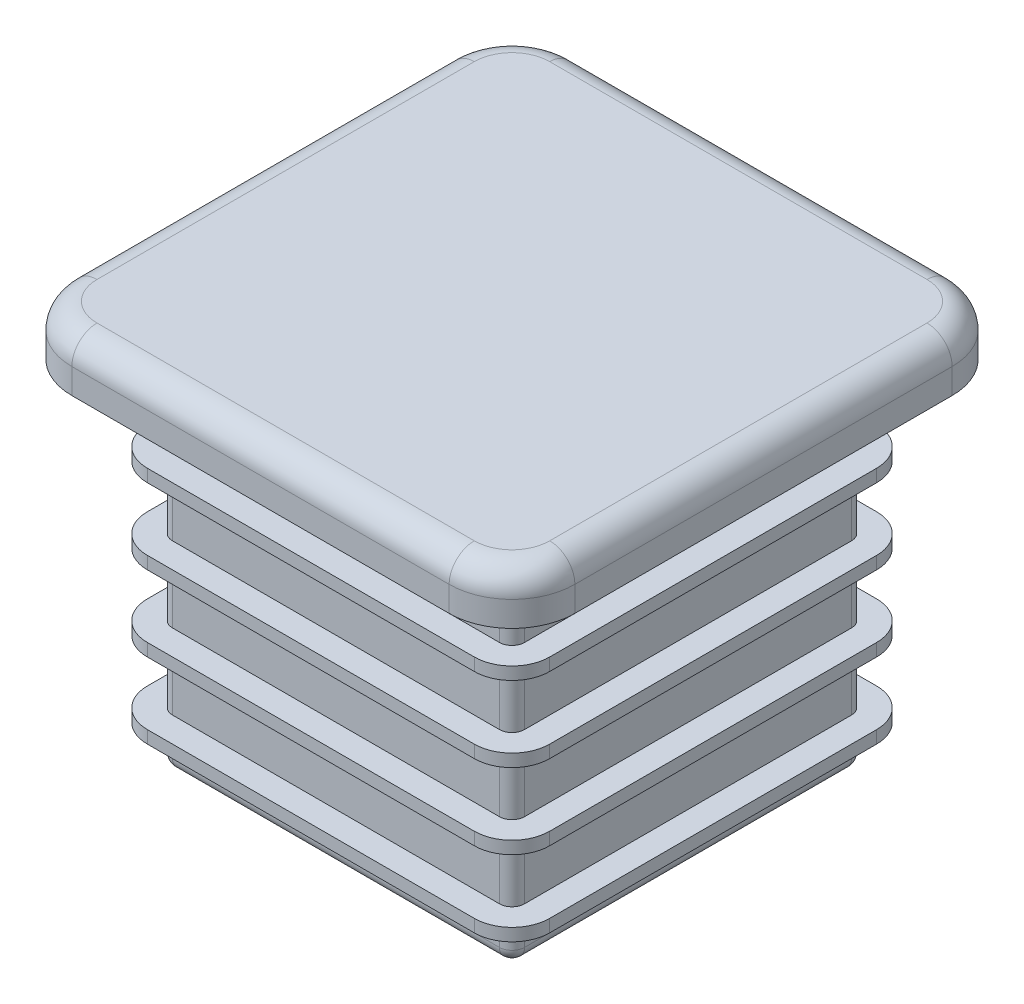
ISO-10303-21;
HEADER;
FILE_DESCRIPTION(('STEP AP214'),'2;1');
FILE_NAME('part.step','',(''),(''),'','','');
FILE_SCHEMA(('AUTOMOTIVE_DESIGN { 1 0 10303 214 1 1 1 1 }'));
ENDSEC;
DATA;
#1=APPLICATION_CONTEXT('core data for automotive mechanical design processes');
#2=APPLICATION_PROTOCOL_DEFINITION('international standard','automotive_design',2000,#1);
#3=PRODUCT_CONTEXT('',#1,'mechanical');
#4=PRODUCT('Part','Part','',(#3));
#5=PRODUCT_RELATED_PRODUCT_CATEGORY('part','',(#4));
#6=PRODUCT_DEFINITION_FORMATION('','',#4);
#7=PRODUCT_DEFINITION_CONTEXT('part definition',#1,'design');
#8=PRODUCT_DEFINITION('design','',#6,#7);
#9=PRODUCT_DEFINITION_SHAPE('','',#8);
#10=(LENGTH_UNIT() NAMED_UNIT(*) SI_UNIT(.MILLI.,.METRE.));
#11=(NAMED_UNIT(*) PLANE_ANGLE_UNIT() SI_UNIT($,.RADIAN.));
#12=(NAMED_UNIT(*) SI_UNIT($,.STERADIAN.) SOLID_ANGLE_UNIT());
#13=UNCERTAINTY_MEASURE_WITH_UNIT(LENGTH_MEASURE(1.E-05),#10,'distance_accuracy_value','');
#14=(GEOMETRIC_REPRESENTATION_CONTEXT(3) GLOBAL_UNCERTAINTY_ASSIGNED_CONTEXT((#13)) GLOBAL_UNIT_ASSIGNED_CONTEXT((#10,
#11,#12)) REPRESENTATION_CONTEXT('',''));
#15=CARTESIAN_POINT('',(0.,0.,0.));
#16=DIRECTION('',(0.,0.,1.));
#17=DIRECTION('',(1.,0.,0.));
#18=AXIS2_PLACEMENT_3D('',#15,#16,#17);
#19=CARTESIAN_POINT('',(7.,-14.,7.));
#20=DIRECTION('',(-1.,0.,0.));
#21=DIRECTION('',(0.,0.,1.));
#22=AXIS2_PLACEMENT_3D('',#19,#20,#21);
#23=PLANE('',#22);
#24=DIRECTION('',(0.,0.,1.));
#25=VECTOR('',#24,1.);
#26=CARTESIAN_POINT('',(7.,-12.,-6.5));
#27=LINE('',#26,#25);
#28=CARTESIAN_POINT('',(7.,-12.,-6.5));
#29=VERTEX_POINT('',#28);
#30=CARTESIAN_POINT('',(7.,-12.,6.5));
#31=VERTEX_POINT('',#30);
#32=EDGE_CURVE('E661',#29,#31,#27,.T.);
#33=ORIENTED_EDGE('',*,*,#32,.F.);
#34=DIRECTION('',(0.,1.,0.));
#35=VECTOR('',#34,1.);
#36=CARTESIAN_POINT('',(7.,-14.,-6.5));
#37=LINE('',#36,#35);
#38=CARTESIAN_POINT('',(7.,-9.5,-6.5));
#39=VERTEX_POINT('',#38);
#40=EDGE_CURVE('E1187',#29,#39,#37,.T.);
#41=ORIENTED_EDGE('',*,*,#40,.T.);
#42=DIRECTION('',(0.,0.,1.));
#43=VECTOR('',#42,1.);
#44=CARTESIAN_POINT('',(7.,-9.5,-6.5));
#45=LINE('',#44,#43);
#46=CARTESIAN_POINT('',(7.,-9.5,6.5));
#47=VERTEX_POINT('',#46);
#48=EDGE_CURVE('E742',#39,#47,#45,.T.);
#49=ORIENTED_EDGE('',*,*,#48,.T.);
#50=DIRECTION('',(0.,1.,0.));
#51=VECTOR('',#50,1.);
#52=CARTESIAN_POINT('',(7.,-14.,6.5));
#53=LINE('',#52,#51);
#54=EDGE_CURVE('E1453',#47,#31,#53,.F.);
#55=ORIENTED_EDGE('',*,*,#54,.T.);
#56=EDGE_LOOP('',(#33,#41,#49,#55));
#57=FACE_BOUND('',#56,.T.);
#58=ADVANCED_FACE('F58',(#57),#23,.F.);
#59=CARTESIAN_POINT('',(-7.,-14.,7.));
#60=DIRECTION('',(0.,0.,-1.));
#61=DIRECTION('',(-1.,0.,0.));
#62=AXIS2_PLACEMENT_3D('',#59,#60,#61);
#63=PLANE('',#62);
#64=DIRECTION('',(-1.,0.,0.));
#65=VECTOR('',#64,1.);
#66=CARTESIAN_POINT('',(6.5,-12.,7.));
#67=LINE('',#66,#65);
#68=CARTESIAN_POINT('',(6.5,-12.,7.));
#69=VERTEX_POINT('',#68);
#70=CARTESIAN_POINT('',(-6.5,-12.,7.));
#71=VERTEX_POINT('',#70);
#72=EDGE_CURVE('E665',#69,#71,#67,.T.);
#73=ORIENTED_EDGE('',*,*,#72,.F.);
#74=DIRECTION('',(0.,1.,0.));
#75=VECTOR('',#74,1.);
#76=CARTESIAN_POINT('',(6.5,-14.,7.));
#77=LINE('',#76,#75);
#78=CARTESIAN_POINT('',(6.5,-9.5,7.));
#79=VERTEX_POINT('',#78);
#80=EDGE_CURVE('E1174',#69,#79,#77,.T.);
#81=ORIENTED_EDGE('',*,*,#80,.T.);
#82=DIRECTION('',(-1.,0.,0.));
#83=VECTOR('',#82,1.);
#84=CARTESIAN_POINT('',(6.5,-9.5,7.));
#85=LINE('',#84,#83);
#86=CARTESIAN_POINT('',(-6.5,-9.5,7.));
#87=VERTEX_POINT('',#86);
#88=EDGE_CURVE('E748',#79,#87,#85,.T.);
#89=ORIENTED_EDGE('',*,*,#88,.T.);
#90=DIRECTION('',(0.,1.,0.));
#91=VECTOR('',#90,1.);
#92=CARTESIAN_POINT('',(-6.5,-14.,7.));
#93=LINE('',#92,#91);
#94=EDGE_CURVE('E1482',#87,#71,#93,.F.);
#95=ORIENTED_EDGE('',*,*,#94,.T.);
#96=EDGE_LOOP('',(#73,#81,#89,#95));
#97=FACE_BOUND('',#96,.T.);
#98=ADVANCED_FACE('F1301',(#97),#63,.F.);
#99=CARTESIAN_POINT('',(6.5,-14.,6.5));
#100=DIRECTION('',(0.,1.,0.));
#101=DIRECTION('',(0.,0.,1.));
#102=AXIS2_PLACEMENT_3D('',#99,#100,#101);
#103=CYLINDRICAL_SURFACE('',#102,0.5);
#104=ORIENTED_EDGE('',*,*,#80,.F.);
#105=CARTESIAN_POINT('',(6.5,-12.,6.5));
#106=DIRECTION('',(0.,-1.,0.));
#107=DIRECTION('',(0.,0.,-1.));
#108=AXIS2_PLACEMENT_3D('',#105,#106,#107);
#109=CIRCLE('',#108,0.5);
#110=EDGE_CURVE('E663',#31,#69,#109,.T.);
#111=ORIENTED_EDGE('',*,*,#110,.F.);
#112=ORIENTED_EDGE('',*,*,#54,.F.);
#113=CARTESIAN_POINT('',(6.5,-9.5,6.5));
#114=DIRECTION('',(0.,-1.,0.));
#115=DIRECTION('',(0.,0.,-1.));
#116=AXIS2_PLACEMENT_3D('',#113,#114,#115);
#117=CIRCLE('',#116,0.5);
#118=EDGE_CURVE('E745',#47,#79,#117,.T.);
#119=ORIENTED_EDGE('',*,*,#118,.T.);
#120=EDGE_LOOP('',(#104,#111,#112,#119));
#121=FACE_BOUND('',#120,.T.);
#122=ADVANCED_FACE('F1309',(#121),#103,.T.);
#123=CARTESIAN_POINT('',(-7.,-14.,7.));
#124=DIRECTION('',(1.,0.,0.));
#125=DIRECTION('',(0.,0.,-1.));
#126=AXIS2_PLACEMENT_3D('',#123,#124,#125);
#127=PLANE('',#126);
#128=DIRECTION('',(0.,0.,-1.));
#129=VECTOR('',#128,1.);
#130=CARTESIAN_POINT('',(-7.,-12.,6.5));
#131=LINE('',#130,#129);
#132=CARTESIAN_POINT('',(-7.,-12.,6.5));
#133=VERTEX_POINT('',#132);
#134=CARTESIAN_POINT('',(-7.,-12.,-6.5));
#135=VERTEX_POINT('',#134);
#136=EDGE_CURVE('E653',#133,#135,#131,.T.);
#137=ORIENTED_EDGE('',*,*,#136,.F.);
#138=DIRECTION('',(0.,1.,0.));
#139=VECTOR('',#138,1.);
#140=CARTESIAN_POINT('',(-7.,-14.,6.5));
#141=LINE('',#140,#139);
#142=CARTESIAN_POINT('',(-7.,-9.5,6.5));
#143=VERTEX_POINT('',#142);
#144=EDGE_CURVE('E1170',#133,#143,#141,.T.);
#145=ORIENTED_EDGE('',*,*,#144,.T.);
#146=DIRECTION('',(0.,0.,-1.));
#147=VECTOR('',#146,1.);
#148=CARTESIAN_POINT('',(-7.,-9.5,6.5));
#149=LINE('',#148,#147);
#150=CARTESIAN_POINT('',(-7.,-9.5,-6.5));
#151=VERTEX_POINT('',#150);
#152=EDGE_CURVE('E729',#143,#151,#149,.T.);
#153=ORIENTED_EDGE('',*,*,#152,.T.);
#154=DIRECTION('',(0.,1.,0.));
#155=VECTOR('',#154,1.);
#156=CARTESIAN_POINT('',(-7.,-14.,-6.5));
#157=LINE('',#156,#155);
#158=EDGE_CURVE('E1420',#151,#135,#157,.F.);
#159=ORIENTED_EDGE('',*,*,#158,.T.);
#160=EDGE_LOOP('',(#137,#145,#153,#159));
#161=FACE_BOUND('',#160,.T.);
#162=ADVANCED_FACE('F1493',(#161),#127,.F.);
#163=CARTESIAN_POINT('',(-6.5,-14.,6.5));
#164=DIRECTION('',(0.,1.,0.));
#165=DIRECTION('',(0.,0.,1.));
#166=AXIS2_PLACEMENT_3D('',#163,#164,#165);
#167=CYLINDRICAL_SURFACE('',#166,0.5);
#168=ORIENTED_EDGE('',*,*,#144,.F.);
#169=CARTESIAN_POINT('',(-6.5,-12.,6.5));
#170=DIRECTION('',(0.,-1.,0.));
#171=DIRECTION('',(0.,0.,-1.));
#172=AXIS2_PLACEMENT_3D('',#169,#170,#171);
#173=CIRCLE('',#172,0.5);
#174=EDGE_CURVE('E651',#71,#133,#173,.T.);
#175=ORIENTED_EDGE('',*,*,#174,.F.);
#176=ORIENTED_EDGE('',*,*,#94,.F.);
#177=CARTESIAN_POINT('',(-6.5,-9.5,6.5));
#178=DIRECTION('',(0.,-1.,0.));
#179=DIRECTION('',(0.,0.,-1.));
#180=AXIS2_PLACEMENT_3D('',#177,#178,#179);
#181=CIRCLE('',#180,0.5);
#182=EDGE_CURVE('E726',#87,#143,#181,.T.);
#183=ORIENTED_EDGE('',*,*,#182,.T.);
#184=EDGE_LOOP('',(#168,#175,#176,#183));
#185=FACE_BOUND('',#184,.T.);
#186=ADVANCED_FACE('F1492',(#185),#167,.T.);
#187=CARTESIAN_POINT('',(-7.,-14.,-7.));
#188=DIRECTION('',(0.,0.,1.));
#189=DIRECTION('',(1.,0.,0.));
#190=AXIS2_PLACEMENT_3D('',#187,#188,#189);
#191=PLANE('',#190);
#192=DIRECTION('',(1.,0.,0.));
#193=VECTOR('',#192,1.);
#194=CARTESIAN_POINT('',(-6.5,-12.,-7.));
#195=LINE('',#194,#193);
#196=CARTESIAN_POINT('',(-6.5,-12.,-7.));
#197=VERTEX_POINT('',#196);
#198=CARTESIAN_POINT('',(6.5,-12.,-7.));
#199=VERTEX_POINT('',#198);
#200=EDGE_CURVE('E657',#197,#199,#195,.T.);
#201=ORIENTED_EDGE('',*,*,#200,.F.);
#202=DIRECTION('',(0.,1.,0.));
#203=VECTOR('',#202,1.);
#204=CARTESIAN_POINT('',(-6.5,-14.,-7.));
#205=LINE('',#204,#203);
#206=CARTESIAN_POINT('',(-6.5,-9.5,-7.));
#207=VERTEX_POINT('',#206);
#208=EDGE_CURVE('E1183',#197,#207,#205,.T.);
#209=ORIENTED_EDGE('',*,*,#208,.T.);
#210=DIRECTION('',(1.,0.,0.));
#211=VECTOR('',#210,1.);
#212=CARTESIAN_POINT('',(-6.5,-9.5,-7.));
#213=LINE('',#212,#211);
#214=CARTESIAN_POINT('',(6.5,-9.5,-7.));
#215=VERTEX_POINT('',#214);
#216=EDGE_CURVE('E736',#207,#215,#213,.T.);
#217=ORIENTED_EDGE('',*,*,#216,.T.);
#218=DIRECTION('',(0.,1.,0.));
#219=VECTOR('',#218,1.);
#220=CARTESIAN_POINT('',(6.5,-14.,-7.));
#221=LINE('',#220,#219);
#222=EDGE_CURVE('E627',#215,#199,#221,.F.);
#223=ORIENTED_EDGE('',*,*,#222,.T.);
#224=EDGE_LOOP('',(#201,#209,#217,#223));
#225=FACE_BOUND('',#224,.T.);
#226=ADVANCED_FACE('F1408',(#225),#191,.F.);
#227=CARTESIAN_POINT('',(-6.5,-14.,-6.5));
#228=DIRECTION('',(0.,1.,0.));
#229=DIRECTION('',(0.,0.,1.));
#230=AXIS2_PLACEMENT_3D('',#227,#228,#229);
#231=CYLINDRICAL_SURFACE('',#230,0.5);
#232=ORIENTED_EDGE('',*,*,#208,.F.);
#233=CARTESIAN_POINT('',(-6.5,-12.,-6.5));
#234=DIRECTION('',(0.,-1.,0.));
#235=DIRECTION('',(0.,0.,-1.));
#236=AXIS2_PLACEMENT_3D('',#233,#234,#235);
#237=CIRCLE('',#236,0.5);
#238=EDGE_CURVE('E655',#135,#197,#237,.T.);
#239=ORIENTED_EDGE('',*,*,#238,.F.);
#240=ORIENTED_EDGE('',*,*,#158,.F.);
#241=CARTESIAN_POINT('',(-6.5,-9.5,-6.5));
#242=DIRECTION('',(0.,-1.,0.));
#243=DIRECTION('',(0.,0.,-1.));
#244=AXIS2_PLACEMENT_3D('',#241,#242,#243);
#245=CIRCLE('',#244,0.5);
#246=EDGE_CURVE('E733',#151,#207,#245,.T.);
#247=ORIENTED_EDGE('',*,*,#246,.T.);
#248=EDGE_LOOP('',(#232,#239,#240,#247));
#249=FACE_BOUND('',#248,.T.);
#250=ADVANCED_FACE('F1418',(#249),#231,.T.);
#251=CARTESIAN_POINT('',(6.5,-14.,-6.5));
#252=DIRECTION('',(0.,1.,0.));
#253=DIRECTION('',(0.,0.,1.));
#254=AXIS2_PLACEMENT_3D('',#251,#252,#253);
#255=CYLINDRICAL_SURFACE('',#254,0.5);
#256=ORIENTED_EDGE('',*,*,#40,.F.);
#257=CARTESIAN_POINT('',(6.5,-12.,-6.5));
#258=DIRECTION('',(0.,-1.,0.));
#259=DIRECTION('',(0.,0.,-1.));
#260=AXIS2_PLACEMENT_3D('',#257,#258,#259);
#261=CIRCLE('',#260,0.5);
#262=EDGE_CURVE('E659',#199,#29,#261,.T.);
#263=ORIENTED_EDGE('',*,*,#262,.F.);
#264=ORIENTED_EDGE('',*,*,#222,.F.);
#265=CARTESIAN_POINT('',(6.5,-9.5,-6.5));
#266=DIRECTION('',(0.,-1.,0.));
#267=DIRECTION('',(0.,0.,-1.));
#268=AXIS2_PLACEMENT_3D('',#265,#266,#267);
#269=CIRCLE('',#268,0.5);
#270=EDGE_CURVE('E739',#215,#39,#269,.T.);
#271=ORIENTED_EDGE('',*,*,#270,.T.);
#272=EDGE_LOOP('',(#256,#263,#264,#271));
#273=FACE_BOUND('',#272,.T.);
#274=ADVANCED_FACE('F1447',(#273),#255,.T.);
#275=CARTESIAN_POINT('',(7.,-9.,-6.5));
#276=VERTEX_POINT('',#275);
#277=CARTESIAN_POINT('',(7.,-6.5,-6.5));
#278=VERTEX_POINT('',#277);
#279=EDGE_CURVE('E1358',#276,#278,#37,.T.);
#280=ORIENTED_EDGE('',*,*,#279,.F.);
#281=CARTESIAN_POINT('',(6.5,-9.,-6.5));
#282=DIRECTION('',(0.,-1.,0.));
#283=DIRECTION('',(0.,0.,-1.));
#284=AXIS2_PLACEMENT_3D('',#281,#282,#283);
#285=CIRCLE('',#284,0.5);
#286=CARTESIAN_POINT('',(6.5,-9.,-7.));
#287=VERTEX_POINT('',#286);
#288=EDGE_CURVE('E763',#287,#276,#285,.T.);
#289=ORIENTED_EDGE('',*,*,#288,.F.);
#290=CARTESIAN_POINT('',(6.5,-6.5,-7.));
#291=VERTEX_POINT('',#290);
#292=EDGE_CURVE('E1442',#291,#287,#221,.F.);
#293=ORIENTED_EDGE('',*,*,#292,.F.);
#294=CARTESIAN_POINT('',(6.5,-6.5,-6.5));
#295=DIRECTION('',(0.,-1.,0.));
#296=DIRECTION('',(0.,0.,-1.));
#297=AXIS2_PLACEMENT_3D('',#294,#295,#296);
#298=CIRCLE('',#297,0.5);
#299=EDGE_CURVE('E844',#291,#278,#298,.T.);
#300=ORIENTED_EDGE('',*,*,#299,.T.);
#301=EDGE_LOOP('',(#280,#289,#293,#300));
#302=FACE_BOUND('',#301,.T.);
#303=ADVANCED_FACE('F1468',(#302),#255,.T.);
#304=CARTESIAN_POINT('',(-6.5,-9.,-7.));
#305=VERTEX_POINT('',#304);
#306=CARTESIAN_POINT('',(-6.5,-6.5,-7.));
#307=VERTEX_POINT('',#306);
#308=EDGE_CURVE('E1398',#305,#307,#205,.T.);
#309=ORIENTED_EDGE('',*,*,#308,.F.);
#310=CARTESIAN_POINT('',(-6.5,-9.,-6.5));
#311=DIRECTION('',(0.,-1.,0.));
#312=DIRECTION('',(0.,0.,-1.));
#313=AXIS2_PLACEMENT_3D('',#310,#311,#312);
#314=CIRCLE('',#313,0.5);
#315=CARTESIAN_POINT('',(-7.,-9.,-6.5));
#316=VERTEX_POINT('',#315);
#317=EDGE_CURVE('E757',#316,#305,#314,.T.);
#318=ORIENTED_EDGE('',*,*,#317,.F.);
#319=CARTESIAN_POINT('',(-7.,-6.5,-6.5));
#320=VERTEX_POINT('',#319);
#321=EDGE_CURVE('E1423',#320,#316,#157,.F.);
#322=ORIENTED_EDGE('',*,*,#321,.F.);
#323=CARTESIAN_POINT('',(-6.5,-6.5,-6.5));
#324=DIRECTION('',(0.,-1.,0.));
#325=DIRECTION('',(0.,0.,-1.));
#326=AXIS2_PLACEMENT_3D('',#323,#324,#325);
#327=CIRCLE('',#326,0.5);
#328=EDGE_CURVE('E838',#320,#307,#327,.T.);
#329=ORIENTED_EDGE('',*,*,#328,.T.);
#330=EDGE_LOOP('',(#309,#318,#322,#329));
#331=FACE_BOUND('',#330,.T.);
#332=ADVANCED_FACE('F1634',(#331),#231,.T.);
#333=DIRECTION('',(1.,0.,0.));
#334=VECTOR('',#333,1.);
#335=CARTESIAN_POINT('',(-6.5,-9.,-7.));
#336=LINE('',#335,#334);
#337=EDGE_CURVE('E760',#305,#287,#336,.T.);
#338=ORIENTED_EDGE('',*,*,#337,.F.);
#339=ORIENTED_EDGE('',*,*,#308,.T.);
#340=DIRECTION('',(1.,0.,0.));
#341=VECTOR('',#340,1.);
#342=CARTESIAN_POINT('',(-6.5,-6.5,-7.));
#343=LINE('',#342,#341);
#344=EDGE_CURVE('E841',#307,#291,#343,.T.);
#345=ORIENTED_EDGE('',*,*,#344,.T.);
#346=ORIENTED_EDGE('',*,*,#292,.T.);
#347=EDGE_LOOP('',(#338,#339,#345,#346));
#348=FACE_BOUND('',#347,.T.);
#349=ADVANCED_FACE('F1627',(#348),#191,.F.);
#350=CARTESIAN_POINT('',(-7.,-9.,6.5));
#351=VERTEX_POINT('',#350);
#352=CARTESIAN_POINT('',(-7.,-6.5,6.5));
#353=VERTEX_POINT('',#352);
#354=EDGE_CURVE('E1494',#351,#353,#141,.T.);
#355=ORIENTED_EDGE('',*,*,#354,.F.);
#356=CARTESIAN_POINT('',(-6.5,-9.,6.5));
#357=DIRECTION('',(0.,-1.,0.));
#358=DIRECTION('',(0.,0.,-1.));
#359=AXIS2_PLACEMENT_3D('',#356,#357,#358);
#360=CIRCLE('',#359,0.5);
#361=CARTESIAN_POINT('',(-6.5,-9.,7.));
#362=VERTEX_POINT('',#361);
#363=EDGE_CURVE('E725',#362,#351,#360,.T.);
#364=ORIENTED_EDGE('',*,*,#363,.F.);
#365=CARTESIAN_POINT('',(-6.5,-6.5,7.));
#366=VERTEX_POINT('',#365);
#367=EDGE_CURVE('E1478',#366,#362,#93,.F.);
#368=ORIENTED_EDGE('',*,*,#367,.F.);
#369=CARTESIAN_POINT('',(-6.5,-6.5,6.5));
#370=DIRECTION('',(0.,-1.,0.));
#371=DIRECTION('',(0.,0.,-1.));
#372=AXIS2_PLACEMENT_3D('',#369,#370,#371);
#373=CIRCLE('',#372,0.5);
#374=EDGE_CURVE('E832',#366,#353,#373,.T.);
#375=ORIENTED_EDGE('',*,*,#374,.T.);
#376=EDGE_LOOP('',(#355,#364,#368,#375));
#377=FACE_BOUND('',#376,.T.);
#378=ADVANCED_FACE('F1481',(#377),#167,.T.);
#379=DIRECTION('',(0.,0.,-1.));
#380=VECTOR('',#379,1.);
#381=CARTESIAN_POINT('',(-7.,-9.,6.5));
#382=LINE('',#381,#380);
#383=EDGE_CURVE('E754',#351,#316,#382,.T.);
#384=ORIENTED_EDGE('',*,*,#383,.F.);
#385=ORIENTED_EDGE('',*,*,#354,.T.);
#386=DIRECTION('',(0.,0.,-1.));
#387=VECTOR('',#386,1.);
#388=CARTESIAN_POINT('',(-7.,-6.5,6.5));
#389=LINE('',#388,#387);
#390=EDGE_CURVE('E835',#353,#320,#389,.T.);
#391=ORIENTED_EDGE('',*,*,#390,.T.);
#392=ORIENTED_EDGE('',*,*,#321,.T.);
#393=EDGE_LOOP('',(#384,#385,#391,#392));
#394=FACE_BOUND('',#393,.T.);
#395=ADVANCED_FACE('F1617',(#394),#127,.F.);
#396=CARTESIAN_POINT('',(6.5,-9.,7.));
#397=VERTEX_POINT('',#396);
#398=CARTESIAN_POINT('',(6.5,-6.5,7.));
#399=VERTEX_POINT('',#398);
#400=EDGE_CURVE('E1464',#397,#399,#77,.T.);
#401=ORIENTED_EDGE('',*,*,#400,.F.);
#402=CARTESIAN_POINT('',(6.5,-9.,6.5));
#403=DIRECTION('',(0.,-1.,0.));
#404=DIRECTION('',(0.,0.,-1.));
#405=AXIS2_PLACEMENT_3D('',#402,#403,#404);
#406=CIRCLE('',#405,0.5);
#407=CARTESIAN_POINT('',(7.,-9.,6.5));
#408=VERTEX_POINT('',#407);
#409=EDGE_CURVE('E769',#408,#397,#406,.T.);
#410=ORIENTED_EDGE('',*,*,#409,.F.);
#411=CARTESIAN_POINT('',(7.,-6.5,6.5));
#412=VERTEX_POINT('',#411);
#413=EDGE_CURVE('E1455',#412,#408,#53,.F.);
#414=ORIENTED_EDGE('',*,*,#413,.F.);
#415=CARTESIAN_POINT('',(6.5,-6.5,6.5));
#416=DIRECTION('',(0.,-1.,0.));
#417=DIRECTION('',(0.,0.,-1.));
#418=AXIS2_PLACEMENT_3D('',#415,#416,#417);
#419=CIRCLE('',#418,0.5);
#420=EDGE_CURVE('E849',#412,#399,#419,.T.);
#421=ORIENTED_EDGE('',*,*,#420,.T.);
#422=EDGE_LOOP('',(#401,#410,#414,#421));
#423=FACE_BOUND('',#422,.T.);
#424=ADVANCED_FACE('F1463',(#423),#103,.T.);
#425=DIRECTION('',(-1.,0.,0.));
#426=VECTOR('',#425,1.);
#427=CARTESIAN_POINT('',(6.5,-9.,7.));
#428=LINE('',#427,#426);
#429=EDGE_CURVE('E730',#397,#362,#428,.T.);
#430=ORIENTED_EDGE('',*,*,#429,.F.);
#431=ORIENTED_EDGE('',*,*,#400,.T.);
#432=DIRECTION('',(-1.,0.,0.));
#433=VECTOR('',#432,1.);
#434=CARTESIAN_POINT('',(6.5,-6.5,7.));
#435=LINE('',#434,#433);
#436=EDGE_CURVE('E852',#399,#366,#435,.T.);
#437=ORIENTED_EDGE('',*,*,#436,.T.);
#438=ORIENTED_EDGE('',*,*,#367,.T.);
#439=EDGE_LOOP('',(#430,#431,#437,#438));
#440=FACE_BOUND('',#439,.T.);
#441=ADVANCED_FACE('F1312',(#440),#63,.F.);
#442=DIRECTION('',(0.,0.,1.));
#443=VECTOR('',#442,1.);
#444=CARTESIAN_POINT('',(7.,-9.,-6.5));
#445=LINE('',#444,#443);
#446=EDGE_CURVE('E766',#276,#408,#445,.T.);
#447=ORIENTED_EDGE('',*,*,#446,.F.);
#448=ORIENTED_EDGE('',*,*,#279,.T.);
#449=DIRECTION('',(0.,0.,1.));
#450=VECTOR('',#449,1.);
#451=CARTESIAN_POINT('',(7.,-6.5,-6.5));
#452=LINE('',#451,#450);
#453=EDGE_CURVE('E847',#278,#412,#452,.T.);
#454=ORIENTED_EDGE('',*,*,#453,.T.);
#455=ORIENTED_EDGE('',*,*,#413,.T.);
#456=EDGE_LOOP('',(#447,#448,#454,#455));
#457=FACE_BOUND('',#456,.T.);
#458=ADVANCED_FACE('F1304',(#457),#23,.F.);
#459=DIRECTION('',(0.,0.,1.));
#460=VECTOR('',#459,1.);
#461=CARTESIAN_POINT('',(7.,-6.,-6.5));
#462=LINE('',#461,#460);
#463=CARTESIAN_POINT('',(7.,-6.,-6.5));
#464=VERTEX_POINT('',#463);
#465=CARTESIAN_POINT('',(7.,-6.,6.5));
#466=VERTEX_POINT('',#465);
#467=EDGE_CURVE('E864',#464,#466,#462,.T.);
#468=ORIENTED_EDGE('',*,*,#467,.F.);
#469=CARTESIAN_POINT('',(7.,-3.5,-6.5));
#470=VERTEX_POINT('',#469);
#471=EDGE_CURVE('E1348',#464,#470,#37,.T.);
#472=ORIENTED_EDGE('',*,*,#471,.T.);
#473=DIRECTION('',(0.,0.,1.));
#474=VECTOR('',#473,1.);
#475=CARTESIAN_POINT('',(7.,-3.5,-6.5));
#476=LINE('',#475,#474);
#477=CARTESIAN_POINT('',(7.,-3.5,6.5));
#478=VERTEX_POINT('',#477);
#479=EDGE_CURVE('E942',#470,#478,#476,.T.);
#480=ORIENTED_EDGE('',*,*,#479,.T.);
#481=EDGE_CURVE('E1192',#478,#466,#53,.F.);
#482=ORIENTED_EDGE('',*,*,#481,.T.);
#483=EDGE_LOOP('',(#468,#472,#480,#482));
#484=FACE_BOUND('',#483,.T.);
#485=ADVANCED_FACE('F1316',(#484),#23,.F.);
#486=DIRECTION('',(-1.,0.,0.));
#487=VECTOR('',#486,1.);
#488=CARTESIAN_POINT('',(6.5,-6.,7.));
#489=LINE('',#488,#487);
#490=CARTESIAN_POINT('',(6.5,-6.,7.));
#491=VERTEX_POINT('',#490);
#492=CARTESIAN_POINT('',(-6.5,-6.,7.));
#493=VERTEX_POINT('',#492);
#494=EDGE_CURVE('E836',#491,#493,#489,.T.);
#495=ORIENTED_EDGE('',*,*,#494,.F.);
#496=CARTESIAN_POINT('',(6.5,-3.5,7.));
#497=VERTEX_POINT('',#496);
#498=EDGE_CURVE('E1495',#491,#497,#77,.T.);
#499=ORIENTED_EDGE('',*,*,#498,.T.);
#500=DIRECTION('',(-1.,0.,0.));
#501=VECTOR('',#500,1.);
#502=CARTESIAN_POINT('',(6.5,-3.5,7.));
#503=LINE('',#502,#501);
#504=CARTESIAN_POINT('',(-6.5,-3.5,7.));
#505=VERTEX_POINT('',#504);
#506=EDGE_CURVE('E947',#497,#505,#503,.T.);
#507=ORIENTED_EDGE('',*,*,#506,.T.);
#508=EDGE_CURVE('E1176',#505,#493,#93,.F.);
#509=ORIENTED_EDGE('',*,*,#508,.T.);
#510=EDGE_LOOP('',(#495,#499,#507,#509));
#511=FACE_BOUND('',#510,.T.);
#512=ADVANCED_FACE('F1336',(#511),#63,.F.);
#513=DIRECTION('',(0.,0.,-1.));
#514=VECTOR('',#513,1.);
#515=CARTESIAN_POINT('',(-7.,-6.,6.5));
#516=LINE('',#515,#514);
#517=CARTESIAN_POINT('',(-7.,-6.,6.5));
#518=VERTEX_POINT('',#517);
#519=CARTESIAN_POINT('',(-7.,-6.,-6.5));
#520=VERTEX_POINT('',#519);
#521=EDGE_CURVE('E856',#518,#520,#516,.T.);
#522=ORIENTED_EDGE('',*,*,#521,.F.);
#523=CARTESIAN_POINT('',(-7.,-3.5,6.5));
#524=VERTEX_POINT('',#523);
#525=EDGE_CURVE('E1506',#518,#524,#141,.T.);
#526=ORIENTED_EDGE('',*,*,#525,.T.);
#527=DIRECTION('',(0.,0.,-1.));
#528=VECTOR('',#527,1.);
#529=CARTESIAN_POINT('',(-7.,-3.5,6.5));
#530=LINE('',#529,#528);
#531=CARTESIAN_POINT('',(-7.,-3.5,-6.5));
#532=VERTEX_POINT('',#531);
#533=EDGE_CURVE('E930',#524,#532,#530,.T.);
#534=ORIENTED_EDGE('',*,*,#533,.T.);
#535=EDGE_CURVE('E1165',#532,#520,#157,.F.);
#536=ORIENTED_EDGE('',*,*,#535,.T.);
#537=EDGE_LOOP('',(#522,#526,#534,#536));
#538=FACE_BOUND('',#537,.T.);
#539=ADVANCED_FACE('F1343',(#538),#127,.F.);
#540=DIRECTION('',(1.,0.,0.));
#541=VECTOR('',#540,1.);
#542=CARTESIAN_POINT('',(-6.5,-6.,-7.));
#543=LINE('',#542,#541);
#544=CARTESIAN_POINT('',(-6.5,-6.,-7.));
#545=VERTEX_POINT('',#544);
#546=CARTESIAN_POINT('',(6.5,-6.,-7.));
#547=VERTEX_POINT('',#546);
#548=EDGE_CURVE('E860',#545,#547,#543,.T.);
#549=ORIENTED_EDGE('',*,*,#548,.F.);
#550=CARTESIAN_POINT('',(-6.5,-3.5,-7.));
#551=VERTEX_POINT('',#550);
#552=EDGE_CURVE('E1397',#545,#551,#205,.T.);
#553=ORIENTED_EDGE('',*,*,#552,.T.);
#554=DIRECTION('',(1.,0.,0.));
#555=VECTOR('',#554,1.);
#556=CARTESIAN_POINT('',(-6.5,-3.5,-7.));
#557=LINE('',#556,#555);
#558=CARTESIAN_POINT('',(6.5,-3.5,-7.));
#559=VERTEX_POINT('',#558);
#560=EDGE_CURVE('E936',#551,#559,#557,.T.);
#561=ORIENTED_EDGE('',*,*,#560,.T.);
#562=EDGE_CURVE('E1180',#559,#547,#221,.F.);
#563=ORIENTED_EDGE('',*,*,#562,.T.);
#564=EDGE_LOOP('',(#549,#553,#561,#563));
#565=FACE_BOUND('',#564,.T.);
#566=ADVANCED_FACE('F1441',(#565),#191,.F.);
#567=ORIENTED_EDGE('',*,*,#525,.F.);
#568=CARTESIAN_POINT('',(-6.5,-6.,6.5));
#569=DIRECTION('',(0.,-1.,0.));
#570=DIRECTION('',(0.,0.,-1.));
#571=AXIS2_PLACEMENT_3D('',#568,#569,#570);
#572=CIRCLE('',#571,0.5);
#573=EDGE_CURVE('E831',#493,#518,#572,.T.);
#574=ORIENTED_EDGE('',*,*,#573,.F.);
#575=ORIENTED_EDGE('',*,*,#508,.F.);
#576=CARTESIAN_POINT('',(-6.5,-3.5,6.5));
#577=DIRECTION('',(0.,-1.,0.));
#578=DIRECTION('',(0.,0.,-1.));
#579=AXIS2_PLACEMENT_3D('',#576,#577,#578);
#580=CIRCLE('',#579,0.5);
#581=EDGE_CURVE('E927',#505,#524,#580,.T.);
#582=ORIENTED_EDGE('',*,*,#581,.T.);
#583=EDGE_LOOP('',(#567,#574,#575,#582));
#584=FACE_BOUND('',#583,.T.);
#585=ADVANCED_FACE('F1504',(#584),#167,.T.);
#586=ORIENTED_EDGE('',*,*,#552,.F.);
#587=CARTESIAN_POINT('',(-6.5,-6.,-6.5));
#588=DIRECTION('',(0.,-1.,0.));
#589=DIRECTION('',(0.,0.,-1.));
#590=AXIS2_PLACEMENT_3D('',#587,#588,#589);
#591=CIRCLE('',#590,0.5);
#592=EDGE_CURVE('E858',#520,#545,#591,.T.);
#593=ORIENTED_EDGE('',*,*,#592,.F.);
#594=ORIENTED_EDGE('',*,*,#535,.F.);
#595=CARTESIAN_POINT('',(-6.5,-3.5,-6.5));
#596=DIRECTION('',(0.,-1.,0.));
#597=DIRECTION('',(0.,0.,-1.));
#598=AXIS2_PLACEMENT_3D('',#595,#596,#597);
#599=CIRCLE('',#598,0.5);
#600=EDGE_CURVE('E933',#532,#551,#599,.T.);
#601=ORIENTED_EDGE('',*,*,#600,.T.);
#602=EDGE_LOOP('',(#586,#593,#594,#601));
#603=FACE_BOUND('',#602,.T.);
#604=ADVANCED_FACE('F1436',(#603),#231,.T.);
#605=ORIENTED_EDGE('',*,*,#498,.F.);
#606=CARTESIAN_POINT('',(6.5,-6.,6.5));
#607=DIRECTION('',(0.,-1.,0.));
#608=DIRECTION('',(0.,0.,-1.));
#609=AXIS2_PLACEMENT_3D('',#606,#607,#608);
#610=CIRCLE('',#609,0.5);
#611=EDGE_CURVE('E866',#466,#491,#610,.T.);
#612=ORIENTED_EDGE('',*,*,#611,.F.);
#613=ORIENTED_EDGE('',*,*,#481,.F.);
#614=CARTESIAN_POINT('',(6.5,-3.5,6.5));
#615=DIRECTION('',(0.,-1.,0.));
#616=DIRECTION('',(0.,0.,-1.));
#617=AXIS2_PLACEMENT_3D('',#614,#615,#616);
#618=CIRCLE('',#617,0.5);
#619=EDGE_CURVE('E944',#478,#497,#618,.T.);
#620=ORIENTED_EDGE('',*,*,#619,.T.);
#621=EDGE_LOOP('',(#605,#612,#613,#620));
#622=FACE_BOUND('',#621,.T.);
#623=ADVANCED_FACE('F1502',(#622),#103,.T.);
#624=ORIENTED_EDGE('',*,*,#471,.F.);
#625=CARTESIAN_POINT('',(6.5,-6.,-6.5));
#626=DIRECTION('',(0.,-1.,0.));
#627=DIRECTION('',(0.,0.,-1.));
#628=AXIS2_PLACEMENT_3D('',#625,#626,#627);
#629=CIRCLE('',#628,0.5);
#630=EDGE_CURVE('E862',#547,#464,#629,.T.);
#631=ORIENTED_EDGE('',*,*,#630,.F.);
#632=ORIENTED_EDGE('',*,*,#562,.F.);
#633=CARTESIAN_POINT('',(6.5,-3.5,-6.5));
#634=DIRECTION('',(0.,-1.,0.));
#635=DIRECTION('',(0.,0.,-1.));
#636=AXIS2_PLACEMENT_3D('',#633,#634,#635);
#637=CIRCLE('',#636,0.5);
#638=EDGE_CURVE('E939',#559,#470,#637,.T.);
#639=ORIENTED_EDGE('',*,*,#638,.T.);
#640=EDGE_LOOP('',(#624,#631,#632,#639));
#641=FACE_BOUND('',#640,.T.);
#642=ADVANCED_FACE('F1354',(#641),#255,.T.);
#643=CARTESIAN_POINT('',(-6.5,-3.5,6.5));
#644=DIRECTION('',(0.,-1.,0.));
#645=DIRECTION('',(0.,0.,-1.));
#646=AXIS2_PLACEMENT_3D('',#643,#644,#645);
#647=PLANE('',#646);
#648=CARTESIAN_POINT('',(-6.5,-3.5,6.5));
#649=DIRECTION('',(0.,-1.,0.));
#650=DIRECTION('',(0.,0.,-1.));
#651=AXIS2_PLACEMENT_3D('',#648,#649,#650);
#652=CIRCLE('',#651,1.5);
#653=CARTESIAN_POINT('',(-6.5,-3.5,8.));
#654=VERTEX_POINT('',#653);
#655=CARTESIAN_POINT('',(-8.,-3.5,6.5));
#656=VERTEX_POINT('',#655);
#657=EDGE_CURVE('E964',#654,#656,#652,.T.);
#658=ORIENTED_EDGE('',*,*,#657,.T.);
#659=DIRECTION('',(0.,0.,-1.));
#660=VECTOR('',#659,1.);
#661=CARTESIAN_POINT('',(-8.,-3.5,6.5));
#662=LINE('',#661,#660);
#663=CARTESIAN_POINT('',(-8.,-3.5,-6.5));
#664=VERTEX_POINT('',#663);
#665=EDGE_CURVE('E967',#656,#664,#662,.T.);
#666=ORIENTED_EDGE('',*,*,#665,.T.);
#667=CARTESIAN_POINT('',(-6.5,-3.5,-6.5));
#668=DIRECTION('',(0.,-1.,0.));
#669=DIRECTION('',(0.,0.,-1.));
#670=AXIS2_PLACEMENT_3D('',#667,#668,#669);
#671=CIRCLE('',#670,1.5);
#672=CARTESIAN_POINT('',(-6.5,-3.5,-8.));
#673=VERTEX_POINT('',#672);
#674=EDGE_CURVE('E970',#664,#673,#671,.T.);
#675=ORIENTED_EDGE('',*,*,#674,.T.);
#676=DIRECTION('',(1.,0.,0.));
#677=VECTOR('',#676,1.);
#678=CARTESIAN_POINT('',(-6.5,-3.5,-8.));
#679=LINE('',#678,#677);
#680=CARTESIAN_POINT('',(6.5,-3.5,-8.));
#681=VERTEX_POINT('',#680);
#682=EDGE_CURVE('E972',#673,#681,#679,.T.);
#683=ORIENTED_EDGE('',*,*,#682,.T.);
#684=CARTESIAN_POINT('',(6.5,-3.5,-6.5));
#685=DIRECTION('',(0.,-1.,0.));
#686=DIRECTION('',(0.,0.,-1.));
#687=AXIS2_PLACEMENT_3D('',#684,#685,#686);
#688=CIRCLE('',#687,1.5);
#689=CARTESIAN_POINT('',(8.,-3.5,-6.5));
#690=VERTEX_POINT('',#689);
#691=EDGE_CURVE('E974',#681,#690,#688,.T.);
#692=ORIENTED_EDGE('',*,*,#691,.T.);
#693=DIRECTION('',(0.,0.,1.));
#694=VECTOR('',#693,1.);
#695=CARTESIAN_POINT('',(8.,-3.5,-6.5));
#696=LINE('',#695,#694);
#697=CARTESIAN_POINT('',(8.,-3.5,6.5));
#698=VERTEX_POINT('',#697);
#699=EDGE_CURVE('E976',#690,#698,#696,.T.);
#700=ORIENTED_EDGE('',*,*,#699,.T.);
#701=CARTESIAN_POINT('',(6.5,-3.5,6.5));
#702=DIRECTION('',(0.,-1.,0.));
#703=DIRECTION('',(0.,0.,-1.));
#704=AXIS2_PLACEMENT_3D('',#701,#702,#703);
#705=CIRCLE('',#704,1.5);
#706=CARTESIAN_POINT('',(6.5,-3.5,8.));
#707=VERTEX_POINT('',#706);
#708=EDGE_CURVE('E978',#698,#707,#705,.T.);
#709=ORIENTED_EDGE('',*,*,#708,.T.);
#710=DIRECTION('',(-1.,0.,0.));
#711=VECTOR('',#710,1.);
#712=CARTESIAN_POINT('',(6.5,-3.5,8.));
#713=LINE('',#712,#711);
#714=EDGE_CURVE('E980',#707,#654,#713,.T.);
#715=ORIENTED_EDGE('',*,*,#714,.T.);
#716=EDGE_LOOP('',(#658,#666,#675,#683,#692,#700,#709,#715));
#717=FACE_BOUND('',#716,.T.);
#718=ORIENTED_EDGE('',*,*,#533,.F.);
#719=ORIENTED_EDGE('',*,*,#581,.F.);
#720=ORIENTED_EDGE('',*,*,#506,.F.);
#721=ORIENTED_EDGE('',*,*,#619,.F.);
#722=ORIENTED_EDGE('',*,*,#479,.F.);
#723=ORIENTED_EDGE('',*,*,#638,.F.);
#724=ORIENTED_EDGE('',*,*,#560,.F.);
#725=ORIENTED_EDGE('',*,*,#600,.F.);
#726=EDGE_LOOP('',(#718,#719,#720,#721,#722,#723,#724,#725));
#727=FACE_BOUND('',#726,.T.);
#728=ADVANCED_FACE('F1439',(#717,#727),#647,.T.);
#729=CARTESIAN_POINT('',(-6.5,-3.,6.5));
#730=DIRECTION('',(0.,-1.,0.));
#731=DIRECTION('',(0.,0.,-1.));
#732=AXIS2_PLACEMENT_3D('',#729,#730,#731);
#733=PLANE('',#732);
#734=CARTESIAN_POINT('',(-6.5,-3.,6.5));
#735=DIRECTION('',(0.,-1.,0.));
#736=DIRECTION('',(0.,0.,-1.));
#737=AXIS2_PLACEMENT_3D('',#734,#735,#736);
#738=CIRCLE('',#737,1.5);
#739=CARTESIAN_POINT('',(-6.5,-3.,8.));
#740=VERTEX_POINT('',#739);
#741=CARTESIAN_POINT('',(-8.,-3.,6.5));
#742=VERTEX_POINT('',#741);
#743=EDGE_CURVE('E949',#740,#742,#738,.T.);
#744=ORIENTED_EDGE('',*,*,#743,.F.);
#745=DIRECTION('',(-1.,0.,0.));
#746=VECTOR('',#745,1.);
#747=CARTESIAN_POINT('',(6.5,-3.,8.));
#748=LINE('',#747,#746);
#749=CARTESIAN_POINT('',(6.5,-3.,8.));
#750=VERTEX_POINT('',#749);
#751=EDGE_CURVE('E968',#750,#740,#748,.T.);
#752=ORIENTED_EDGE('',*,*,#751,.F.);
#753=CARTESIAN_POINT('',(6.5,-3.,6.5));
#754=DIRECTION('',(0.,-1.,0.));
#755=DIRECTION('',(0.,0.,-1.));
#756=AXIS2_PLACEMENT_3D('',#753,#754,#755);
#757=CIRCLE('',#756,1.5);
#758=CARTESIAN_POINT('',(8.,-3.,6.5));
#759=VERTEX_POINT('',#758);
#760=EDGE_CURVE('E995',#759,#750,#757,.T.);
#761=ORIENTED_EDGE('',*,*,#760,.F.);
#762=DIRECTION('',(0.,0.,1.));
#763=VECTOR('',#762,1.);
#764=CARTESIAN_POINT('',(8.,-3.,-6.5));
#765=LINE('',#764,#763);
#766=CARTESIAN_POINT('',(8.,-3.,-6.5));
#767=VERTEX_POINT('',#766);
#768=EDGE_CURVE('E993',#767,#759,#765,.T.);
#769=ORIENTED_EDGE('',*,*,#768,.F.);
#770=CARTESIAN_POINT('',(6.5,-3.,-6.5));
#771=DIRECTION('',(0.,-1.,0.));
#772=DIRECTION('',(0.,0.,-1.));
#773=AXIS2_PLACEMENT_3D('',#770,#771,#772);
#774=CIRCLE('',#773,1.5);
#775=CARTESIAN_POINT('',(6.5,-3.,-8.));
#776=VERTEX_POINT('',#775);
#777=EDGE_CURVE('E991',#776,#767,#774,.T.);
#778=ORIENTED_EDGE('',*,*,#777,.F.);
#779=DIRECTION('',(1.,0.,0.));
#780=VECTOR('',#779,1.);
#781=CARTESIAN_POINT('',(-6.5,-3.,-8.));
#782=LINE('',#781,#780);
#783=CARTESIAN_POINT('',(-6.5,-3.,-8.));
#784=VERTEX_POINT('',#783);
#785=EDGE_CURVE('E989',#784,#776,#782,.T.);
#786=ORIENTED_EDGE('',*,*,#785,.F.);
#787=CARTESIAN_POINT('',(-6.5,-3.,-6.5));
#788=DIRECTION('',(0.,-1.,0.));
#789=DIRECTION('',(0.,0.,-1.));
#790=AXIS2_PLACEMENT_3D('',#787,#788,#789);
#791=CIRCLE('',#790,1.5);
#792=CARTESIAN_POINT('',(-8.,-3.,-6.5));
#793=VERTEX_POINT('',#792);
#794=EDGE_CURVE('E987',#793,#784,#791,.T.);
#795=ORIENTED_EDGE('',*,*,#794,.F.);
#796=DIRECTION('',(0.,0.,-1.));
#797=VECTOR('',#796,1.);
#798=CARTESIAN_POINT('',(-8.,-3.,6.5));
#799=LINE('',#798,#797);
#800=EDGE_CURVE('E985',#742,#793,#799,.T.);
#801=ORIENTED_EDGE('',*,*,#800,.F.);
#802=EDGE_LOOP('',(#744,#752,#761,#769,#778,#786,#795,#801));
#803=FACE_BOUND('',#802,.T.);
#804=CARTESIAN_POINT('',(-6.5,-3.,6.5));
#805=DIRECTION('',(0.,-1.,0.));
#806=DIRECTION('',(0.,0.,-1.));
#807=AXIS2_PLACEMENT_3D('',#804,#805,#806);
#808=CIRCLE('',#807,0.5);
#809=CARTESIAN_POINT('',(-6.5,-3.,7.));
#810=VERTEX_POINT('',#809);
#811=CARTESIAN_POINT('',(-7.,-3.,6.5));
#812=VERTEX_POINT('',#811);
#813=EDGE_CURVE('E926',#810,#812,#808,.T.);
#814=ORIENTED_EDGE('',*,*,#813,.T.);
#815=DIRECTION('',(0.,0.,-1.));
#816=VECTOR('',#815,1.);
#817=CARTESIAN_POINT('',(-7.,-3.,6.5));
#818=LINE('',#817,#816);
#819=CARTESIAN_POINT('',(-7.,-3.,-6.5));
#820=VERTEX_POINT('',#819);
#821=EDGE_CURVE('E951',#812,#820,#818,.T.);
#822=ORIENTED_EDGE('',*,*,#821,.T.);
#823=CARTESIAN_POINT('',(-6.5,-3.,-6.5));
#824=DIRECTION('',(0.,-1.,0.));
#825=DIRECTION('',(0.,0.,-1.));
#826=AXIS2_PLACEMENT_3D('',#823,#824,#825);
#827=CIRCLE('',#826,0.5);
#828=CARTESIAN_POINT('',(-6.5,-3.,-7.));
#829=VERTEX_POINT('',#828);
#830=EDGE_CURVE('E953',#820,#829,#827,.T.);
#831=ORIENTED_EDGE('',*,*,#830,.T.);
#832=DIRECTION('',(1.,0.,0.));
#833=VECTOR('',#832,1.);
#834=CARTESIAN_POINT('',(-6.5,-3.,-7.));
#835=LINE('',#834,#833);
#836=CARTESIAN_POINT('',(6.5,-3.,-7.));
#837=VERTEX_POINT('',#836);
#838=EDGE_CURVE('E955',#829,#837,#835,.T.);
#839=ORIENTED_EDGE('',*,*,#838,.T.);
#840=CARTESIAN_POINT('',(6.5,-3.,-6.5));
#841=DIRECTION('',(0.,-1.,0.));
#842=DIRECTION('',(0.,0.,-1.));
#843=AXIS2_PLACEMENT_3D('',#840,#841,#842);
#844=CIRCLE('',#843,0.5);
#845=CARTESIAN_POINT('',(7.,-3.,-6.5));
#846=VERTEX_POINT('',#845);
#847=EDGE_CURVE('E957',#837,#846,#844,.T.);
#848=ORIENTED_EDGE('',*,*,#847,.T.);
#849=DIRECTION('',(0.,0.,1.));
#850=VECTOR('',#849,1.);
#851=CARTESIAN_POINT('',(7.,-3.,-6.5));
#852=LINE('',#851,#850);
#853=CARTESIAN_POINT('',(7.,-3.,6.5));
#854=VERTEX_POINT('',#853);
#855=EDGE_CURVE('E959',#846,#854,#852,.T.);
#856=ORIENTED_EDGE('',*,*,#855,.T.);
#857=CARTESIAN_POINT('',(6.5,-3.,6.5));
#858=DIRECTION('',(0.,-1.,0.));
#859=DIRECTION('',(0.,0.,-1.));
#860=AXIS2_PLACEMENT_3D('',#857,#858,#859);
#861=CIRCLE('',#860,0.5);
#862=CARTESIAN_POINT('',(6.5,-3.,7.));
#863=VERTEX_POINT('',#862);
#864=EDGE_CURVE('E961',#854,#863,#861,.T.);
#865=ORIENTED_EDGE('',*,*,#864,.T.);
#866=DIRECTION('',(-1.,0.,0.));
#867=VECTOR('',#866,1.);
#868=CARTESIAN_POINT('',(6.5,-3.,7.));
#869=LINE('',#868,#867);
#870=EDGE_CURVE('E931',#863,#810,#869,.T.);
#871=ORIENTED_EDGE('',*,*,#870,.T.);
#872=EDGE_LOOP('',(#814,#822,#831,#839,#848,#856,#865,#871));
#873=FACE_BOUND('',#872,.T.);
#874=ADVANCED_FACE('F1377',(#803,#873),#733,.F.);
#875=CARTESIAN_POINT('',(-6.5,-3.5,6.5));
#876=DIRECTION('',(0.,1.,0.));
#877=DIRECTION('',(0.,0.,1.));
#878=AXIS2_PLACEMENT_3D('',#875,#876,#877);
#879=CYLINDRICAL_SURFACE('',#878,1.5);
#880=ORIENTED_EDGE('',*,*,#743,.T.);
#881=DIRECTION('',(0.,1.,0.));
#882=VECTOR('',#881,1.);
#883=CARTESIAN_POINT('',(-8.,-3.5,6.5));
#884=LINE('',#883,#882);
#885=EDGE_CURVE('E1018',#656,#742,#884,.T.);
#886=ORIENTED_EDGE('',*,*,#885,.F.);
#887=ORIENTED_EDGE('',*,*,#657,.F.);
#888=DIRECTION('',(0.,1.,0.));
#889=VECTOR('',#888,1.);
#890=CARTESIAN_POINT('',(-6.5,-3.5,8.));
#891=LINE('',#890,#889);
#892=EDGE_CURVE('E982',#654,#740,#891,.T.);
#893=ORIENTED_EDGE('',*,*,#892,.T.);
#894=EDGE_LOOP('',(#880,#886,#887,#893));
#895=FACE_BOUND('',#894,.T.);
#896=ADVANCED_FACE('F1552',(#895),#879,.T.);
#897=CARTESIAN_POINT('',(-8.,-3.5,6.5));
#898=DIRECTION('',(1.,0.,0.));
#899=DIRECTION('',(0.,0.,-1.));
#900=AXIS2_PLACEMENT_3D('',#897,#898,#899);
#901=PLANE('',#900);
#902=ORIENTED_EDGE('',*,*,#800,.T.);
#903=DIRECTION('',(0.,1.,0.));
#904=VECTOR('',#903,1.);
#905=CARTESIAN_POINT('',(-8.,-3.5,-6.5));
#906=LINE('',#905,#904);
#907=EDGE_CURVE('E1015',#664,#793,#906,.T.);
#908=ORIENTED_EDGE('',*,*,#907,.F.);
#909=ORIENTED_EDGE('',*,*,#665,.F.);
#910=ORIENTED_EDGE('',*,*,#885,.T.);
#911=EDGE_LOOP('',(#902,#908,#909,#910));
#912=FACE_BOUND('',#911,.T.);
#913=ADVANCED_FACE('F1578',(#912),#901,.F.);
#914=CARTESIAN_POINT('',(-6.5,-3.5,-6.5));
#915=DIRECTION('',(0.,1.,0.));
#916=DIRECTION('',(0.,0.,1.));
#917=AXIS2_PLACEMENT_3D('',#914,#915,#916);
#918=CYLINDRICAL_SURFACE('',#917,1.5);
#919=ORIENTED_EDGE('',*,*,#794,.T.);
#920=DIRECTION('',(0.,1.,0.));
#921=VECTOR('',#920,1.);
#922=CARTESIAN_POINT('',(-6.5,-3.5,-8.));
#923=LINE('',#922,#921);
#924=EDGE_CURVE('E1012',#673,#784,#923,.T.);
#925=ORIENTED_EDGE('',*,*,#924,.F.);
#926=ORIENTED_EDGE('',*,*,#674,.F.);
#927=ORIENTED_EDGE('',*,*,#907,.T.);
#928=EDGE_LOOP('',(#919,#925,#926,#927));
#929=FACE_BOUND('',#928,.T.);
#930=ADVANCED_FACE('F1574',(#929),#918,.T.);
#931=CARTESIAN_POINT('',(-6.5,-3.5,-8.));
#932=DIRECTION('',(0.,0.,1.));
#933=DIRECTION('',(1.,0.,0.));
#934=AXIS2_PLACEMENT_3D('',#931,#932,#933);
#935=PLANE('',#934);
#936=ORIENTED_EDGE('',*,*,#785,.T.);
#937=DIRECTION('',(0.,1.,0.));
#938=VECTOR('',#937,1.);
#939=CARTESIAN_POINT('',(6.5,-3.5,-8.));
#940=LINE('',#939,#938);
#941=EDGE_CURVE('E1009',#681,#776,#940,.T.);
#942=ORIENTED_EDGE('',*,*,#941,.F.);
#943=ORIENTED_EDGE('',*,*,#682,.F.);
#944=ORIENTED_EDGE('',*,*,#924,.T.);
#945=EDGE_LOOP('',(#936,#942,#943,#944));
#946=FACE_BOUND('',#945,.T.);
#947=ADVANCED_FACE('F1570',(#946),#935,.F.);
#948=CARTESIAN_POINT('',(6.5,-3.5,-6.5));
#949=DIRECTION('',(0.,1.,0.));
#950=DIRECTION('',(0.,0.,1.));
#951=AXIS2_PLACEMENT_3D('',#948,#949,#950);
#952=CYLINDRICAL_SURFACE('',#951,1.5);
#953=ORIENTED_EDGE('',*,*,#777,.T.);
#954=DIRECTION('',(0.,1.,0.));
#955=VECTOR('',#954,1.);
#956=CARTESIAN_POINT('',(8.,-3.5,-6.5));
#957=LINE('',#956,#955);
#958=EDGE_CURVE('E1006',#690,#767,#957,.T.);
#959=ORIENTED_EDGE('',*,*,#958,.F.);
#960=ORIENTED_EDGE('',*,*,#691,.F.);
#961=ORIENTED_EDGE('',*,*,#941,.T.);
#962=EDGE_LOOP('',(#953,#959,#960,#961));
#963=FACE_BOUND('',#962,.T.);
#964=ADVANCED_FACE('F1566',(#963),#952,.T.);
#965=CARTESIAN_POINT('',(8.,-3.5,-6.5));
#966=DIRECTION('',(-1.,0.,0.));
#967=DIRECTION('',(0.,0.,1.));
#968=AXIS2_PLACEMENT_3D('',#965,#966,#967);
#969=PLANE('',#968);
#970=ORIENTED_EDGE('',*,*,#768,.T.);
#971=DIRECTION('',(0.,1.,0.));
#972=VECTOR('',#971,1.);
#973=CARTESIAN_POINT('',(8.,-3.5,6.5));
#974=LINE('',#973,#972);
#975=EDGE_CURVE('E1003',#698,#759,#974,.T.);
#976=ORIENTED_EDGE('',*,*,#975,.F.);
#977=ORIENTED_EDGE('',*,*,#699,.F.);
#978=ORIENTED_EDGE('',*,*,#958,.T.);
#979=EDGE_LOOP('',(#970,#976,#977,#978));
#980=FACE_BOUND('',#979,.T.);
#981=ADVANCED_FACE('F1562',(#980),#969,.F.);
#982=CARTESIAN_POINT('',(6.5,-3.5,6.5));
#983=DIRECTION('',(0.,1.,0.));
#984=DIRECTION('',(0.,0.,1.));
#985=AXIS2_PLACEMENT_3D('',#982,#983,#984);
#986=CYLINDRICAL_SURFACE('',#985,1.5);
#987=ORIENTED_EDGE('',*,*,#760,.T.);
#988=DIRECTION('',(0.,1.,0.));
#989=VECTOR('',#988,1.);
#990=CARTESIAN_POINT('',(6.5,-3.5,8.));
#991=LINE('',#990,#989);
#992=EDGE_CURVE('E1000',#707,#750,#991,.T.);
#993=ORIENTED_EDGE('',*,*,#992,.F.);
#994=ORIENTED_EDGE('',*,*,#708,.F.);
#995=ORIENTED_EDGE('',*,*,#975,.T.);
#996=EDGE_LOOP('',(#987,#993,#994,#995));
#997=FACE_BOUND('',#996,.T.);
#998=ADVANCED_FACE('F1558',(#997),#986,.T.);
#999=CARTESIAN_POINT('',(6.5,-3.5,8.));
#1000=DIRECTION('',(0.,0.,-1.));
#1001=DIRECTION('',(-1.,0.,0.));
#1002=AXIS2_PLACEMENT_3D('',#999,#1000,#1001);
#1003=PLANE('',#1002);
#1004=ORIENTED_EDGE('',*,*,#751,.T.);
#1005=ORIENTED_EDGE('',*,*,#892,.F.);
#1006=ORIENTED_EDGE('',*,*,#714,.F.);
#1007=ORIENTED_EDGE('',*,*,#992,.T.);
#1008=EDGE_LOOP('',(#1004,#1005,#1006,#1007));
#1009=FACE_BOUND('',#1008,.T.);
#1010=ADVANCED_FACE('F1554',(#1009),#1003,.F.);
#1011=CARTESIAN_POINT('',(-7.5,2.,7.5));
#1012=DIRECTION('',(0.,1.,0.));
#1013=DIRECTION('',(0.,0.,1.));
#1014=AXIS2_PLACEMENT_3D('',#1011,#1012,#1013);
#1015=PLANE('',#1014);
#1016=DIRECTION('',(0.,0.,1.));
#1017=VECTOR('',#1016,1.);
#1018=CARTESIAN_POINT('',(-9.,2.,7.5));
#1019=LINE('',#1018,#1017);
#1020=CARTESIAN_POINT('',(-9.,2.,-7.5));
#1021=VERTEX_POINT('',#1020);
#1022=CARTESIAN_POINT('',(-9.,2.,7.5));
#1023=VERTEX_POINT('',#1022);
#1024=EDGE_CURVE('E1118',#1021,#1023,#1019,.T.);
#1025=ORIENTED_EDGE('',*,*,#1024,.T.);
#1026=CARTESIAN_POINT('',(-7.5,2.,7.5));
#1027=DIRECTION('',(0.,1.,0.));
#1028=DIRECTION('',(0.,0.,1.));
#1029=AXIS2_PLACEMENT_3D('',#1026,#1027,#1028);
#1030=CIRCLE('',#1029,1.5);
#1031=CARTESIAN_POINT('',(-7.5,2.,9.));
#1032=VERTEX_POINT('',#1031);
#1033=EDGE_CURVE('E1120',#1023,#1032,#1030,.T.);
#1034=ORIENTED_EDGE('',*,*,#1033,.T.);
#1035=DIRECTION('',(1.,0.,0.));
#1036=VECTOR('',#1035,1.);
#1037=CARTESIAN_POINT('',(7.5,2.,9.));
#1038=LINE('',#1037,#1036);
#1039=CARTESIAN_POINT('',(7.5,2.,9.));
#1040=VERTEX_POINT('',#1039);
#1041=EDGE_CURVE('E1106',#1032,#1040,#1038,.T.);
#1042=ORIENTED_EDGE('',*,*,#1041,.T.);
#1043=CARTESIAN_POINT('',(7.5,2.,7.5));
#1044=DIRECTION('',(0.,1.,0.));
#1045=DIRECTION('',(0.,0.,1.));
#1046=AXIS2_PLACEMENT_3D('',#1043,#1044,#1045);
#1047=CIRCLE('',#1046,1.5);
#1048=CARTESIAN_POINT('',(9.,2.,7.5));
#1049=VERTEX_POINT('',#1048);
#1050=EDGE_CURVE('E1108',#1040,#1049,#1047,.T.);
#1051=ORIENTED_EDGE('',*,*,#1050,.T.);
#1052=DIRECTION('',(0.,0.,-1.));
#1053=VECTOR('',#1052,1.);
#1054=CARTESIAN_POINT('',(9.,2.,-7.5));
#1055=LINE('',#1054,#1053);
#1056=CARTESIAN_POINT('',(9.,2.,-7.5));
#1057=VERTEX_POINT('',#1056);
#1058=EDGE_CURVE('E1110',#1049,#1057,#1055,.T.);
#1059=ORIENTED_EDGE('',*,*,#1058,.T.);
#1060=CARTESIAN_POINT('',(7.5,2.,-7.5));
#1061=DIRECTION('',(0.,1.,0.));
#1062=DIRECTION('',(0.,0.,1.));
#1063=AXIS2_PLACEMENT_3D('',#1060,#1061,#1062);
#1064=CIRCLE('',#1063,1.5);
#1065=CARTESIAN_POINT('',(7.5,2.,-9.));
#1066=VERTEX_POINT('',#1065);
#1067=EDGE_CURVE('E1112',#1057,#1066,#1064,.T.);
#1068=ORIENTED_EDGE('',*,*,#1067,.T.);
#1069=DIRECTION('',(-1.,0.,0.));
#1070=VECTOR('',#1069,1.);
#1071=CARTESIAN_POINT('',(-7.5,2.,-9.));
#1072=LINE('',#1071,#1070);
#1073=CARTESIAN_POINT('',(-7.5,2.,-9.));
#1074=VERTEX_POINT('',#1073);
#1075=EDGE_CURVE('E1114',#1066,#1074,#1072,.T.);
#1076=ORIENTED_EDGE('',*,*,#1075,.T.);
#1077=CARTESIAN_POINT('',(-7.5,2.,-7.5));
#1078=DIRECTION('',(0.,1.,0.));
#1079=DIRECTION('',(0.,0.,1.));
#1080=AXIS2_PLACEMENT_3D('',#1077,#1078,#1079);
#1081=CIRCLE('',#1080,1.5);
#1082=EDGE_CURVE('E1116',#1074,#1021,#1081,.T.);
#1083=ORIENTED_EDGE('',*,*,#1082,.T.);
#1084=EDGE_LOOP('',(#1025,#1034,#1042,#1051,#1059,#1068,#1076,#1083));
#1085=FACE_BOUND('',#1084,.T.);
#1086=ADVANCED_FACE('F1557',(#1085),#1015,.T.);
#1087=CARTESIAN_POINT('',(-7.5,1.,9.));
#1088=DIRECTION('',(-1.,0.,0.));
#1089=DIRECTION('',(0.,0.,1.));
#1090=AXIS2_PLACEMENT_3D('',#1087,#1088,#1089);
#1091=CYLINDRICAL_SURFACE('',#1090,1.);
#1092=CARTESIAN_POINT('',(7.5,1.,9.));
#1093=DIRECTION('',(-1.,0.,0.));
#1094=DIRECTION('',(0.,0.,1.));
#1095=AXIS2_PLACEMENT_3D('',#1092,#1093,#1094);
#1096=CIRCLE('',#1095,1.);
#1097=CARTESIAN_POINT('',(7.5,1.,10.));
#1098=VERTEX_POINT('',#1097);
#1099=EDGE_CURVE('E1144',#1098,#1040,#1096,.T.);
#1100=ORIENTED_EDGE('',*,*,#1099,.T.);
#1101=ORIENTED_EDGE('',*,*,#1041,.F.);
#1102=CARTESIAN_POINT('',(-7.5,1.,9.));
#1103=DIRECTION('',(-1.,0.,0.));
#1104=DIRECTION('',(0.,0.,1.));
#1105=AXIS2_PLACEMENT_3D('',#1102,#1103,#1104);
#1106=CIRCLE('',#1105,1.);
#1107=CARTESIAN_POINT('',(-7.5,1.,10.));
#1108=VERTEX_POINT('',#1107);
#1109=EDGE_CURVE('E1064',#1108,#1032,#1106,.T.);
#1110=ORIENTED_EDGE('',*,*,#1109,.F.);
#1111=DIRECTION('',(1.,0.,0.));
#1112=VECTOR('',#1111,1.);
#1113=CARTESIAN_POINT('',(-7.5,1.,10.));
#1114=LINE('',#1113,#1112);
#1115=EDGE_CURVE('E1138',#1098,#1108,#1114,.F.);
#1116=ORIENTED_EDGE('',*,*,#1115,.F.);
#1117=EDGE_LOOP('',(#1100,#1101,#1110,#1116));
#1118=FACE_BOUND('',#1117,.T.);
#1119=ADVANCED_FACE('F2269',(#1118),#1091,.T.);
#1120=CARTESIAN_POINT('',(7.5,1.,7.5));
#1121=DIRECTION('',(0.,1.,0.));
#1122=DIRECTION('',(0.,0.,1.));
#1123=AXIS2_PLACEMENT_3D('',#1120,#1121,#1122);
#1124=TOROIDAL_SURFACE('',#1123,1.5,1.);
#1125=CARTESIAN_POINT('',(9.,1.,7.5));
#1126=DIRECTION('',(0.,0.,1.));
#1127=DIRECTION('',(1.,0.,0.));
#1128=AXIS2_PLACEMENT_3D('',#1125,#1126,#1127);
#1129=CIRCLE('',#1128,1.);
#1130=CARTESIAN_POINT('',(10.,1.,7.5));
#1131=VERTEX_POINT('',#1130);
#1132=EDGE_CURVE('E1150',#1131,#1049,#1129,.T.);
#1133=ORIENTED_EDGE('',*,*,#1132,.T.);
#1134=ORIENTED_EDGE('',*,*,#1050,.F.);
#1135=ORIENTED_EDGE('',*,*,#1099,.F.);
#1136=CARTESIAN_POINT('',(7.5,1.,7.5));
#1137=DIRECTION('',(0.,1.,0.));
#1138=DIRECTION('',(0.,0.,1.));
#1139=AXIS2_PLACEMENT_3D('',#1136,#1137,#1138);
#1140=CIRCLE('',#1139,2.5);
#1141=EDGE_CURVE('E1136',#1131,#1098,#1140,.F.);
#1142=ORIENTED_EDGE('',*,*,#1141,.F.);
#1143=EDGE_LOOP('',(#1133,#1134,#1135,#1142));
#1144=FACE_BOUND('',#1143,.T.);
#1145=ADVANCED_FACE('F2274',(#1144),#1124,.T.);
#1146=CARTESIAN_POINT('',(9.00000000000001,1.,7.49999999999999));
#1147=DIRECTION('',(0.,0.,1.));
#1148=DIRECTION('',(1.,0.,0.));
#1149=AXIS2_PLACEMENT_3D('',#1146,#1147,#1148);
#1150=CYLINDRICAL_SURFACE('',#1149,1.);
#1151=CARTESIAN_POINT('',(9.,1.,-7.5));
#1152=DIRECTION('',(0.,0.,1.));
#1153=DIRECTION('',(1.,0.,0.));
#1154=AXIS2_PLACEMENT_3D('',#1151,#1152,#1153);
#1155=CIRCLE('',#1154,1.);
#1156=CARTESIAN_POINT('',(10.,1.,-7.5));
#1157=VERTEX_POINT('',#1156);
#1158=EDGE_CURVE('E1156',#1157,#1057,#1155,.T.);
#1159=ORIENTED_EDGE('',*,*,#1158,.T.);
#1160=ORIENTED_EDGE('',*,*,#1058,.F.);
#1161=ORIENTED_EDGE('',*,*,#1132,.F.);
#1162=DIRECTION('',(0.,0.,-1.));
#1163=VECTOR('',#1162,1.);
#1164=CARTESIAN_POINT('',(10.,1.,7.5));
#1165=LINE('',#1164,#1163);
#1166=EDGE_CURVE('E1134',#1157,#1131,#1165,.F.);
#1167=ORIENTED_EDGE('',*,*,#1166,.F.);
#1168=EDGE_LOOP('',(#1159,#1160,#1161,#1167));
#1169=FACE_BOUND('',#1168,.T.);
#1170=ADVANCED_FACE('F2292',(#1169),#1150,.T.);
#1171=CARTESIAN_POINT('',(7.5,1.,-7.5));
#1172=DIRECTION('',(0.,1.,0.));
#1173=DIRECTION('',(0.,0.,1.));
#1174=AXIS2_PLACEMENT_3D('',#1171,#1172,#1173);
#1175=TOROIDAL_SURFACE('',#1174,1.5,1.);
#1176=ORIENTED_EDGE('',*,*,#1158,.F.);
#1177=CARTESIAN_POINT('',(7.5,1.,-7.5));
#1178=DIRECTION('',(0.,1.,0.));
#1179=DIRECTION('',(0.,0.,1.));
#1180=AXIS2_PLACEMENT_3D('',#1177,#1178,#1179);
#1181=CIRCLE('',#1180,2.5);
#1182=CARTESIAN_POINT('',(7.5,1.,-10.));
#1183=VERTEX_POINT('',#1182);
#1184=EDGE_CURVE('E1132',#1183,#1157,#1181,.F.);
#1185=ORIENTED_EDGE('',*,*,#1184,.F.);
#1186=CARTESIAN_POINT('',(7.5,1.,-9.));
#1187=DIRECTION('',(-1.,0.,0.));
#1188=DIRECTION('',(0.,0.,1.));
#1189=AXIS2_PLACEMENT_3D('',#1186,#1187,#1188);
#1190=CIRCLE('',#1189,1.);
#1191=EDGE_CURVE('E1069',#1066,#1183,#1190,.T.);
#1192=ORIENTED_EDGE('',*,*,#1191,.F.);
#1193=ORIENTED_EDGE('',*,*,#1067,.F.);
#1194=EDGE_LOOP('',(#1176,#1185,#1192,#1193));
#1195=FACE_BOUND('',#1194,.T.);
#1196=ADVANCED_FACE('F1649',(#1195),#1175,.T.);
#1197=CARTESIAN_POINT('',(-7.5,1.,-9.));
#1198=DIRECTION('',(1.,0.,0.));
#1199=DIRECTION('',(0.,0.,-1.));
#1200=AXIS2_PLACEMENT_3D('',#1197,#1198,#1199);
#1201=CYLINDRICAL_SURFACE('',#1200,1.);
#1202=ORIENTED_EDGE('',*,*,#1191,.T.);
#1203=DIRECTION('',(-1.,0.,0.));
#1204=VECTOR('',#1203,1.);
#1205=CARTESIAN_POINT('',(7.5,1.,-10.));
#1206=LINE('',#1205,#1204);
#1207=CARTESIAN_POINT('',(-7.5,1.,-10.));
#1208=VERTEX_POINT('',#1207);
#1209=EDGE_CURVE('E1130',#1208,#1183,#1206,.F.);
#1210=ORIENTED_EDGE('',*,*,#1209,.F.);
#1211=CARTESIAN_POINT('',(-7.5,1.,-9.));
#1212=DIRECTION('',(-1.,0.,0.));
#1213=DIRECTION('',(0.,0.,1.));
#1214=AXIS2_PLACEMENT_3D('',#1211,#1212,#1213);
#1215=CIRCLE('',#1214,1.);
#1216=EDGE_CURVE('E1153',#1074,#1208,#1215,.T.);
#1217=ORIENTED_EDGE('',*,*,#1216,.F.);
#1218=ORIENTED_EDGE('',*,*,#1075,.F.);
#1219=EDGE_LOOP('',(#1202,#1210,#1217,#1218));
#1220=FACE_BOUND('',#1219,.T.);
#1221=ADVANCED_FACE('F2301',(#1220),#1201,.T.);
#1222=CARTESIAN_POINT('',(-7.5,1.,-7.5));
#1223=DIRECTION('',(0.,1.,0.));
#1224=DIRECTION('',(0.,0.,1.));
#1225=AXIS2_PLACEMENT_3D('',#1222,#1223,#1224);
#1226=TOROIDAL_SURFACE('',#1225,1.5,1.);
#1227=ORIENTED_EDGE('',*,*,#1216,.T.);
#1228=CARTESIAN_POINT('',(-7.5,1.,-7.5));
#1229=DIRECTION('',(0.,1.,0.));
#1230=DIRECTION('',(0.,0.,1.));
#1231=AXIS2_PLACEMENT_3D('',#1228,#1229,#1230);
#1232=CIRCLE('',#1231,2.5);
#1233=CARTESIAN_POINT('',(-10.,1.,-7.5));
#1234=VERTEX_POINT('',#1233);
#1235=EDGE_CURVE('E1128',#1234,#1208,#1232,.F.);
#1236=ORIENTED_EDGE('',*,*,#1235,.F.);
#1237=CARTESIAN_POINT('',(-9.,1.,-7.5));
#1238=DIRECTION('',(0.,0.,1.));
#1239=DIRECTION('',(1.,0.,0.));
#1240=AXIS2_PLACEMENT_3D('',#1237,#1238,#1239);
#1241=CIRCLE('',#1240,1.);
#1242=EDGE_CURVE('E1147',#1021,#1234,#1241,.T.);
#1243=ORIENTED_EDGE('',*,*,#1242,.F.);
#1244=ORIENTED_EDGE('',*,*,#1082,.F.);
#1245=EDGE_LOOP('',(#1227,#1236,#1243,#1244));
#1246=FACE_BOUND('',#1245,.T.);
#1247=ADVANCED_FACE('F2283',(#1246),#1226,.T.);
#1248=CARTESIAN_POINT('',(-9.,1.,7.5));
#1249=DIRECTION('',(0.,0.,-1.));
#1250=DIRECTION('',(-1.,0.,0.));
#1251=AXIS2_PLACEMENT_3D('',#1248,#1249,#1250);
#1252=CYLINDRICAL_SURFACE('',#1251,1.);
#1253=ORIENTED_EDGE('',*,*,#1242,.T.);
#1254=DIRECTION('',(0.,0.,1.));
#1255=VECTOR('',#1254,1.);
#1256=CARTESIAN_POINT('',(-10.,1.,-7.5));
#1257=LINE('',#1256,#1255);
#1258=CARTESIAN_POINT('',(-10.,1.,7.5));
#1259=VERTEX_POINT('',#1258);
#1260=EDGE_CURVE('E1126',#1259,#1234,#1257,.F.);
#1261=ORIENTED_EDGE('',*,*,#1260,.F.);
#1262=CARTESIAN_POINT('',(-9.,1.,7.5));
#1263=DIRECTION('',(0.,0.,1.));
#1264=DIRECTION('',(1.,0.,0.));
#1265=AXIS2_PLACEMENT_3D('',#1262,#1263,#1264);
#1266=CIRCLE('',#1265,1.);
#1267=EDGE_CURVE('E1142',#1023,#1259,#1266,.T.);
#1268=ORIENTED_EDGE('',*,*,#1267,.F.);
#1269=ORIENTED_EDGE('',*,*,#1024,.F.);
#1270=EDGE_LOOP('',(#1253,#1261,#1268,#1269));
#1271=FACE_BOUND('',#1270,.T.);
#1272=ADVANCED_FACE('F2263',(#1271),#1252,.T.);
#1273=CARTESIAN_POINT('',(-7.5,1.,7.5));
#1274=DIRECTION('',(0.,1.,0.));
#1275=DIRECTION('',(0.,0.,1.));
#1276=AXIS2_PLACEMENT_3D('',#1273,#1274,#1275);
#1277=TOROIDAL_SURFACE('',#1276,1.5,1.);
#1278=ORIENTED_EDGE('',*,*,#1267,.T.);
#1279=CARTESIAN_POINT('',(-7.5,1.,7.5));
#1280=DIRECTION('',(0.,1.,0.));
#1281=DIRECTION('',(0.,0.,1.));
#1282=AXIS2_PLACEMENT_3D('',#1279,#1280,#1281);
#1283=CIRCLE('',#1282,2.5);
#1284=EDGE_CURVE('E1123',#1108,#1259,#1283,.F.);
#1285=ORIENTED_EDGE('',*,*,#1284,.F.);
#1286=ORIENTED_EDGE('',*,*,#1109,.T.);
#1287=ORIENTED_EDGE('',*,*,#1033,.F.);
#1288=EDGE_LOOP('',(#1278,#1285,#1286,#1287));
#1289=FACE_BOUND('',#1288,.T.);
#1290=ADVANCED_FACE('F2256',(#1289),#1277,.T.);
#1291=CARTESIAN_POINT('',(-7.5,2.,10.));
#1292=DIRECTION('',(0.,0.,-1.));
#1293=DIRECTION('',(-1.,0.,0.));
#1294=AXIS2_PLACEMENT_3D('',#1291,#1292,#1293);
#1295=PLANE('',#1294);
#1296=DIRECTION('',(0.,-1.,0.));
#1297=VECTOR('',#1296,1.);
#1298=CARTESIAN_POINT('',(7.5,2.,10.));
#1299=LINE('',#1298,#1297);
#1300=CARTESIAN_POINT('',(7.5,0.,10.));
#1301=VERTEX_POINT('',#1300);
#1302=EDGE_CURVE('E1102',#1098,#1301,#1299,.T.);
#1303=ORIENTED_EDGE('',*,*,#1302,.F.);
#1304=ORIENTED_EDGE('',*,*,#1115,.T.);
#1305=DIRECTION('',(0.,-1.,0.));
#1306=VECTOR('',#1305,1.);
#1307=CARTESIAN_POINT('',(-7.5,2.,10.));
#1308=LINE('',#1307,#1306);
#1309=CARTESIAN_POINT('',(-7.5,0.,10.));
#1310=VERTEX_POINT('',#1309);
#1311=EDGE_CURVE('E1104',#1108,#1310,#1308,.T.);
#1312=ORIENTED_EDGE('',*,*,#1311,.T.);
#1313=DIRECTION('',(1.,0.,0.));
#1314=VECTOR('',#1313,1.);
#1315=CARTESIAN_POINT('',(-7.5,0.,10.));
#1316=LINE('',#1315,#1314);
#1317=EDGE_CURVE('E1068',#1310,#1301,#1316,.T.);
#1318=ORIENTED_EDGE('',*,*,#1317,.T.);
#1319=EDGE_LOOP('',(#1303,#1304,#1312,#1318));
#1320=FACE_BOUND('',#1319,.T.);
#1321=ADVANCED_FACE('F2262',(#1320),#1295,.F.);
#1322=CARTESIAN_POINT('',(7.5,2.,7.5));
#1323=DIRECTION('',(0.,-1.,0.));
#1324=DIRECTION('',(0.,0.,-1.));
#1325=AXIS2_PLACEMENT_3D('',#1322,#1323,#1324);
#1326=CYLINDRICAL_SURFACE('',#1325,2.5);
#1327=DIRECTION('',(0.,-1.,0.));
#1328=VECTOR('',#1327,1.);
#1329=CARTESIAN_POINT('',(10.,2.,7.5));
#1330=LINE('',#1329,#1328);
#1331=CARTESIAN_POINT('',(10.,0.,7.5));
#1332=VERTEX_POINT('',#1331);
#1333=EDGE_CURVE('E1100',#1131,#1332,#1330,.T.);
#1334=ORIENTED_EDGE('',*,*,#1333,.F.);
#1335=ORIENTED_EDGE('',*,*,#1141,.T.);
#1336=ORIENTED_EDGE('',*,*,#1302,.T.);
#1337=CARTESIAN_POINT('',(7.5,0.,7.5));
#1338=DIRECTION('',(0.,1.,0.));
#1339=DIRECTION('',(0.,0.,1.));
#1340=AXIS2_PLACEMENT_3D('',#1337,#1338,#1339);
#1341=CIRCLE('',#1340,2.5);
#1342=EDGE_CURVE('E1072',#1301,#1332,#1341,.T.);
#1343=ORIENTED_EDGE('',*,*,#1342,.T.);
#1344=EDGE_LOOP('',(#1334,#1335,#1336,#1343));
#1345=FACE_BOUND('',#1344,.T.);
#1346=ADVANCED_FACE('F2381',(#1345),#1326,.T.);
#1347=CARTESIAN_POINT('',(10.,2.,-7.5));
#1348=DIRECTION('',(-1.,0.,0.));
#1349=DIRECTION('',(0.,0.,1.));
#1350=AXIS2_PLACEMENT_3D('',#1347,#1348,#1349);
#1351=PLANE('',#1350);
#1352=DIRECTION('',(0.,-1.,0.));
#1353=VECTOR('',#1352,1.);
#1354=CARTESIAN_POINT('',(10.,2.,-7.5));
#1355=LINE('',#1354,#1353);
#1356=CARTESIAN_POINT('',(10.,0.,-7.5));
#1357=VERTEX_POINT('',#1356);
#1358=EDGE_CURVE('E1098',#1157,#1357,#1355,.T.);
#1359=ORIENTED_EDGE('',*,*,#1358,.F.);
#1360=ORIENTED_EDGE('',*,*,#1166,.T.);
#1361=ORIENTED_EDGE('',*,*,#1333,.T.);
#1362=DIRECTION('',(0.,0.,-1.));
#1363=VECTOR('',#1362,1.);
#1364=CARTESIAN_POINT('',(10.,0.,-7.5));
#1365=LINE('',#1364,#1363);
#1366=EDGE_CURVE('E1075',#1332,#1357,#1365,.T.);
#1367=ORIENTED_EDGE('',*,*,#1366,.T.);
#1368=EDGE_LOOP('',(#1359,#1360,#1361,#1367));
#1369=FACE_BOUND('',#1368,.T.);
#1370=ADVANCED_FACE('F2372',(#1369),#1351,.F.);
#1371=CARTESIAN_POINT('',(7.5,2.,-7.5));
#1372=DIRECTION('',(0.,-1.,0.));
#1373=DIRECTION('',(0.,0.,-1.));
#1374=AXIS2_PLACEMENT_3D('',#1371,#1372,#1373);
#1375=CYLINDRICAL_SURFACE('',#1374,2.5);
#1376=DIRECTION('',(0.,-1.,0.));
#1377=VECTOR('',#1376,1.);
#1378=CARTESIAN_POINT('',(7.5,2.,-10.));
#1379=LINE('',#1378,#1377);
#1380=CARTESIAN_POINT('',(7.5,0.,-10.));
#1381=VERTEX_POINT('',#1380);
#1382=EDGE_CURVE('E1096',#1183,#1381,#1379,.T.);
#1383=ORIENTED_EDGE('',*,*,#1382,.F.);
#1384=ORIENTED_EDGE('',*,*,#1184,.T.);
#1385=ORIENTED_EDGE('',*,*,#1358,.T.);
#1386=CARTESIAN_POINT('',(7.5,0.,-7.5));
#1387=DIRECTION('',(0.,1.,0.));
#1388=DIRECTION('',(0.,0.,-1.));
#1389=AXIS2_PLACEMENT_3D('',#1386,#1387,#1388);
#1390=CIRCLE('',#1389,2.5);
#1391=EDGE_CURVE('E1078',#1357,#1381,#1390,.T.);
#1392=ORIENTED_EDGE('',*,*,#1391,.T.);
#1393=EDGE_LOOP('',(#1383,#1384,#1385,#1392));
#1394=FACE_BOUND('',#1393,.T.);
#1395=ADVANCED_FACE('F2363',(#1394),#1375,.T.);
#1396=CARTESIAN_POINT('',(-7.5,2.,-10.));
#1397=DIRECTION('',(0.,0.,1.));
#1398=DIRECTION('',(1.,0.,0.));
#1399=AXIS2_PLACEMENT_3D('',#1396,#1397,#1398);
#1400=PLANE('',#1399);
#1401=DIRECTION('',(0.,-1.,0.));
#1402=VECTOR('',#1401,1.);
#1403=CARTESIAN_POINT('',(-7.5,2.,-10.));
#1404=LINE('',#1403,#1402);
#1405=CARTESIAN_POINT('',(-7.5,0.,-10.));
#1406=VERTEX_POINT('',#1405);
#1407=EDGE_CURVE('E1094',#1208,#1406,#1404,.T.);
#1408=ORIENTED_EDGE('',*,*,#1407,.F.);
#1409=ORIENTED_EDGE('',*,*,#1209,.T.);
#1410=ORIENTED_EDGE('',*,*,#1382,.T.);
#1411=DIRECTION('',(-1.,0.,0.));
#1412=VECTOR('',#1411,1.);
#1413=CARTESIAN_POINT('',(-7.5,0.,-10.));
#1414=LINE('',#1413,#1412);
#1415=EDGE_CURVE('E1081',#1381,#1406,#1414,.T.);
#1416=ORIENTED_EDGE('',*,*,#1415,.T.);
#1417=EDGE_LOOP('',(#1408,#1409,#1410,#1416));
#1418=FACE_BOUND('',#1417,.T.);
#1419=ADVANCED_FACE('F2354',(#1418),#1400,.F.);
#1420=CARTESIAN_POINT('',(-7.5,2.,-7.5));
#1421=DIRECTION('',(0.,-1.,0.));
#1422=DIRECTION('',(0.,0.,-1.));
#1423=AXIS2_PLACEMENT_3D('',#1420,#1421,#1422);
#1424=CYLINDRICAL_SURFACE('',#1423,2.5);
#1425=DIRECTION('',(0.,-1.,0.));
#1426=VECTOR('',#1425,1.);
#1427=CARTESIAN_POINT('',(-10.,2.,-7.5));
#1428=LINE('',#1427,#1426);
#1429=CARTESIAN_POINT('',(-10.,0.,-7.5));
#1430=VERTEX_POINT('',#1429);
#1431=EDGE_CURVE('E1092',#1234,#1430,#1428,.T.);
#1432=ORIENTED_EDGE('',*,*,#1431,.F.);
#1433=ORIENTED_EDGE('',*,*,#1235,.T.);
#1434=ORIENTED_EDGE('',*,*,#1407,.T.);
#1435=CARTESIAN_POINT('',(-7.5,0.,-7.5));
#1436=DIRECTION('',(0.,1.,0.));
#1437=DIRECTION('',(0.,0.,1.));
#1438=AXIS2_PLACEMENT_3D('',#1435,#1436,#1437);
#1439=CIRCLE('',#1438,2.5);
#1440=EDGE_CURVE('E1084',#1406,#1430,#1439,.T.);
#1441=ORIENTED_EDGE('',*,*,#1440,.T.);
#1442=EDGE_LOOP('',(#1432,#1433,#1434,#1441));
#1443=FACE_BOUND('',#1442,.T.);
#1444=ADVANCED_FACE('F2345',(#1443),#1424,.T.);
#1445=CARTESIAN_POINT('',(-10.,2.,-7.5));
#1446=DIRECTION('',(1.,0.,0.));
#1447=DIRECTION('',(0.,0.,-1.));
#1448=AXIS2_PLACEMENT_3D('',#1445,#1446,#1447);
#1449=PLANE('',#1448);
#1450=DIRECTION('',(0.,-1.,0.));
#1451=VECTOR('',#1450,1.);
#1452=CARTESIAN_POINT('',(-10.,2.,7.5));
#1453=LINE('',#1452,#1451);
#1454=CARTESIAN_POINT('',(-10.,0.,7.5));
#1455=VERTEX_POINT('',#1454);
#1456=EDGE_CURVE('E1090',#1259,#1455,#1453,.T.);
#1457=ORIENTED_EDGE('',*,*,#1456,.F.);
#1458=ORIENTED_EDGE('',*,*,#1260,.T.);
#1459=ORIENTED_EDGE('',*,*,#1431,.T.);
#1460=DIRECTION('',(0.,0.,1.));
#1461=VECTOR('',#1460,1.);
#1462=CARTESIAN_POINT('',(-10.,0.,-7.5));
#1463=LINE('',#1462,#1461);
#1464=EDGE_CURVE('E1087',#1430,#1455,#1463,.T.);
#1465=ORIENTED_EDGE('',*,*,#1464,.T.);
#1466=EDGE_LOOP('',(#1457,#1458,#1459,#1465));
#1467=FACE_BOUND('',#1466,.T.);
#1468=ADVANCED_FACE('F2340',(#1467),#1449,.F.);
#1469=CARTESIAN_POINT('',(-7.5,2.,7.5));
#1470=DIRECTION('',(0.,-1.,0.));
#1471=DIRECTION('',(0.,0.,-1.));
#1472=AXIS2_PLACEMENT_3D('',#1469,#1470,#1471);
#1473=CYLINDRICAL_SURFACE('',#1472,2.5);
#1474=ORIENTED_EDGE('',*,*,#1311,.F.);
#1475=ORIENTED_EDGE('',*,*,#1284,.T.);
#1476=ORIENTED_EDGE('',*,*,#1456,.T.);
#1477=CARTESIAN_POINT('',(-7.5,0.,7.5));
#1478=DIRECTION('',(0.,1.,0.));
#1479=DIRECTION('',(0.,0.,1.));
#1480=AXIS2_PLACEMENT_3D('',#1477,#1478,#1479);
#1481=CIRCLE('',#1480,2.5);
#1482=EDGE_CURVE('E1065',#1455,#1310,#1481,.T.);
#1483=ORIENTED_EDGE('',*,*,#1482,.T.);
#1484=EDGE_LOOP('',(#1474,#1475,#1476,#1483));
#1485=FACE_BOUND('',#1484,.T.);
#1486=ADVANCED_FACE('F2251',(#1485),#1473,.T.);
#1487=CARTESIAN_POINT('',(-7.5,0.,7.5));
#1488=DIRECTION('',(0.,1.,0.));
#1489=DIRECTION('',(0.,0.,1.));
#1490=AXIS2_PLACEMENT_3D('',#1487,#1488,#1489);
#1491=PLANE('',#1490);
#1492=ORIENTED_EDGE('',*,*,#1482,.F.);
#1493=ORIENTED_EDGE('',*,*,#1464,.F.);
#1494=ORIENTED_EDGE('',*,*,#1440,.F.);
#1495=ORIENTED_EDGE('',*,*,#1415,.F.);
#1496=ORIENTED_EDGE('',*,*,#1391,.F.);
#1497=ORIENTED_EDGE('',*,*,#1366,.F.);
#1498=ORIENTED_EDGE('',*,*,#1342,.F.);
#1499=ORIENTED_EDGE('',*,*,#1317,.F.);
#1500=EDGE_LOOP('',(#1492,#1493,#1494,#1495,#1496,#1497,#1498,#1499));
#1501=FACE_BOUND('',#1500,.T.);
#1502=DIRECTION('',(0.,0.,1.));
#1503=VECTOR('',#1502,1.);
#1504=CARTESIAN_POINT('',(7.,0.,7.));
#1505=LINE('',#1504,#1503);
#1506=CARTESIAN_POINT('',(7.,0.,-6.5));
#1507=VERTEX_POINT('',#1506);
#1508=CARTESIAN_POINT('',(7.,0.,6.5));
#1509=VERTEX_POINT('',#1508);
#1510=EDGE_CURVE('E1052',#1507,#1509,#1505,.T.);
#1511=ORIENTED_EDGE('',*,*,#1510,.F.);
#1512=CARTESIAN_POINT('',(6.5,0.,-6.5));
#1513=DIRECTION('',(0.,1.,0.));
#1514=DIRECTION('',(0.,0.,1.));
#1515=AXIS2_PLACEMENT_3D('',#1512,#1513,#1514);
#1516=CIRCLE('',#1515,0.5);
#1517=CARTESIAN_POINT('',(6.5,0.,-7.));
#1518=VERTEX_POINT('',#1517);
#1519=EDGE_CURVE('E1198',#1507,#1518,#1516,.T.);
#1520=ORIENTED_EDGE('',*,*,#1519,.T.);
#1521=DIRECTION('',(1.,0.,0.));
#1522=VECTOR('',#1521,1.);
#1523=CARTESIAN_POINT('',(-7.,0.,-7.));
#1524=LINE('',#1523,#1522);
#1525=CARTESIAN_POINT('',(-6.5,0.,-7.));
#1526=VERTEX_POINT('',#1525);
#1527=EDGE_CURVE('E1061',#1526,#1518,#1524,.T.);
#1528=ORIENTED_EDGE('',*,*,#1527,.F.);
#1529=CARTESIAN_POINT('',(-6.5,0.,-6.5));
#1530=DIRECTION('',(0.,1.,0.));
#1531=DIRECTION('',(0.,0.,1.));
#1532=AXIS2_PLACEMENT_3D('',#1529,#1530,#1531);
#1533=CIRCLE('',#1532,0.5);
#1534=CARTESIAN_POINT('',(-7.,0.,-6.5));
#1535=VERTEX_POINT('',#1534);
#1536=EDGE_CURVE('E1194',#1526,#1535,#1533,.T.);
#1537=ORIENTED_EDGE('',*,*,#1536,.T.);
#1538=DIRECTION('',(0.,0.,-1.));
#1539=VECTOR('',#1538,1.);
#1540=CARTESIAN_POINT('',(-7.,0.,7.));
#1541=LINE('',#1540,#1539);
#1542=CARTESIAN_POINT('',(-7.,0.,6.5));
#1543=VERTEX_POINT('',#1542);
#1544=EDGE_CURVE('E1058',#1543,#1535,#1541,.T.);
#1545=ORIENTED_EDGE('',*,*,#1544,.F.);
#1546=CARTESIAN_POINT('',(-6.5,0.,6.5));
#1547=DIRECTION('',(0.,1.,0.));
#1548=DIRECTION('',(0.,0.,1.));
#1549=AXIS2_PLACEMENT_3D('',#1546,#1547,#1548);
#1550=CIRCLE('',#1549,0.5);
#1551=CARTESIAN_POINT('',(-6.5,0.,7.));
#1552=VERTEX_POINT('',#1551);
#1553=EDGE_CURVE('E1191',#1543,#1552,#1550,.T.);
#1554=ORIENTED_EDGE('',*,*,#1553,.T.);
#1555=DIRECTION('',(-1.,0.,0.));
#1556=VECTOR('',#1555,1.);
#1557=CARTESIAN_POINT('',(-7.,0.,7.));
#1558=LINE('',#1557,#1556);
#1559=CARTESIAN_POINT('',(6.5,0.,7.));
#1560=VERTEX_POINT('',#1559);
#1561=EDGE_CURVE('E1055',#1560,#1552,#1558,.T.);
#1562=ORIENTED_EDGE('',*,*,#1561,.F.);
#1563=CARTESIAN_POINT('',(6.5,0.,6.5));
#1564=DIRECTION('',(0.,1.,0.));
#1565=DIRECTION('',(0.,0.,1.));
#1566=AXIS2_PLACEMENT_3D('',#1563,#1564,#1565);
#1567=CIRCLE('',#1566,0.5);
#1568=EDGE_CURVE('E1196',#1560,#1509,#1567,.T.);
#1569=ORIENTED_EDGE('',*,*,#1568,.T.);
#1570=EDGE_LOOP('',(#1511,#1520,#1528,#1537,#1545,#1554,#1562,#1569));
#1571=FACE_BOUND('',#1570,.T.);
#1572=ADVANCED_FACE('F1369',(#1501,#1571),#1491,.F.);
#1573=EDGE_CURVE('E1182',#846,#1507,#37,.T.);
#1574=ORIENTED_EDGE('',*,*,#1573,.F.);
#1575=ORIENTED_EDGE('',*,*,#847,.F.);
#1576=EDGE_CURVE('E630',#1518,#837,#221,.F.);
#1577=ORIENTED_EDGE('',*,*,#1576,.F.);
#1578=ORIENTED_EDGE('',*,*,#1519,.F.);
#1579=EDGE_LOOP('',(#1574,#1575,#1577,#1578));
#1580=FACE_BOUND('',#1579,.T.);
#1581=ADVANCED_FACE('F1366',(#1580),#255,.T.);
#1582=EDGE_CURVE('E1179',#829,#1526,#205,.T.);
#1583=ORIENTED_EDGE('',*,*,#1582,.F.);
#1584=ORIENTED_EDGE('',*,*,#830,.F.);
#1585=EDGE_CURVE('E1161',#1535,#820,#157,.F.);
#1586=ORIENTED_EDGE('',*,*,#1585,.F.);
#1587=ORIENTED_EDGE('',*,*,#1536,.F.);
#1588=EDGE_LOOP('',(#1583,#1584,#1586,#1587));
#1589=FACE_BOUND('',#1588,.T.);
#1590=ADVANCED_FACE('F1393',(#1589),#231,.T.);
#1591=ORIENTED_EDGE('',*,*,#838,.F.);
#1592=ORIENTED_EDGE('',*,*,#1582,.T.);
#1593=ORIENTED_EDGE('',*,*,#1527,.T.);
#1594=ORIENTED_EDGE('',*,*,#1576,.T.);
#1595=EDGE_LOOP('',(#1591,#1592,#1593,#1594));
#1596=FACE_BOUND('',#1595,.T.);
#1597=ADVANCED_FACE('F1396',(#1596),#191,.F.);
#1598=EDGE_CURVE('E1164',#812,#1543,#141,.T.);
#1599=ORIENTED_EDGE('',*,*,#1598,.F.);
#1600=ORIENTED_EDGE('',*,*,#813,.F.);
#1601=EDGE_CURVE('E628',#1552,#810,#93,.F.);
#1602=ORIENTED_EDGE('',*,*,#1601,.F.);
#1603=ORIENTED_EDGE('',*,*,#1553,.F.);
#1604=EDGE_LOOP('',(#1599,#1600,#1602,#1603));
#1605=FACE_BOUND('',#1604,.T.);
#1606=ADVANCED_FACE('F1383',(#1605),#167,.T.);
#1607=ORIENTED_EDGE('',*,*,#821,.F.);
#1608=ORIENTED_EDGE('',*,*,#1598,.T.);
#1609=ORIENTED_EDGE('',*,*,#1544,.T.);
#1610=ORIENTED_EDGE('',*,*,#1585,.T.);
#1611=EDGE_LOOP('',(#1607,#1608,#1609,#1610));
#1612=FACE_BOUND('',#1611,.T.);
#1613=ADVANCED_FACE('F1388',(#1612),#127,.F.);
#1614=EDGE_CURVE('E1169',#863,#1560,#77,.T.);
#1615=ORIENTED_EDGE('',*,*,#1614,.F.);
#1616=ORIENTED_EDGE('',*,*,#864,.F.);
#1617=EDGE_CURVE('E1188',#1509,#854,#53,.F.);
#1618=ORIENTED_EDGE('',*,*,#1617,.F.);
#1619=ORIENTED_EDGE('',*,*,#1568,.F.);
#1620=EDGE_LOOP('',(#1615,#1616,#1618,#1619));
#1621=FACE_BOUND('',#1620,.T.);
#1622=ADVANCED_FACE('F1334',(#1621),#103,.T.);
#1623=ORIENTED_EDGE('',*,*,#870,.F.);
#1624=ORIENTED_EDGE('',*,*,#1614,.T.);
#1625=ORIENTED_EDGE('',*,*,#1561,.T.);
#1626=ORIENTED_EDGE('',*,*,#1601,.T.);
#1627=EDGE_LOOP('',(#1623,#1624,#1625,#1626));
#1628=FACE_BOUND('',#1627,.T.);
#1629=ADVANCED_FACE('F1323',(#1628),#63,.F.);
#1630=ORIENTED_EDGE('',*,*,#855,.F.);
#1631=ORIENTED_EDGE('',*,*,#1573,.T.);
#1632=ORIENTED_EDGE('',*,*,#1510,.T.);
#1633=ORIENTED_EDGE('',*,*,#1617,.T.);
#1634=EDGE_LOOP('',(#1630,#1631,#1632,#1633));
#1635=FACE_BOUND('',#1634,.T.);
#1636=ADVANCED_FACE('F1319',(#1635),#23,.F.);
#1637=CARTESIAN_POINT('',(-6.5,-6.5,6.5));
#1638=DIRECTION('',(0.,-1.,0.));
#1639=DIRECTION('',(0.,0.,-1.));
#1640=AXIS2_PLACEMENT_3D('',#1637,#1638,#1639);
#1641=PLANE('',#1640);
#1642=CARTESIAN_POINT('',(-6.5,-6.5,6.5));
#1643=DIRECTION('',(0.,-1.,0.));
#1644=DIRECTION('',(0.,0.,-1.));
#1645=AXIS2_PLACEMENT_3D('',#1642,#1643,#1644);
#1646=CIRCLE('',#1645,1.5);
#1647=CARTESIAN_POINT('',(-6.5,-6.5,8.));
#1648=VERTEX_POINT('',#1647);
#1649=CARTESIAN_POINT('',(-8.,-6.5,6.5));
#1650=VERTEX_POINT('',#1649);
#1651=EDGE_CURVE('E869',#1648,#1650,#1646,.T.);
#1652=ORIENTED_EDGE('',*,*,#1651,.T.);
#1653=DIRECTION('',(0.,0.,-1.));
#1654=VECTOR('',#1653,1.);
#1655=CARTESIAN_POINT('',(-8.,-6.5,6.5));
#1656=LINE('',#1655,#1654);
#1657=CARTESIAN_POINT('',(-8.,-6.5,-6.5));
#1658=VERTEX_POINT('',#1657);
#1659=EDGE_CURVE('E872',#1650,#1658,#1656,.T.);
#1660=ORIENTED_EDGE('',*,*,#1659,.T.);
#1661=CARTESIAN_POINT('',(-6.5,-6.5,-6.5));
#1662=DIRECTION('',(0.,-1.,0.));
#1663=DIRECTION('',(0.,0.,-1.));
#1664=AXIS2_PLACEMENT_3D('',#1661,#1662,#1663);
#1665=CIRCLE('',#1664,1.5);
#1666=CARTESIAN_POINT('',(-6.5,-6.5,-8.));
#1667=VERTEX_POINT('',#1666);
#1668=EDGE_CURVE('E875',#1658,#1667,#1665,.T.);
#1669=ORIENTED_EDGE('',*,*,#1668,.T.);
#1670=DIRECTION('',(1.,0.,0.));
#1671=VECTOR('',#1670,1.);
#1672=CARTESIAN_POINT('',(-6.5,-6.5,-8.));
#1673=LINE('',#1672,#1671);
#1674=CARTESIAN_POINT('',(6.5,-6.5,-8.));
#1675=VERTEX_POINT('',#1674);
#1676=EDGE_CURVE('E877',#1667,#1675,#1673,.T.);
#1677=ORIENTED_EDGE('',*,*,#1676,.T.);
#1678=CARTESIAN_POINT('',(6.5,-6.5,-6.5));
#1679=DIRECTION('',(0.,-1.,0.));
#1680=DIRECTION('',(0.,0.,-1.));
#1681=AXIS2_PLACEMENT_3D('',#1678,#1679,#1680);
#1682=CIRCLE('',#1681,1.5);
#1683=CARTESIAN_POINT('',(8.,-6.5,-6.5));
#1684=VERTEX_POINT('',#1683);
#1685=EDGE_CURVE('E879',#1675,#1684,#1682,.T.);
#1686=ORIENTED_EDGE('',*,*,#1685,.T.);
#1687=DIRECTION('',(0.,0.,1.));
#1688=VECTOR('',#1687,1.);
#1689=CARTESIAN_POINT('',(8.,-6.5,-6.5));
#1690=LINE('',#1689,#1688);
#1691=CARTESIAN_POINT('',(8.,-6.5,6.5));
#1692=VERTEX_POINT('',#1691);
#1693=EDGE_CURVE('E881',#1684,#1692,#1690,.T.);
#1694=ORIENTED_EDGE('',*,*,#1693,.T.);
#1695=CARTESIAN_POINT('',(6.5,-6.5,6.5));
#1696=DIRECTION('',(0.,-1.,0.));
#1697=DIRECTION('',(0.,0.,-1.));
#1698=AXIS2_PLACEMENT_3D('',#1695,#1696,#1697);
#1699=CIRCLE('',#1698,1.5);
#1700=CARTESIAN_POINT('',(6.5,-6.5,8.));
#1701=VERTEX_POINT('',#1700);
#1702=EDGE_CURVE('E883',#1692,#1701,#1699,.T.);
#1703=ORIENTED_EDGE('',*,*,#1702,.T.);
#1704=DIRECTION('',(-1.,0.,0.));
#1705=VECTOR('',#1704,1.);
#1706=CARTESIAN_POINT('',(6.5,-6.5,8.));
#1707=LINE('',#1706,#1705);
#1708=EDGE_CURVE('E885',#1701,#1648,#1707,.T.);
#1709=ORIENTED_EDGE('',*,*,#1708,.T.);
#1710=EDGE_LOOP('',(#1652,#1660,#1669,#1677,#1686,#1694,#1703,#1709));
#1711=FACE_BOUND('',#1710,.T.);
#1712=ORIENTED_EDGE('',*,*,#390,.F.);
#1713=ORIENTED_EDGE('',*,*,#374,.F.);
#1714=ORIENTED_EDGE('',*,*,#436,.F.);
#1715=ORIENTED_EDGE('',*,*,#420,.F.);
#1716=ORIENTED_EDGE('',*,*,#453,.F.);
#1717=ORIENTED_EDGE('',*,*,#299,.F.);
#1718=ORIENTED_EDGE('',*,*,#344,.F.);
#1719=ORIENTED_EDGE('',*,*,#328,.F.);
#1720=EDGE_LOOP('',(#1712,#1713,#1714,#1715,#1716,#1717,#1718,#1719));
#1721=FACE_BOUND('',#1720,.T.);
#1722=ADVANCED_FACE('F1325',(#1711,#1721),#1641,.T.);
#1723=CARTESIAN_POINT('',(-6.5,-6.,6.5));
#1724=DIRECTION('',(0.,-1.,0.));
#1725=DIRECTION('',(0.,0.,-1.));
#1726=AXIS2_PLACEMENT_3D('',#1723,#1724,#1725);
#1727=PLANE('',#1726);
#1728=CARTESIAN_POINT('',(-6.5,-6.,6.5));
#1729=DIRECTION('',(0.,-1.,0.));
#1730=DIRECTION('',(0.,0.,-1.));
#1731=AXIS2_PLACEMENT_3D('',#1728,#1729,#1730);
#1732=CIRCLE('',#1731,1.5);
#1733=CARTESIAN_POINT('',(-6.5,-6.,8.));
#1734=VERTEX_POINT('',#1733);
#1735=CARTESIAN_POINT('',(-8.,-6.,6.5));
#1736=VERTEX_POINT('',#1735);
#1737=EDGE_CURVE('E854',#1734,#1736,#1732,.T.);
#1738=ORIENTED_EDGE('',*,*,#1737,.F.);
#1739=DIRECTION('',(-1.,0.,0.));
#1740=VECTOR('',#1739,1.);
#1741=CARTESIAN_POINT('',(6.5,-6.,8.));
#1742=LINE('',#1741,#1740);
#1743=CARTESIAN_POINT('',(6.5,-6.,8.));
#1744=VERTEX_POINT('',#1743);
#1745=EDGE_CURVE('E873',#1744,#1734,#1742,.T.);
#1746=ORIENTED_EDGE('',*,*,#1745,.F.);
#1747=CARTESIAN_POINT('',(6.5,-6.,6.5));
#1748=DIRECTION('',(0.,-1.,0.));
#1749=DIRECTION('',(0.,0.,-1.));
#1750=AXIS2_PLACEMENT_3D('',#1747,#1748,#1749);
#1751=CIRCLE('',#1750,1.5);
#1752=CARTESIAN_POINT('',(8.,-6.,6.5));
#1753=VERTEX_POINT('',#1752);
#1754=EDGE_CURVE('E900',#1753,#1744,#1751,.T.);
#1755=ORIENTED_EDGE('',*,*,#1754,.F.);
#1756=DIRECTION('',(0.,0.,1.));
#1757=VECTOR('',#1756,1.);
#1758=CARTESIAN_POINT('',(8.,-6.,-6.5));
#1759=LINE('',#1758,#1757);
#1760=CARTESIAN_POINT('',(8.,-6.,-6.5));
#1761=VERTEX_POINT('',#1760);
#1762=EDGE_CURVE('E898',#1761,#1753,#1759,.T.);
#1763=ORIENTED_EDGE('',*,*,#1762,.F.);
#1764=CARTESIAN_POINT('',(6.5,-6.,-6.5));
#1765=DIRECTION('',(0.,-1.,0.));
#1766=DIRECTION('',(0.,0.,-1.));
#1767=AXIS2_PLACEMENT_3D('',#1764,#1765,#1766);
#1768=CIRCLE('',#1767,1.5);
#1769=CARTESIAN_POINT('',(6.5,-6.,-8.));
#1770=VERTEX_POINT('',#1769);
#1771=EDGE_CURVE('E896',#1770,#1761,#1768,.T.);
#1772=ORIENTED_EDGE('',*,*,#1771,.F.);
#1773=DIRECTION('',(1.,0.,0.));
#1774=VECTOR('',#1773,1.);
#1775=CARTESIAN_POINT('',(-6.5,-6.,-8.));
#1776=LINE('',#1775,#1774);
#1777=CARTESIAN_POINT('',(-6.5,-6.,-8.));
#1778=VERTEX_POINT('',#1777);
#1779=EDGE_CURVE('E894',#1778,#1770,#1776,.T.);
#1780=ORIENTED_EDGE('',*,*,#1779,.F.);
#1781=CARTESIAN_POINT('',(-6.5,-6.,-6.5));
#1782=DIRECTION('',(0.,-1.,0.));
#1783=DIRECTION('',(0.,0.,-1.));
#1784=AXIS2_PLACEMENT_3D('',#1781,#1782,#1783);
#1785=CIRCLE('',#1784,1.5);
#1786=CARTESIAN_POINT('',(-8.,-6.,-6.5));
#1787=VERTEX_POINT('',#1786);
#1788=EDGE_CURVE('E892',#1787,#1778,#1785,.T.);
#1789=ORIENTED_EDGE('',*,*,#1788,.F.);
#1790=DIRECTION('',(0.,0.,-1.));
#1791=VECTOR('',#1790,1.);
#1792=CARTESIAN_POINT('',(-8.,-6.,6.5));
#1793=LINE('',#1792,#1791);
#1794=EDGE_CURVE('E890',#1736,#1787,#1793,.T.);
#1795=ORIENTED_EDGE('',*,*,#1794,.F.);
#1796=EDGE_LOOP('',(#1738,#1746,#1755,#1763,#1772,#1780,#1789,#1795));
#1797=FACE_BOUND('',#1796,.T.);
#1798=ORIENTED_EDGE('',*,*,#573,.T.);
#1799=ORIENTED_EDGE('',*,*,#521,.T.);
#1800=ORIENTED_EDGE('',*,*,#592,.T.);
#1801=ORIENTED_EDGE('',*,*,#548,.T.);
#1802=ORIENTED_EDGE('',*,*,#630,.T.);
#1803=ORIENTED_EDGE('',*,*,#467,.T.);
#1804=ORIENTED_EDGE('',*,*,#611,.T.);
#1805=ORIENTED_EDGE('',*,*,#494,.T.);
#1806=EDGE_LOOP('',(#1798,#1799,#1800,#1801,#1802,#1803,#1804,#1805));
#1807=FACE_BOUND('',#1806,.T.);
#1808=ADVANCED_FACE('F1331',(#1797,#1807),#1727,.F.);
#1809=CARTESIAN_POINT('',(-6.5,-6.5,6.5));
#1810=DIRECTION('',(0.,1.,0.));
#1811=DIRECTION('',(0.,0.,1.));
#1812=AXIS2_PLACEMENT_3D('',#1809,#1810,#1811);
#1813=CYLINDRICAL_SURFACE('',#1812,1.5);
#1814=ORIENTED_EDGE('',*,*,#1737,.T.);
#1815=DIRECTION('',(0.,1.,0.));
#1816=VECTOR('',#1815,1.);
#1817=CARTESIAN_POINT('',(-8.,-6.5,6.5));
#1818=LINE('',#1817,#1816);
#1819=EDGE_CURVE('E923',#1650,#1736,#1818,.T.);
#1820=ORIENTED_EDGE('',*,*,#1819,.F.);
#1821=ORIENTED_EDGE('',*,*,#1651,.F.);
#1822=DIRECTION('',(0.,1.,0.));
#1823=VECTOR('',#1822,1.);
#1824=CARTESIAN_POINT('',(-6.5,-6.5,8.));
#1825=LINE('',#1824,#1823);
#1826=EDGE_CURVE('E887',#1648,#1734,#1825,.T.);
#1827=ORIENTED_EDGE('',*,*,#1826,.T.);
#1828=EDGE_LOOP('',(#1814,#1820,#1821,#1827));
#1829=FACE_BOUND('',#1828,.T.);
#1830=ADVANCED_FACE('F1508',(#1829),#1813,.T.);
#1831=CARTESIAN_POINT('',(-8.,-6.5,6.5));
#1832=DIRECTION('',(1.,0.,0.));
#1833=DIRECTION('',(0.,0.,-1.));
#1834=AXIS2_PLACEMENT_3D('',#1831,#1832,#1833);
#1835=PLANE('',#1834);
#1836=ORIENTED_EDGE('',*,*,#1794,.T.);
#1837=DIRECTION('',(0.,1.,0.));
#1838=VECTOR('',#1837,1.);
#1839=CARTESIAN_POINT('',(-8.,-6.5,-6.5));
#1840=LINE('',#1839,#1838);
#1841=EDGE_CURVE('E920',#1658,#1787,#1840,.T.);
#1842=ORIENTED_EDGE('',*,*,#1841,.F.);
#1843=ORIENTED_EDGE('',*,*,#1659,.F.);
#1844=ORIENTED_EDGE('',*,*,#1819,.T.);
#1845=EDGE_LOOP('',(#1836,#1842,#1843,#1844));
#1846=FACE_BOUND('',#1845,.T.);
#1847=ADVANCED_FACE('F1514',(#1846),#1835,.F.);
#1848=CARTESIAN_POINT('',(-6.5,-6.5,-6.5));
#1849=DIRECTION('',(0.,1.,0.));
#1850=DIRECTION('',(0.,0.,1.));
#1851=AXIS2_PLACEMENT_3D('',#1848,#1849,#1850);
#1852=CYLINDRICAL_SURFACE('',#1851,1.5);
#1853=ORIENTED_EDGE('',*,*,#1788,.T.);
#1854=DIRECTION('',(0.,1.,0.));
#1855=VECTOR('',#1854,1.);
#1856=CARTESIAN_POINT('',(-6.5,-6.5,-8.));
#1857=LINE('',#1856,#1855);
#1858=EDGE_CURVE('E917',#1667,#1778,#1857,.T.);
#1859=ORIENTED_EDGE('',*,*,#1858,.F.);
#1860=ORIENTED_EDGE('',*,*,#1668,.F.);
#1861=ORIENTED_EDGE('',*,*,#1841,.T.);
#1862=EDGE_LOOP('',(#1853,#1859,#1860,#1861));
#1863=FACE_BOUND('',#1862,.T.);
#1864=ADVANCED_FACE('F1539',(#1863),#1852,.T.);
#1865=CARTESIAN_POINT('',(-6.5,-6.5,-8.));
#1866=DIRECTION('',(0.,0.,1.));
#1867=DIRECTION('',(1.,0.,0.));
#1868=AXIS2_PLACEMENT_3D('',#1865,#1866,#1867);
#1869=PLANE('',#1868);
#1870=ORIENTED_EDGE('',*,*,#1779,.T.);
#1871=DIRECTION('',(0.,1.,0.));
#1872=VECTOR('',#1871,1.);
#1873=CARTESIAN_POINT('',(6.5,-6.5,-8.));
#1874=LINE('',#1873,#1872);
#1875=EDGE_CURVE('E914',#1675,#1770,#1874,.T.);
#1876=ORIENTED_EDGE('',*,*,#1875,.F.);
#1877=ORIENTED_EDGE('',*,*,#1676,.F.);
#1878=ORIENTED_EDGE('',*,*,#1858,.T.);
#1879=EDGE_LOOP('',(#1870,#1876,#1877,#1878));
#1880=FACE_BOUND('',#1879,.T.);
#1881=ADVANCED_FACE('F1535',(#1880),#1869,.F.);
#1882=CARTESIAN_POINT('',(6.5,-6.5,-6.5));
#1883=DIRECTION('',(0.,1.,0.));
#1884=DIRECTION('',(0.,0.,1.));
#1885=AXIS2_PLACEMENT_3D('',#1882,#1883,#1884);
#1886=CYLINDRICAL_SURFACE('',#1885,1.5);
#1887=ORIENTED_EDGE('',*,*,#1771,.T.);
#1888=DIRECTION('',(0.,1.,0.));
#1889=VECTOR('',#1888,1.);
#1890=CARTESIAN_POINT('',(8.,-6.5,-6.5));
#1891=LINE('',#1890,#1889);
#1892=EDGE_CURVE('E911',#1684,#1761,#1891,.T.);
#1893=ORIENTED_EDGE('',*,*,#1892,.F.);
#1894=ORIENTED_EDGE('',*,*,#1685,.F.);
#1895=ORIENTED_EDGE('',*,*,#1875,.T.);
#1896=EDGE_LOOP('',(#1887,#1893,#1894,#1895));
#1897=FACE_BOUND('',#1896,.T.);
#1898=ADVANCED_FACE('F1531',(#1897),#1886,.T.);
#1899=CARTESIAN_POINT('',(8.,-6.5,-6.5));
#1900=DIRECTION('',(-1.,0.,0.));
#1901=DIRECTION('',(0.,0.,1.));
#1902=AXIS2_PLACEMENT_3D('',#1899,#1900,#1901);
#1903=PLANE('',#1902);
#1904=ORIENTED_EDGE('',*,*,#1762,.T.);
#1905=DIRECTION('',(0.,1.,0.));
#1906=VECTOR('',#1905,1.);
#1907=CARTESIAN_POINT('',(8.,-6.5,6.5));
#1908=LINE('',#1907,#1906);
#1909=EDGE_CURVE('E908',#1692,#1753,#1908,.T.);
#1910=ORIENTED_EDGE('',*,*,#1909,.F.);
#1911=ORIENTED_EDGE('',*,*,#1693,.F.);
#1912=ORIENTED_EDGE('',*,*,#1892,.T.);
#1913=EDGE_LOOP('',(#1904,#1910,#1911,#1912));
#1914=FACE_BOUND('',#1913,.T.);
#1915=ADVANCED_FACE('F1527',(#1914),#1903,.F.);
#1916=CARTESIAN_POINT('',(6.5,-6.5,6.5));
#1917=DIRECTION('',(0.,1.,0.));
#1918=DIRECTION('',(0.,0.,1.));
#1919=AXIS2_PLACEMENT_3D('',#1916,#1917,#1918);
#1920=CYLINDRICAL_SURFACE('',#1919,1.5);
#1921=ORIENTED_EDGE('',*,*,#1754,.T.);
#1922=DIRECTION('',(0.,1.,0.));
#1923=VECTOR('',#1922,1.);
#1924=CARTESIAN_POINT('',(6.5,-6.5,8.));
#1925=LINE('',#1924,#1923);
#1926=EDGE_CURVE('E905',#1701,#1744,#1925,.T.);
#1927=ORIENTED_EDGE('',*,*,#1926,.F.);
#1928=ORIENTED_EDGE('',*,*,#1702,.F.);
#1929=ORIENTED_EDGE('',*,*,#1909,.T.);
#1930=EDGE_LOOP('',(#1921,#1927,#1928,#1929));
#1931=FACE_BOUND('',#1930,.T.);
#1932=ADVANCED_FACE('F1523',(#1931),#1920,.T.);
#1933=CARTESIAN_POINT('',(6.5,-6.5,8.));
#1934=DIRECTION('',(0.,0.,-1.));
#1935=DIRECTION('',(-1.,0.,0.));
#1936=AXIS2_PLACEMENT_3D('',#1933,#1934,#1935);
#1937=PLANE('',#1936);
#1938=ORIENTED_EDGE('',*,*,#1745,.T.);
#1939=ORIENTED_EDGE('',*,*,#1826,.F.);
#1940=ORIENTED_EDGE('',*,*,#1708,.F.);
#1941=ORIENTED_EDGE('',*,*,#1926,.T.);
#1942=EDGE_LOOP('',(#1938,#1939,#1940,#1941));
#1943=FACE_BOUND('',#1942,.T.);
#1944=ADVANCED_FACE('F1520',(#1943),#1937,.F.);
#1945=CARTESIAN_POINT('',(-6.5,-9.5,6.5));
#1946=DIRECTION('',(0.,-1.,0.));
#1947=DIRECTION('',(0.,0.,-1.));
#1948=AXIS2_PLACEMENT_3D('',#1945,#1946,#1947);
#1949=PLANE('',#1948);
#1950=CARTESIAN_POINT('',(-6.5,-9.5,6.5));
#1951=DIRECTION('',(0.,-1.,0.));
#1952=DIRECTION('',(0.,0.,-1.));
#1953=AXIS2_PLACEMENT_3D('',#1950,#1951,#1952);
#1954=CIRCLE('',#1953,1.5);
#1955=CARTESIAN_POINT('',(-6.5,-9.5,8.));
#1956=VERTEX_POINT('',#1955);
#1957=CARTESIAN_POINT('',(-8.,-9.5,6.5));
#1958=VERTEX_POINT('',#1957);
#1959=EDGE_CURVE('E774',#1956,#1958,#1954,.T.);
#1960=ORIENTED_EDGE('',*,*,#1959,.T.);
#1961=DIRECTION('',(0.,0.,-1.));
#1962=VECTOR('',#1961,1.);
#1963=CARTESIAN_POINT('',(-8.,-9.5,6.5));
#1964=LINE('',#1963,#1962);
#1965=CARTESIAN_POINT('',(-8.,-9.5,-6.5));
#1966=VERTEX_POINT('',#1965);
#1967=EDGE_CURVE('E777',#1958,#1966,#1964,.T.);
#1968=ORIENTED_EDGE('',*,*,#1967,.T.);
#1969=CARTESIAN_POINT('',(-6.5,-9.5,-6.5));
#1970=DIRECTION('',(0.,-1.,0.));
#1971=DIRECTION('',(0.,0.,-1.));
#1972=AXIS2_PLACEMENT_3D('',#1969,#1970,#1971);
#1973=CIRCLE('',#1972,1.5);
#1974=CARTESIAN_POINT('',(-6.5,-9.5,-8.));
#1975=VERTEX_POINT('',#1974);
#1976=EDGE_CURVE('E780',#1966,#1975,#1973,.T.);
#1977=ORIENTED_EDGE('',*,*,#1976,.T.);
#1978=DIRECTION('',(1.,0.,0.));
#1979=VECTOR('',#1978,1.);
#1980=CARTESIAN_POINT('',(-6.5,-9.5,-8.));
#1981=LINE('',#1980,#1979);
#1982=CARTESIAN_POINT('',(6.5,-9.5,-8.));
#1983=VERTEX_POINT('',#1982);
#1984=EDGE_CURVE('E782',#1975,#1983,#1981,.T.);
#1985=ORIENTED_EDGE('',*,*,#1984,.T.);
#1986=CARTESIAN_POINT('',(6.5,-9.5,-6.5));
#1987=DIRECTION('',(0.,-1.,0.));
#1988=DIRECTION('',(0.,0.,-1.));
#1989=AXIS2_PLACEMENT_3D('',#1986,#1987,#1988);
#1990=CIRCLE('',#1989,1.5);
#1991=CARTESIAN_POINT('',(8.,-9.5,-6.5));
#1992=VERTEX_POINT('',#1991);
#1993=EDGE_CURVE('E784',#1983,#1992,#1990,.T.);
#1994=ORIENTED_EDGE('',*,*,#1993,.T.);
#1995=DIRECTION('',(0.,0.,1.));
#1996=VECTOR('',#1995,1.);
#1997=CARTESIAN_POINT('',(8.,-9.5,-6.5));
#1998=LINE('',#1997,#1996);
#1999=CARTESIAN_POINT('',(8.,-9.5,6.5));
#2000=VERTEX_POINT('',#1999);
#2001=EDGE_CURVE('E786',#1992,#2000,#1998,.T.);
#2002=ORIENTED_EDGE('',*,*,#2001,.T.);
#2003=CARTESIAN_POINT('',(6.5,-9.5,6.5));
#2004=DIRECTION('',(0.,-1.,0.));
#2005=DIRECTION('',(0.,0.,-1.));
#2006=AXIS2_PLACEMENT_3D('',#2003,#2004,#2005);
#2007=CIRCLE('',#2006,1.5);
#2008=CARTESIAN_POINT('',(6.5,-9.5,8.));
#2009=VERTEX_POINT('',#2008);
#2010=EDGE_CURVE('E788',#2000,#2009,#2007,.T.);
#2011=ORIENTED_EDGE('',*,*,#2010,.T.);
#2012=DIRECTION('',(-1.,0.,0.));
#2013=VECTOR('',#2012,1.);
#2014=CARTESIAN_POINT('',(6.5,-9.5,8.));
#2015=LINE('',#2014,#2013);
#2016=EDGE_CURVE('E790',#2009,#1956,#2015,.T.);
#2017=ORIENTED_EDGE('',*,*,#2016,.T.);
#2018=EDGE_LOOP('',(#1960,#1968,#1977,#1985,#1994,#2002,#2011,#2017));
#2019=FACE_BOUND('',#2018,.T.);
#2020=ORIENTED_EDGE('',*,*,#152,.F.);
#2021=ORIENTED_EDGE('',*,*,#182,.F.);
#2022=ORIENTED_EDGE('',*,*,#88,.F.);
#2023=ORIENTED_EDGE('',*,*,#118,.F.);
#2024=ORIENTED_EDGE('',*,*,#48,.F.);
#2025=ORIENTED_EDGE('',*,*,#270,.F.);
#2026=ORIENTED_EDGE('',*,*,#216,.F.);
#2027=ORIENTED_EDGE('',*,*,#246,.F.);
#2028=EDGE_LOOP('',(#2020,#2021,#2022,#2023,#2024,#2025,#2026,#2027));
#2029=FACE_BOUND('',#2028,.T.);
#2030=ADVANCED_FACE('F1415',(#2019,#2029),#1949,.T.);
#2031=CARTESIAN_POINT('',(-6.5,-9.,6.5));
#2032=DIRECTION('',(0.,-1.,0.));
#2033=DIRECTION('',(0.,0.,-1.));
#2034=AXIS2_PLACEMENT_3D('',#2031,#2032,#2033);
#2035=PLANE('',#2034);
#2036=CARTESIAN_POINT('',(-6.5,-9.,6.5));
#2037=DIRECTION('',(0.,-1.,0.));
#2038=DIRECTION('',(0.,0.,-1.));
#2039=AXIS2_PLACEMENT_3D('',#2036,#2037,#2038);
#2040=CIRCLE('',#2039,1.5);
#2041=CARTESIAN_POINT('',(-6.5,-9.,8.));
#2042=VERTEX_POINT('',#2041);
#2043=CARTESIAN_POINT('',(-8.,-9.,6.5));
#2044=VERTEX_POINT('',#2043);
#2045=EDGE_CURVE('E751',#2042,#2044,#2040,.T.);
#2046=ORIENTED_EDGE('',*,*,#2045,.F.);
#2047=DIRECTION('',(-1.,0.,0.));
#2048=VECTOR('',#2047,1.);
#2049=CARTESIAN_POINT('',(6.5,-9.,8.));
#2050=LINE('',#2049,#2048);
#2051=CARTESIAN_POINT('',(6.5,-9.,8.));
#2052=VERTEX_POINT('',#2051);
#2053=EDGE_CURVE('E778',#2052,#2042,#2050,.T.);
#2054=ORIENTED_EDGE('',*,*,#2053,.F.);
#2055=CARTESIAN_POINT('',(6.5,-9.,6.5));
#2056=DIRECTION('',(0.,-1.,0.));
#2057=DIRECTION('',(0.,0.,-1.));
#2058=AXIS2_PLACEMENT_3D('',#2055,#2056,#2057);
#2059=CIRCLE('',#2058,1.5);
#2060=CARTESIAN_POINT('',(8.,-9.,6.5));
#2061=VERTEX_POINT('',#2060);
#2062=EDGE_CURVE('E805',#2061,#2052,#2059,.T.);
#2063=ORIENTED_EDGE('',*,*,#2062,.F.);
#2064=DIRECTION('',(0.,0.,1.));
#2065=VECTOR('',#2064,1.);
#2066=CARTESIAN_POINT('',(8.,-9.,-6.5));
#2067=LINE('',#2066,#2065);
#2068=CARTESIAN_POINT('',(8.,-9.,-6.5));
#2069=VERTEX_POINT('',#2068);
#2070=EDGE_CURVE('E803',#2069,#2061,#2067,.T.);
#2071=ORIENTED_EDGE('',*,*,#2070,.F.);
#2072=CARTESIAN_POINT('',(6.5,-9.,-6.5));
#2073=DIRECTION('',(0.,-1.,0.));
#2074=DIRECTION('',(0.,0.,-1.));
#2075=AXIS2_PLACEMENT_3D('',#2072,#2073,#2074);
#2076=CIRCLE('',#2075,1.5);
#2077=CARTESIAN_POINT('',(6.5,-9.,-8.));
#2078=VERTEX_POINT('',#2077);
#2079=EDGE_CURVE('E801',#2078,#2069,#2076,.T.);
#2080=ORIENTED_EDGE('',*,*,#2079,.F.);
#2081=DIRECTION('',(1.,0.,0.));
#2082=VECTOR('',#2081,1.);
#2083=CARTESIAN_POINT('',(-6.5,-9.,-8.));
#2084=LINE('',#2083,#2082);
#2085=CARTESIAN_POINT('',(-6.5,-9.,-8.));
#2086=VERTEX_POINT('',#2085);
#2087=EDGE_CURVE('E799',#2086,#2078,#2084,.T.);
#2088=ORIENTED_EDGE('',*,*,#2087,.F.);
#2089=CARTESIAN_POINT('',(-6.5,-9.,-6.5));
#2090=DIRECTION('',(0.,-1.,0.));
#2091=DIRECTION('',(0.,0.,-1.));
#2092=AXIS2_PLACEMENT_3D('',#2089,#2090,#2091);
#2093=CIRCLE('',#2092,1.5);
#2094=CARTESIAN_POINT('',(-8.,-9.,-6.5));
#2095=VERTEX_POINT('',#2094);
#2096=EDGE_CURVE('E797',#2095,#2086,#2093,.T.);
#2097=ORIENTED_EDGE('',*,*,#2096,.F.);
#2098=DIRECTION('',(0.,0.,-1.));
#2099=VECTOR('',#2098,1.);
#2100=CARTESIAN_POINT('',(-8.,-9.,6.5));
#2101=LINE('',#2100,#2099);
#2102=EDGE_CURVE('E795',#2044,#2095,#2101,.T.);
#2103=ORIENTED_EDGE('',*,*,#2102,.F.);
#2104=EDGE_LOOP('',(#2046,#2054,#2063,#2071,#2080,#2088,#2097,#2103));
#2105=FACE_BOUND('',#2104,.T.);
#2106=ORIENTED_EDGE('',*,*,#363,.T.);
#2107=ORIENTED_EDGE('',*,*,#383,.T.);
#2108=ORIENTED_EDGE('',*,*,#317,.T.);
#2109=ORIENTED_EDGE('',*,*,#337,.T.);
#2110=ORIENTED_EDGE('',*,*,#288,.T.);
#2111=ORIENTED_EDGE('',*,*,#446,.T.);
#2112=ORIENTED_EDGE('',*,*,#409,.T.);
#2113=ORIENTED_EDGE('',*,*,#429,.T.);
#2114=EDGE_LOOP('',(#2106,#2107,#2108,#2109,#2110,#2111,#2112,#2113));
#2115=FACE_BOUND('',#2114,.T.);
#2116=ADVANCED_FACE('F1466',(#2105,#2115),#2035,.F.);
#2117=CARTESIAN_POINT('',(-6.5,-9.5,6.5));
#2118=DIRECTION('',(0.,1.,0.));
#2119=DIRECTION('',(0.,0.,1.));
#2120=AXIS2_PLACEMENT_3D('',#2117,#2118,#2119);
#2121=CYLINDRICAL_SURFACE('',#2120,1.5);
#2122=ORIENTED_EDGE('',*,*,#2045,.T.);
#2123=DIRECTION('',(0.,1.,0.));
#2124=VECTOR('',#2123,1.);
#2125=CARTESIAN_POINT('',(-8.,-9.5,6.5));
#2126=LINE('',#2125,#2124);
#2127=EDGE_CURVE('E828',#1958,#2044,#2126,.T.);
#2128=ORIENTED_EDGE('',*,*,#2127,.F.);
#2129=ORIENTED_EDGE('',*,*,#1959,.F.);
#2130=DIRECTION('',(0.,1.,0.));
#2131=VECTOR('',#2130,1.);
#2132=CARTESIAN_POINT('',(-6.5,-9.5,8.));
#2133=LINE('',#2132,#2131);
#2134=EDGE_CURVE('E792',#1956,#2042,#2133,.T.);
#2135=ORIENTED_EDGE('',*,*,#2134,.T.);
#2136=EDGE_LOOP('',(#2122,#2128,#2129,#2135));
#2137=FACE_BOUND('',#2136,.T.);
#2138=ADVANCED_FACE('F2013',(#2137),#2121,.T.);
#2139=CARTESIAN_POINT('',(-8.,-9.5,6.5));
#2140=DIRECTION('',(1.,0.,0.));
#2141=DIRECTION('',(0.,0.,-1.));
#2142=AXIS2_PLACEMENT_3D('',#2139,#2140,#2141);
#2143=PLANE('',#2142);
#2144=ORIENTED_EDGE('',*,*,#2102,.T.);
#2145=DIRECTION('',(0.,1.,0.));
#2146=VECTOR('',#2145,1.);
#2147=CARTESIAN_POINT('',(-8.,-9.5,-6.5));
#2148=LINE('',#2147,#2146);
#2149=EDGE_CURVE('E825',#1966,#2095,#2148,.T.);
#2150=ORIENTED_EDGE('',*,*,#2149,.F.);
#2151=ORIENTED_EDGE('',*,*,#1967,.F.);
#2152=ORIENTED_EDGE('',*,*,#2127,.T.);
#2153=EDGE_LOOP('',(#2144,#2150,#2151,#2152));
#2154=FACE_BOUND('',#2153,.T.);
#2155=ADVANCED_FACE('F2023',(#2154),#2143,.F.);
#2156=CARTESIAN_POINT('',(-6.5,-9.5,-6.5));
#2157=DIRECTION('',(0.,1.,0.));
#2158=DIRECTION('',(0.,0.,1.));
#2159=AXIS2_PLACEMENT_3D('',#2156,#2157,#2158);
#2160=CYLINDRICAL_SURFACE('',#2159,1.5);
#2161=ORIENTED_EDGE('',*,*,#2096,.T.);
#2162=DIRECTION('',(0.,1.,0.));
#2163=VECTOR('',#2162,1.);
#2164=CARTESIAN_POINT('',(-6.5,-9.5,-8.));
#2165=LINE('',#2164,#2163);
#2166=EDGE_CURVE('E822',#1975,#2086,#2165,.T.);
#2167=ORIENTED_EDGE('',*,*,#2166,.F.);
#2168=ORIENTED_EDGE('',*,*,#1976,.F.);
#2169=ORIENTED_EDGE('',*,*,#2149,.T.);
#2170=EDGE_LOOP('',(#2161,#2167,#2168,#2169));
#2171=FACE_BOUND('',#2170,.T.);
#2172=ADVANCED_FACE('F2032',(#2171),#2160,.T.);
#2173=CARTESIAN_POINT('',(-6.5,-9.5,-8.));
#2174=DIRECTION('',(0.,0.,1.));
#2175=DIRECTION('',(1.,0.,0.));
#2176=AXIS2_PLACEMENT_3D('',#2173,#2174,#2175);
#2177=PLANE('',#2176);
#2178=ORIENTED_EDGE('',*,*,#2087,.T.);
#2179=DIRECTION('',(0.,1.,0.));
#2180=VECTOR('',#2179,1.);
#2181=CARTESIAN_POINT('',(6.5,-9.5,-8.));
#2182=LINE('',#2181,#2180);
#2183=EDGE_CURVE('E819',#1983,#2078,#2182,.T.);
#2184=ORIENTED_EDGE('',*,*,#2183,.F.);
#2185=ORIENTED_EDGE('',*,*,#1984,.F.);
#2186=ORIENTED_EDGE('',*,*,#2166,.T.);
#2187=EDGE_LOOP('',(#2178,#2184,#2185,#2186));
#2188=FACE_BOUND('',#2187,.T.);
#2189=ADVANCED_FACE('F2042',(#2188),#2177,.F.);
#2190=CARTESIAN_POINT('',(6.5,-9.5,-6.5));
#2191=DIRECTION('',(0.,1.,0.));
#2192=DIRECTION('',(0.,0.,1.));
#2193=AXIS2_PLACEMENT_3D('',#2190,#2191,#2192);
#2194=CYLINDRICAL_SURFACE('',#2193,1.5);
#2195=ORIENTED_EDGE('',*,*,#2079,.T.);
#2196=DIRECTION('',(0.,1.,0.));
#2197=VECTOR('',#2196,1.);
#2198=CARTESIAN_POINT('',(8.,-9.5,-6.5));
#2199=LINE('',#2198,#2197);
#2200=EDGE_CURVE('E816',#1992,#2069,#2199,.T.);
#2201=ORIENTED_EDGE('',*,*,#2200,.F.);
#2202=ORIENTED_EDGE('',*,*,#1993,.F.);
#2203=ORIENTED_EDGE('',*,*,#2183,.T.);
#2204=EDGE_LOOP('',(#2195,#2201,#2202,#2203));
#2205=FACE_BOUND('',#2204,.T.);
#2206=ADVANCED_FACE('F2052',(#2205),#2194,.T.);
#2207=CARTESIAN_POINT('',(8.,-9.5,-6.5));
#2208=DIRECTION('',(-1.,0.,0.));
#2209=DIRECTION('',(0.,0.,1.));
#2210=AXIS2_PLACEMENT_3D('',#2207,#2208,#2209);
#2211=PLANE('',#2210);
#2212=ORIENTED_EDGE('',*,*,#2070,.T.);
#2213=DIRECTION('',(0.,1.,0.));
#2214=VECTOR('',#2213,1.);
#2215=CARTESIAN_POINT('',(8.,-9.5,6.5));
#2216=LINE('',#2215,#2214);
#2217=EDGE_CURVE('E813',#2000,#2061,#2216,.T.);
#2218=ORIENTED_EDGE('',*,*,#2217,.F.);
#2219=ORIENTED_EDGE('',*,*,#2001,.F.);
#2220=ORIENTED_EDGE('',*,*,#2200,.T.);
#2221=EDGE_LOOP('',(#2212,#2218,#2219,#2220));
#2222=FACE_BOUND('',#2221,.T.);
#2223=ADVANCED_FACE('F2062',(#2222),#2211,.F.);
#2224=CARTESIAN_POINT('',(6.5,-9.5,6.5));
#2225=DIRECTION('',(0.,1.,0.));
#2226=DIRECTION('',(0.,0.,1.));
#2227=AXIS2_PLACEMENT_3D('',#2224,#2225,#2226);
#2228=CYLINDRICAL_SURFACE('',#2227,1.5);
#2229=ORIENTED_EDGE('',*,*,#2062,.T.);
#2230=DIRECTION('',(0.,1.,0.));
#2231=VECTOR('',#2230,1.);
#2232=CARTESIAN_POINT('',(6.5,-9.5,8.));
#2233=LINE('',#2232,#2231);
#2234=EDGE_CURVE('E810',#2009,#2052,#2233,.T.);
#2235=ORIENTED_EDGE('',*,*,#2234,.F.);
#2236=ORIENTED_EDGE('',*,*,#2010,.F.);
#2237=ORIENTED_EDGE('',*,*,#2217,.T.);
#2238=EDGE_LOOP('',(#2229,#2235,#2236,#2237));
#2239=FACE_BOUND('',#2238,.T.);
#2240=ADVANCED_FACE('F2072',(#2239),#2228,.T.);
#2241=CARTESIAN_POINT('',(6.5,-9.5,8.));
#2242=DIRECTION('',(0.,0.,-1.));
#2243=DIRECTION('',(-1.,0.,0.));
#2244=AXIS2_PLACEMENT_3D('',#2241,#2242,#2243);
#2245=PLANE('',#2244);
#2246=ORIENTED_EDGE('',*,*,#2053,.T.);
#2247=ORIENTED_EDGE('',*,*,#2134,.F.);
#2248=ORIENTED_EDGE('',*,*,#2016,.F.);
#2249=ORIENTED_EDGE('',*,*,#2234,.T.);
#2250=EDGE_LOOP('',(#2246,#2247,#2248,#2249));
#2251=FACE_BOUND('',#2250,.T.);
#2252=ADVANCED_FACE('F2082',(#2251),#2245,.F.);
#2253=CARTESIAN_POINT('',(-6.5,-12.5,6.5));
#2254=DIRECTION('',(0.,-1.,0.));
#2255=DIRECTION('',(0.,0.,-1.));
#2256=AXIS2_PLACEMENT_3D('',#2253,#2254,#2255);
#2257=PLANE('',#2256);
#2258=CARTESIAN_POINT('',(-6.5,-12.5,6.5));
#2259=DIRECTION('',(0.,-1.,0.));
#2260=DIRECTION('',(0.,0.,-1.));
#2261=AXIS2_PLACEMENT_3D('',#2258,#2259,#2260);
#2262=CIRCLE('',#2261,1.5);
#2263=CARTESIAN_POINT('',(-6.5,-12.5,8.));
#2264=VERTEX_POINT('',#2263);
#2265=CARTESIAN_POINT('',(-8.,-12.5,6.5));
#2266=VERTEX_POINT('',#2265);
#2267=EDGE_CURVE('E668',#2264,#2266,#2262,.T.);
#2268=ORIENTED_EDGE('',*,*,#2267,.T.);
#2269=DIRECTION('',(0.,0.,-1.));
#2270=VECTOR('',#2269,1.);
#2271=CARTESIAN_POINT('',(-8.,-12.5,6.5));
#2272=LINE('',#2271,#2270);
#2273=CARTESIAN_POINT('',(-8.,-12.5,-6.5));
#2274=VERTEX_POINT('',#2273);
#2275=EDGE_CURVE('E671',#2266,#2274,#2272,.T.);
#2276=ORIENTED_EDGE('',*,*,#2275,.T.);
#2277=CARTESIAN_POINT('',(-6.5,-12.5,-6.5));
#2278=DIRECTION('',(0.,-1.,0.));
#2279=DIRECTION('',(0.,0.,-1.));
#2280=AXIS2_PLACEMENT_3D('',#2277,#2278,#2279);
#2281=CIRCLE('',#2280,1.5);
#2282=CARTESIAN_POINT('',(-6.5,-12.5,-8.));
#2283=VERTEX_POINT('',#2282);
#2284=EDGE_CURVE('E674',#2274,#2283,#2281,.T.);
#2285=ORIENTED_EDGE('',*,*,#2284,.T.);
#2286=DIRECTION('',(1.,0.,0.));
#2287=VECTOR('',#2286,1.);
#2288=CARTESIAN_POINT('',(-6.5,-12.5,-8.));
#2289=LINE('',#2288,#2287);
#2290=CARTESIAN_POINT('',(6.5,-12.5,-8.));
#2291=VERTEX_POINT('',#2290);
#2292=EDGE_CURVE('E676',#2283,#2291,#2289,.T.);
#2293=ORIENTED_EDGE('',*,*,#2292,.T.);
#2294=CARTESIAN_POINT('',(6.5,-12.5,-6.5));
#2295=DIRECTION('',(0.,-1.,0.));
#2296=DIRECTION('',(0.,0.,-1.));
#2297=AXIS2_PLACEMENT_3D('',#2294,#2295,#2296);
#2298=CIRCLE('',#2297,1.5);
#2299=CARTESIAN_POINT('',(8.,-12.5,-6.5));
#2300=VERTEX_POINT('',#2299);
#2301=EDGE_CURVE('E678',#2291,#2300,#2298,.T.);
#2302=ORIENTED_EDGE('',*,*,#2301,.T.);
#2303=DIRECTION('',(0.,0.,1.));
#2304=VECTOR('',#2303,1.);
#2305=CARTESIAN_POINT('',(8.,-12.5,-6.5));
#2306=LINE('',#2305,#2304);
#2307=CARTESIAN_POINT('',(8.,-12.5,6.5));
#2308=VERTEX_POINT('',#2307);
#2309=EDGE_CURVE('E680',#2300,#2308,#2306,.T.);
#2310=ORIENTED_EDGE('',*,*,#2309,.T.);
#2311=CARTESIAN_POINT('',(6.5,-12.5,6.5));
#2312=DIRECTION('',(0.,-1.,0.));
#2313=DIRECTION('',(0.,0.,-1.));
#2314=AXIS2_PLACEMENT_3D('',#2311,#2312,#2313);
#2315=CIRCLE('',#2314,1.5);
#2316=CARTESIAN_POINT('',(6.5,-12.5,8.));
#2317=VERTEX_POINT('',#2316);
#2318=EDGE_CURVE('E682',#2308,#2317,#2315,.T.);
#2319=ORIENTED_EDGE('',*,*,#2318,.T.);
#2320=DIRECTION('',(-1.,0.,0.));
#2321=VECTOR('',#2320,1.);
#2322=CARTESIAN_POINT('',(6.5,-12.5,8.));
#2323=LINE('',#2322,#2321);
#2324=EDGE_CURVE('E684',#2317,#2264,#2323,.T.);
#2325=ORIENTED_EDGE('',*,*,#2324,.T.);
#2326=EDGE_LOOP('',(#2268,#2276,#2285,#2293,#2302,#2310,#2319,#2325));
#2327=FACE_BOUND('',#2326,.T.);
#2328=DIRECTION('',(0.,0.,-1.));
#2329=VECTOR('',#2328,1.);
#2330=CARTESIAN_POINT('',(-7.,-12.5,6.5));
#2331=LINE('',#2330,#2329);
#2332=CARTESIAN_POINT('',(-7.,-12.5,6.5));
#2333=VERTEX_POINT('',#2332);
#2334=CARTESIAN_POINT('',(-7.,-12.5,-6.5));
#2335=VERTEX_POINT('',#2334);
#2336=EDGE_CURVE('E1259',#2333,#2335,#2331,.T.);
#2337=ORIENTED_EDGE('',*,*,#2336,.F.);
#2338=CARTESIAN_POINT('',(-6.5,-12.5,6.5));
#2339=DIRECTION('',(0.,-1.,0.));
#2340=DIRECTION('',(0.,0.,-1.));
#2341=AXIS2_PLACEMENT_3D('',#2338,#2339,#2340);
#2342=CIRCLE('',#2341,0.5);
#2343=CARTESIAN_POINT('',(-6.5,-12.5,7.));
#2344=VERTEX_POINT('',#2343);
#2345=EDGE_CURVE('E667',#2344,#2333,#2342,.T.);
#2346=ORIENTED_EDGE('',*,*,#2345,.F.);
#2347=DIRECTION('',(-1.,0.,0.));
#2348=VECTOR('',#2347,1.);
#2349=CARTESIAN_POINT('',(6.5,-12.5,7.));
#2350=LINE('',#2349,#2348);
#2351=CARTESIAN_POINT('',(6.5,-12.5,7.));
#2352=VERTEX_POINT('',#2351);
#2353=EDGE_CURVE('E648',#2352,#2344,#2350,.T.);
#2354=ORIENTED_EDGE('',*,*,#2353,.F.);
#2355=CARTESIAN_POINT('',(6.5,-12.5,6.5));
#2356=DIRECTION('',(0.,-1.,0.));
#2357=DIRECTION('',(0.,0.,-1.));
#2358=AXIS2_PLACEMENT_3D('',#2355,#2356,#2357);
#2359=CIRCLE('',#2358,0.5);
#2360=CARTESIAN_POINT('',(7.,-12.5,6.5));
#2361=VERTEX_POINT('',#2360);
#2362=EDGE_CURVE('E82',#2361,#2352,#2359,.T.);
#2363=ORIENTED_EDGE('',*,*,#2362,.F.);
#2364=DIRECTION('',(0.,0.,1.));
#2365=VECTOR('',#2364,1.);
#2366=CARTESIAN_POINT('',(7.,-12.5,-6.5));
#2367=LINE('',#2366,#2365);
#2368=CARTESIAN_POINT('',(7.,-12.5,-6.5));
#2369=VERTEX_POINT('',#2368);
#2370=EDGE_CURVE('E75',#2369,#2361,#2367,.T.);
#2371=ORIENTED_EDGE('',*,*,#2370,.F.);
#2372=CARTESIAN_POINT('',(6.5,-12.5,-6.5));
#2373=DIRECTION('',(0.,-1.,0.));
#2374=DIRECTION('',(0.,0.,-1.));
#2375=AXIS2_PLACEMENT_3D('',#2372,#2373,#2374);
#2376=CIRCLE('',#2375,0.5);
#2377=CARTESIAN_POINT('',(6.5,-12.5,-7.));
#2378=VERTEX_POINT('',#2377);
#2379=EDGE_CURVE('E622',#2378,#2369,#2376,.T.);
#2380=ORIENTED_EDGE('',*,*,#2379,.F.);
#2381=DIRECTION('',(1.,0.,0.));
#2382=VECTOR('',#2381,1.);
#2383=CARTESIAN_POINT('',(-6.5,-12.5,-7.));
#2384=LINE('',#2383,#2382);
#2385=CARTESIAN_POINT('',(-6.5,-12.5,-7.));
#2386=VERTEX_POINT('',#2385);
#2387=EDGE_CURVE('E633',#2386,#2378,#2384,.T.);
#2388=ORIENTED_EDGE('',*,*,#2387,.F.);
#2389=CARTESIAN_POINT('',(-6.5,-12.5,-6.5));
#2390=DIRECTION('',(0.,-1.,0.));
#2391=DIRECTION('',(0.,0.,-1.));
#2392=AXIS2_PLACEMENT_3D('',#2389,#2390,#2391);
#2393=CIRCLE('',#2392,0.5);
#2394=EDGE_CURVE('E639',#2335,#2386,#2393,.T.);
#2395=ORIENTED_EDGE('',*,*,#2394,.F.);
#2396=EDGE_LOOP('',(#2337,#2346,#2354,#2363,#2371,#2380,#2388,#2395));
#2397=FACE_BOUND('',#2396,.T.);
#2398=ADVANCED_FACE('F642',(#2327,#2397),#2257,.T.);
#2399=CARTESIAN_POINT('',(-6.5,-12.,6.5));
#2400=DIRECTION('',(0.,-1.,0.));
#2401=DIRECTION('',(0.,0.,-1.));
#2402=AXIS2_PLACEMENT_3D('',#2399,#2400,#2401);
#2403=PLANE('',#2402);
#2404=CARTESIAN_POINT('',(-6.5,-12.,6.5));
#2405=DIRECTION('',(0.,-1.,0.));
#2406=DIRECTION('',(0.,0.,-1.));
#2407=AXIS2_PLACEMENT_3D('',#2404,#2405,#2406);
#2408=CIRCLE('',#2407,1.5);
#2409=CARTESIAN_POINT('',(-6.5,-12.,8.));
#2410=VERTEX_POINT('',#2409);
#2411=CARTESIAN_POINT('',(-8.,-12.,6.5));
#2412=VERTEX_POINT('',#2411);
#2413=EDGE_CURVE('E650',#2410,#2412,#2408,.T.);
#2414=ORIENTED_EDGE('',*,*,#2413,.F.);
#2415=DIRECTION('',(-1.,0.,0.));
#2416=VECTOR('',#2415,1.);
#2417=CARTESIAN_POINT('',(6.5,-12.,8.));
#2418=LINE('',#2417,#2416);
#2419=CARTESIAN_POINT('',(6.5,-12.,8.));
#2420=VERTEX_POINT('',#2419);
#2421=EDGE_CURVE('E672',#2420,#2410,#2418,.T.);
#2422=ORIENTED_EDGE('',*,*,#2421,.F.);
#2423=CARTESIAN_POINT('',(6.5,-12.,6.5));
#2424=DIRECTION('',(0.,-1.,0.));
#2425=DIRECTION('',(0.,0.,-1.));
#2426=AXIS2_PLACEMENT_3D('',#2423,#2424,#2425);
#2427=CIRCLE('',#2426,1.5);
#2428=CARTESIAN_POINT('',(8.,-12.,6.5));
#2429=VERTEX_POINT('',#2428);
#2430=EDGE_CURVE('E699',#2429,#2420,#2427,.T.);
#2431=ORIENTED_EDGE('',*,*,#2430,.F.);
#2432=DIRECTION('',(0.,0.,1.));
#2433=VECTOR('',#2432,1.);
#2434=CARTESIAN_POINT('',(8.,-12.,-6.5));
#2435=LINE('',#2434,#2433);
#2436=CARTESIAN_POINT('',(8.,-12.,-6.5));
#2437=VERTEX_POINT('',#2436);
#2438=EDGE_CURVE('E697',#2437,#2429,#2435,.T.);
#2439=ORIENTED_EDGE('',*,*,#2438,.F.);
#2440=CARTESIAN_POINT('',(6.5,-12.,-6.5));
#2441=DIRECTION('',(0.,-1.,0.));
#2442=DIRECTION('',(0.,0.,-1.));
#2443=AXIS2_PLACEMENT_3D('',#2440,#2441,#2442);
#2444=CIRCLE('',#2443,1.5);
#2445=CARTESIAN_POINT('',(6.5,-12.,-8.));
#2446=VERTEX_POINT('',#2445);
#2447=EDGE_CURVE('E695',#2446,#2437,#2444,.T.);
#2448=ORIENTED_EDGE('',*,*,#2447,.F.);
#2449=DIRECTION('',(1.,0.,0.));
#2450=VECTOR('',#2449,1.);
#2451=CARTESIAN_POINT('',(-6.5,-12.,-8.));
#2452=LINE('',#2451,#2450);
#2453=CARTESIAN_POINT('',(-6.5,-12.,-8.));
#2454=VERTEX_POINT('',#2453);
#2455=EDGE_CURVE('E693',#2454,#2446,#2452,.T.);
#2456=ORIENTED_EDGE('',*,*,#2455,.F.);
#2457=CARTESIAN_POINT('',(-6.5,-12.,-6.5));
#2458=DIRECTION('',(0.,-1.,0.));
#2459=DIRECTION('',(0.,0.,-1.));
#2460=AXIS2_PLACEMENT_3D('',#2457,#2458,#2459);
#2461=CIRCLE('',#2460,1.5);
#2462=CARTESIAN_POINT('',(-8.,-12.,-6.5));
#2463=VERTEX_POINT('',#2462);
#2464=EDGE_CURVE('E691',#2463,#2454,#2461,.T.);
#2465=ORIENTED_EDGE('',*,*,#2464,.F.);
#2466=DIRECTION('',(0.,0.,-1.));
#2467=VECTOR('',#2466,1.);
#2468=CARTESIAN_POINT('',(-8.,-12.,6.5));
#2469=LINE('',#2468,#2467);
#2470=EDGE_CURVE('E689',#2412,#2463,#2469,.T.);
#2471=ORIENTED_EDGE('',*,*,#2470,.F.);
#2472=EDGE_LOOP('',(#2414,#2422,#2431,#2439,#2448,#2456,#2465,#2471));
#2473=FACE_BOUND('',#2472,.T.);
#2474=ORIENTED_EDGE('',*,*,#174,.T.);
#2475=ORIENTED_EDGE('',*,*,#136,.T.);
#2476=ORIENTED_EDGE('',*,*,#238,.T.);
#2477=ORIENTED_EDGE('',*,*,#200,.T.);
#2478=ORIENTED_EDGE('',*,*,#262,.T.);
#2479=ORIENTED_EDGE('',*,*,#32,.T.);
#2480=ORIENTED_EDGE('',*,*,#110,.T.);
#2481=ORIENTED_EDGE('',*,*,#72,.T.);
#2482=EDGE_LOOP('',(#2474,#2475,#2476,#2477,#2478,#2479,#2480,#2481));
#2483=FACE_BOUND('',#2482,.T.);
#2484=ADVANCED_FACE('F1449',(#2473,#2483),#2403,.F.);
#2485=CARTESIAN_POINT('',(-6.5,-12.5,6.5));
#2486=DIRECTION('',(0.,1.,0.));
#2487=DIRECTION('',(0.,0.,1.));
#2488=AXIS2_PLACEMENT_3D('',#2485,#2486,#2487);
#2489=CYLINDRICAL_SURFACE('',#2488,1.5);
#2490=ORIENTED_EDGE('',*,*,#2413,.T.);
#2491=DIRECTION('',(0.,1.,0.));
#2492=VECTOR('',#2491,1.);
#2493=CARTESIAN_POINT('',(-8.,-12.5,6.5));
#2494=LINE('',#2493,#2492);
#2495=EDGE_CURVE('E722',#2266,#2412,#2494,.T.);
#2496=ORIENTED_EDGE('',*,*,#2495,.F.);
#2497=ORIENTED_EDGE('',*,*,#2267,.F.);
#2498=DIRECTION('',(0.,1.,0.));
#2499=VECTOR('',#2498,1.);
#2500=CARTESIAN_POINT('',(-6.5,-12.5,8.));
#2501=LINE('',#2500,#2499);
#2502=EDGE_CURVE('E686',#2264,#2410,#2501,.T.);
#2503=ORIENTED_EDGE('',*,*,#2502,.T.);
#2504=EDGE_LOOP('',(#2490,#2496,#2497,#2503));
#2505=FACE_BOUND('',#2504,.T.);
#2506=ADVANCED_FACE('F2110',(#2505),#2489,.T.);
#2507=CARTESIAN_POINT('',(-8.,-12.5,6.5));
#2508=DIRECTION('',(1.,0.,0.));
#2509=DIRECTION('',(0.,0.,-1.));
#2510=AXIS2_PLACEMENT_3D('',#2507,#2508,#2509);
#2511=PLANE('',#2510);
#2512=ORIENTED_EDGE('',*,*,#2470,.T.);
#2513=DIRECTION('',(0.,1.,0.));
#2514=VECTOR('',#2513,1.);
#2515=CARTESIAN_POINT('',(-8.,-12.5,-6.5));
#2516=LINE('',#2515,#2514);
#2517=EDGE_CURVE('E719',#2274,#2463,#2516,.T.);
#2518=ORIENTED_EDGE('',*,*,#2517,.F.);
#2519=ORIENTED_EDGE('',*,*,#2275,.F.);
#2520=ORIENTED_EDGE('',*,*,#2495,.T.);
#2521=EDGE_LOOP('',(#2512,#2518,#2519,#2520));
#2522=FACE_BOUND('',#2521,.T.);
#2523=ADVANCED_FACE('F2120',(#2522),#2511,.F.);
#2524=CARTESIAN_POINT('',(-6.5,-12.5,-6.5));
#2525=DIRECTION('',(0.,1.,0.));
#2526=DIRECTION('',(0.,0.,1.));
#2527=AXIS2_PLACEMENT_3D('',#2524,#2525,#2526);
#2528=CYLINDRICAL_SURFACE('',#2527,1.5);
#2529=ORIENTED_EDGE('',*,*,#2464,.T.);
#2530=DIRECTION('',(0.,1.,0.));
#2531=VECTOR('',#2530,1.);
#2532=CARTESIAN_POINT('',(-6.5,-12.5,-8.));
#2533=LINE('',#2532,#2531);
#2534=EDGE_CURVE('E716',#2283,#2454,#2533,.T.);
#2535=ORIENTED_EDGE('',*,*,#2534,.F.);
#2536=ORIENTED_EDGE('',*,*,#2284,.F.);
#2537=ORIENTED_EDGE('',*,*,#2517,.T.);
#2538=EDGE_LOOP('',(#2529,#2535,#2536,#2537));
#2539=FACE_BOUND('',#2538,.T.);
#2540=ADVANCED_FACE('F2130',(#2539),#2528,.T.);
#2541=CARTESIAN_POINT('',(-6.5,-12.5,-8.));
#2542=DIRECTION('',(0.,0.,1.));
#2543=DIRECTION('',(1.,0.,0.));
#2544=AXIS2_PLACEMENT_3D('',#2541,#2542,#2543);
#2545=PLANE('',#2544);
#2546=ORIENTED_EDGE('',*,*,#2455,.T.);
#2547=DIRECTION('',(0.,1.,0.));
#2548=VECTOR('',#2547,1.);
#2549=CARTESIAN_POINT('',(6.5,-12.5,-8.));
#2550=LINE('',#2549,#2548);
#2551=EDGE_CURVE('E713',#2291,#2446,#2550,.T.);
#2552=ORIENTED_EDGE('',*,*,#2551,.F.);
#2553=ORIENTED_EDGE('',*,*,#2292,.F.);
#2554=ORIENTED_EDGE('',*,*,#2534,.T.);
#2555=EDGE_LOOP('',(#2546,#2552,#2553,#2554));
#2556=FACE_BOUND('',#2555,.T.);
#2557=ADVANCED_FACE('F2140',(#2556),#2545,.F.);
#2558=CARTESIAN_POINT('',(6.5,-12.5,-6.5));
#2559=DIRECTION('',(0.,1.,0.));
#2560=DIRECTION('',(0.,0.,1.));
#2561=AXIS2_PLACEMENT_3D('',#2558,#2559,#2560);
#2562=CYLINDRICAL_SURFACE('',#2561,1.5);
#2563=ORIENTED_EDGE('',*,*,#2447,.T.);
#2564=DIRECTION('',(0.,1.,0.));
#2565=VECTOR('',#2564,1.);
#2566=CARTESIAN_POINT('',(8.,-12.5,-6.5));
#2567=LINE('',#2566,#2565);
#2568=EDGE_CURVE('E710',#2300,#2437,#2567,.T.);
#2569=ORIENTED_EDGE('',*,*,#2568,.F.);
#2570=ORIENTED_EDGE('',*,*,#2301,.F.);
#2571=ORIENTED_EDGE('',*,*,#2551,.T.);
#2572=EDGE_LOOP('',(#2563,#2569,#2570,#2571));
#2573=FACE_BOUND('',#2572,.T.);
#2574=ADVANCED_FACE('F2150',(#2573),#2562,.T.);
#2575=CARTESIAN_POINT('',(8.,-12.5,-6.5));
#2576=DIRECTION('',(-1.,0.,0.));
#2577=DIRECTION('',(0.,0.,1.));
#2578=AXIS2_PLACEMENT_3D('',#2575,#2576,#2577);
#2579=PLANE('',#2578);
#2580=ORIENTED_EDGE('',*,*,#2438,.T.);
#2581=DIRECTION('',(0.,1.,0.));
#2582=VECTOR('',#2581,1.);
#2583=CARTESIAN_POINT('',(8.,-12.5,6.5));
#2584=LINE('',#2583,#2582);
#2585=EDGE_CURVE('E707',#2308,#2429,#2584,.T.);
#2586=ORIENTED_EDGE('',*,*,#2585,.F.);
#2587=ORIENTED_EDGE('',*,*,#2309,.F.);
#2588=ORIENTED_EDGE('',*,*,#2568,.T.);
#2589=EDGE_LOOP('',(#2580,#2586,#2587,#2588));
#2590=FACE_BOUND('',#2589,.T.);
#2591=ADVANCED_FACE('F2160',(#2590),#2579,.F.);
#2592=CARTESIAN_POINT('',(6.5,-12.5,6.5));
#2593=DIRECTION('',(0.,1.,0.));
#2594=DIRECTION('',(0.,0.,1.));
#2595=AXIS2_PLACEMENT_3D('',#2592,#2593,#2594);
#2596=CYLINDRICAL_SURFACE('',#2595,1.5);
#2597=ORIENTED_EDGE('',*,*,#2430,.T.);
#2598=DIRECTION('',(0.,1.,0.));
#2599=VECTOR('',#2598,1.);
#2600=CARTESIAN_POINT('',(6.5,-12.5,8.));
#2601=LINE('',#2600,#2599);
#2602=EDGE_CURVE('E704',#2317,#2420,#2601,.T.);
#2603=ORIENTED_EDGE('',*,*,#2602,.F.);
#2604=ORIENTED_EDGE('',*,*,#2318,.F.);
#2605=ORIENTED_EDGE('',*,*,#2585,.T.);
#2606=EDGE_LOOP('',(#2597,#2603,#2604,#2605));
#2607=FACE_BOUND('',#2606,.T.);
#2608=ADVANCED_FACE('F2170',(#2607),#2596,.T.);
#2609=CARTESIAN_POINT('',(6.5,-12.5,8.));
#2610=DIRECTION('',(0.,0.,-1.));
#2611=DIRECTION('',(-1.,0.,0.));
#2612=AXIS2_PLACEMENT_3D('',#2609,#2610,#2611);
#2613=PLANE('',#2612);
#2614=ORIENTED_EDGE('',*,*,#2421,.T.);
#2615=ORIENTED_EDGE('',*,*,#2502,.F.);
#2616=ORIENTED_EDGE('',*,*,#2324,.F.);
#2617=ORIENTED_EDGE('',*,*,#2602,.T.);
#2618=EDGE_LOOP('',(#2614,#2615,#2616,#2617));
#2619=FACE_BOUND('',#2618,.T.);
#2620=ADVANCED_FACE('F2180',(#2619),#2613,.F.);
#2621=DIRECTION('',(1.,0.,0.));
#2622=VECTOR('',#2621,1.);
#2623=CARTESIAN_POINT('',(-7.,0.,-5.5));
#2624=LINE('',#2623,#2622);
#2625=CARTESIAN_POINT('',(-5.5,0.,-5.5));
#2626=VERTEX_POINT('',#2625);
#2627=CARTESIAN_POINT('',(5.5,0.,-5.5));
#2628=VERTEX_POINT('',#2627);
#2629=EDGE_CURVE('E1025',#2626,#2628,#2624,.T.);
#2630=ORIENTED_EDGE('',*,*,#2629,.T.);
#2631=DIRECTION('',(0.,0.,1.));
#2632=VECTOR('',#2631,1.);
#2633=CARTESIAN_POINT('',(5.5,0.,7.));
#2634=LINE('',#2633,#2632);
#2635=CARTESIAN_POINT('',(5.5,0.,5.5));
#2636=VERTEX_POINT('',#2635);
#2637=EDGE_CURVE('E1033',#2628,#2636,#2634,.T.);
#2638=ORIENTED_EDGE('',*,*,#2637,.T.);
#2639=DIRECTION('',(-1.,0.,0.));
#2640=VECTOR('',#2639,1.);
#2641=CARTESIAN_POINT('',(-7.,0.,5.5));
#2642=LINE('',#2641,#2640);
#2643=CARTESIAN_POINT('',(-5.5,0.,5.5));
#2644=VERTEX_POINT('',#2643);
#2645=EDGE_CURVE('E1036',#2636,#2644,#2642,.T.);
#2646=ORIENTED_EDGE('',*,*,#2645,.T.);
#2647=DIRECTION('',(0.,0.,-1.));
#2648=VECTOR('',#2647,1.);
#2649=CARTESIAN_POINT('',(-5.5,0.,7.));
#2650=LINE('',#2649,#2648);
#2651=EDGE_CURVE('E1039',#2644,#2626,#2650,.T.);
#2652=ORIENTED_EDGE('',*,*,#2651,.T.);
#2653=EDGE_LOOP('',(#2630,#2638,#2646,#2652));
#2654=FACE_BOUND('',#2653,.T.);
#2655=ADVANCED_FACE('F1594',(#2654),#1491,.F.);
#2656=CARTESIAN_POINT('',(-5.5,-14.,7.));
#2657=DIRECTION('',(1.,0.,0.));
#2658=DIRECTION('',(0.,0.,-1.));
#2659=AXIS2_PLACEMENT_3D('',#2656,#2657,#2658);
#2660=PLANE('',#2659);
#2661=ORIENTED_EDGE('',*,*,#2651,.F.);
#2662=DIRECTION('',(0.,1.,0.));
#2663=VECTOR('',#2662,1.);
#2664=CARTESIAN_POINT('',(-5.5,-14.,5.5));
#2665=LINE('',#2664,#2663);
#2666=CARTESIAN_POINT('',(-5.5,-14.,5.5));
#2667=VERTEX_POINT('',#2666);
#2668=EDGE_CURVE('E1047',#2667,#2644,#2665,.T.);
#2669=ORIENTED_EDGE('',*,*,#2668,.F.);
#2670=DIRECTION('',(0.,0.,-1.));
#2671=VECTOR('',#2670,1.);
#2672=CARTESIAN_POINT('',(-5.5,-14.,7.));
#2673=LINE('',#2672,#2671);
#2674=CARTESIAN_POINT('',(-5.5,-14.,-5.5));
#2675=VERTEX_POINT('',#2674);
#2676=EDGE_CURVE('E1027',#2667,#2675,#2673,.T.);
#2677=ORIENTED_EDGE('',*,*,#2676,.T.);
#2678=DIRECTION('',(0.,1.,0.));
#2679=VECTOR('',#2678,1.);
#2680=CARTESIAN_POINT('',(-5.5,-14.,-5.5));
#2681=LINE('',#2680,#2679);
#2682=EDGE_CURVE('E1045',#2675,#2626,#2681,.T.);
#2683=ORIENTED_EDGE('',*,*,#2682,.T.);
#2684=EDGE_LOOP('',(#2661,#2669,#2677,#2683));
#2685=FACE_BOUND('',#2684,.T.);
#2686=ADVANCED_FACE('F1590',(#2685),#2660,.T.);
#2687=CARTESIAN_POINT('',(-7.,-14.,-5.5));
#2688=DIRECTION('',(0.,0.,1.));
#2689=DIRECTION('',(1.,0.,0.));
#2690=AXIS2_PLACEMENT_3D('',#2687,#2688,#2689);
#2691=PLANE('',#2690);
#2692=ORIENTED_EDGE('',*,*,#2629,.F.);
#2693=ORIENTED_EDGE('',*,*,#2682,.F.);
#2694=DIRECTION('',(1.,0.,0.));
#2695=VECTOR('',#2694,1.);
#2696=CARTESIAN_POINT('',(-7.,-14.,-5.5));
#2697=LINE('',#2696,#2695);
#2698=CARTESIAN_POINT('',(5.5,-14.,-5.5));
#2699=VERTEX_POINT('',#2698);
#2700=EDGE_CURVE('E1030',#2675,#2699,#2697,.T.);
#2701=ORIENTED_EDGE('',*,*,#2700,.T.);
#2702=DIRECTION('',(0.,1.,0.));
#2703=VECTOR('',#2702,1.);
#2704=CARTESIAN_POINT('',(5.5,-14.,-5.5));
#2705=LINE('',#2704,#2703);
#2706=EDGE_CURVE('E1032',#2699,#2628,#2705,.T.);
#2707=ORIENTED_EDGE('',*,*,#2706,.T.);
#2708=EDGE_LOOP('',(#2692,#2693,#2701,#2707));
#2709=FACE_BOUND('',#2708,.T.);
#2710=ADVANCED_FACE('F1586',(#2709),#2691,.T.);
#2711=CARTESIAN_POINT('',(5.5,-14.,7.));
#2712=DIRECTION('',(-1.,0.,0.));
#2713=DIRECTION('',(0.,0.,1.));
#2714=AXIS2_PLACEMENT_3D('',#2711,#2712,#2713);
#2715=PLANE('',#2714);
#2716=ORIENTED_EDGE('',*,*,#2637,.F.);
#2717=ORIENTED_EDGE('',*,*,#2706,.F.);
#2718=DIRECTION('',(0.,0.,1.));
#2719=VECTOR('',#2718,1.);
#2720=CARTESIAN_POINT('',(5.5,-14.,7.));
#2721=LINE('',#2720,#2719);
#2722=CARTESIAN_POINT('',(5.5,-14.,5.5));
#2723=VERTEX_POINT('',#2722);
#2724=EDGE_CURVE('E1022',#2699,#2723,#2721,.T.);
#2725=ORIENTED_EDGE('',*,*,#2724,.T.);
#2726=DIRECTION('',(0.,1.,0.));
#2727=VECTOR('',#2726,1.);
#2728=CARTESIAN_POINT('',(5.5,-14.,5.5));
#2729=LINE('',#2728,#2727);
#2730=EDGE_CURVE('E1049',#2723,#2636,#2729,.T.);
#2731=ORIENTED_EDGE('',*,*,#2730,.T.);
#2732=EDGE_LOOP('',(#2716,#2717,#2725,#2731));
#2733=FACE_BOUND('',#2732,.T.);
#2734=ADVANCED_FACE('F1589',(#2733),#2715,.T.);
#2735=CARTESIAN_POINT('',(-7.,-14.,5.5));
#2736=DIRECTION('',(0.,0.,-1.));
#2737=DIRECTION('',(-1.,0.,0.));
#2738=AXIS2_PLACEMENT_3D('',#2735,#2736,#2737);
#2739=PLANE('',#2738);
#2740=ORIENTED_EDGE('',*,*,#2645,.F.);
#2741=ORIENTED_EDGE('',*,*,#2730,.F.);
#2742=DIRECTION('',(-1.,0.,0.));
#2743=VECTOR('',#2742,1.);
#2744=CARTESIAN_POINT('',(-7.,-14.,5.5));
#2745=LINE('',#2744,#2743);
#2746=EDGE_CURVE('E1024',#2723,#2667,#2745,.T.);
#2747=ORIENTED_EDGE('',*,*,#2746,.T.);
#2748=ORIENTED_EDGE('',*,*,#2668,.T.);
#2749=EDGE_LOOP('',(#2740,#2741,#2747,#2748));
#2750=FACE_BOUND('',#2749,.T.);
#2751=ADVANCED_FACE('F1596',(#2750),#2739,.T.);
#2752=CARTESIAN_POINT('',(0.,-14.,0.));
#2753=DIRECTION('',(0.,-1.,0.));
#2754=DIRECTION('',(0.,0.,-1.));
#2755=AXIS2_PLACEMENT_3D('',#2752,#2753,#2754);
#2756=PLANE('',#2755);
#2757=DIRECTION('',(0.,0.,1.));
#2758=VECTOR('',#2757,1.);
#2759=CARTESIAN_POINT('',(6.5,-14.,6.5));
#2760=LINE('',#2759,#2758);
#2761=CARTESIAN_POINT('',(6.5,-14.,-6.5));
#2762=VERTEX_POINT('',#2761);
#2763=CARTESIAN_POINT('',(6.5,-14.,6.5));
#2764=VERTEX_POINT('',#2763);
#2765=EDGE_CURVE('E1207',#2762,#2764,#2760,.T.);
#2766=ORIENTED_EDGE('',*,*,#2765,.T.);
#2767=DIRECTION('',(-1.,0.,0.));
#2768=VECTOR('',#2767,1.);
#2769=CARTESIAN_POINT('',(-6.5,-14.,6.5));
#2770=LINE('',#2769,#2768);
#2771=CARTESIAN_POINT('',(-6.5,-14.,6.5));
#2772=VERTEX_POINT('',#2771);
#2773=EDGE_CURVE('E1209',#2764,#2772,#2770,.T.);
#2774=ORIENTED_EDGE('',*,*,#2773,.T.);
#2775=DIRECTION('',(0.,0.,-1.));
#2776=VECTOR('',#2775,1.);
#2777=CARTESIAN_POINT('',(-6.5,-14.,-6.5));
#2778=LINE('',#2777,#2776);
#2779=CARTESIAN_POINT('',(-6.5,-14.,-6.5));
#2780=VERTEX_POINT('',#2779);
#2781=EDGE_CURVE('E1203',#2772,#2780,#2778,.T.);
#2782=ORIENTED_EDGE('',*,*,#2781,.T.);
#2783=DIRECTION('',(1.,0.,0.));
#2784=VECTOR('',#2783,1.);
#2785=CARTESIAN_POINT('',(6.5,-14.,-6.5));
#2786=LINE('',#2785,#2784);
#2787=EDGE_CURVE('E1205',#2780,#2762,#2786,.T.);
#2788=ORIENTED_EDGE('',*,*,#2787,.T.);
#2789=EDGE_LOOP('',(#2766,#2774,#2782,#2788));
#2790=FACE_BOUND('',#2789,.T.);
#2791=ORIENTED_EDGE('',*,*,#2746,.F.);
#2792=ORIENTED_EDGE('',*,*,#2724,.F.);
#2793=ORIENTED_EDGE('',*,*,#2700,.F.);
#2794=ORIENTED_EDGE('',*,*,#2676,.F.);
#2795=EDGE_LOOP('',(#2791,#2792,#2793,#2794));
#2796=FACE_BOUND('',#2795,.T.);
#2797=ADVANCED_FACE('F1599',(#2790,#2796),#2756,.T.);
#2798=CARTESIAN_POINT('',(6.5,-13.5,0.));
#2799=DIRECTION('',(0.,0.,-1.));
#2800=DIRECTION('',(-1.,0.,0.));
#2801=AXIS2_PLACEMENT_3D('',#2798,#2799,#2800);
#2802=CYLINDRICAL_SURFACE('',#2801,0.5);
#2803=CARTESIAN_POINT('',(6.5,-13.5,-6.5));
#2804=DIRECTION('',(0.,0.,1.));
#2805=DIRECTION('',(1.,0.,0.));
#2806=AXIS2_PLACEMENT_3D('',#2803,#2804,#2805);
#2807=CIRCLE('',#2806,0.5);
#2808=CARTESIAN_POINT('',(7.,-13.5,-6.5));
#2809=VERTEX_POINT('',#2808);
#2810=EDGE_CURVE('E62',#2762,#2809,#2807,.T.);
#2811=ORIENTED_EDGE('',*,*,#2810,.T.);
#2812=DIRECTION('',(0.,0.,1.));
#2813=VECTOR('',#2812,1.);
#2814=CARTESIAN_POINT('',(7.,-13.5,-6.5));
#2815=LINE('',#2814,#2813);
#2816=CARTESIAN_POINT('',(7.,-13.5,6.5));
#2817=VERTEX_POINT('',#2816);
#2818=EDGE_CURVE('E1217',#2817,#2809,#2815,.F.);
#2819=ORIENTED_EDGE('',*,*,#2818,.F.);
#2820=CARTESIAN_POINT('',(6.5,-13.5,6.5));
#2821=DIRECTION('',(0.,0.,1.));
#2822=DIRECTION('',(1.,0.,0.));
#2823=AXIS2_PLACEMENT_3D('',#2820,#2821,#2822);
#2824=CIRCLE('',#2823,0.5);
#2825=EDGE_CURVE('E1237',#2764,#2817,#2824,.T.);
#2826=ORIENTED_EDGE('',*,*,#2825,.F.);
#2827=ORIENTED_EDGE('',*,*,#2765,.F.);
#2828=EDGE_LOOP('',(#2811,#2819,#2826,#2827));
#2829=FACE_BOUND('',#2828,.T.);
#2830=ADVANCED_FACE('F1249',(#2829),#2802,.T.);
#2831=CARTESIAN_POINT('',(0.,-13.5,6.5));
#2832=DIRECTION('',(1.,0.,0.));
#2833=DIRECTION('',(0.,0.,-1.));
#2834=AXIS2_PLACEMENT_3D('',#2831,#2832,#2833);
#2835=CYLINDRICAL_SURFACE('',#2834,0.5);
#2836=CARTESIAN_POINT('',(6.5,-13.5,6.5));
#2837=DIRECTION('',(-1.,0.,0.));
#2838=DIRECTION('',(0.,0.,1.));
#2839=AXIS2_PLACEMENT_3D('',#2836,#2837,#2838);
#2840=CIRCLE('',#2839,0.5);
#2841=CARTESIAN_POINT('',(6.5,-13.5,7.));
#2842=VERTEX_POINT('',#2841);
#2843=EDGE_CURVE('E1231',#2764,#2842,#2840,.T.);
#2844=ORIENTED_EDGE('',*,*,#2843,.T.);
#2845=DIRECTION('',(-1.,0.,0.));
#2846=VECTOR('',#2845,1.);
#2847=CARTESIAN_POINT('',(6.5,-13.5,7.));
#2848=LINE('',#2847,#2846);
#2849=CARTESIAN_POINT('',(-6.5,-13.5,7.));
#2850=VERTEX_POINT('',#2849);
#2851=EDGE_CURVE('E1212',#2850,#2842,#2848,.F.);
#2852=ORIENTED_EDGE('',*,*,#2851,.F.);
#2853=CARTESIAN_POINT('',(-6.5,-13.5,6.5));
#2854=DIRECTION('',(-1.,0.,0.));
#2855=DIRECTION('',(0.,0.,1.));
#2856=AXIS2_PLACEMENT_3D('',#2853,#2854,#2855);
#2857=CIRCLE('',#2856,0.5);
#2858=EDGE_CURVE('E1225',#2772,#2850,#2857,.T.);
#2859=ORIENTED_EDGE('',*,*,#2858,.F.);
#2860=ORIENTED_EDGE('',*,*,#2773,.F.);
#2861=EDGE_LOOP('',(#2844,#2852,#2859,#2860));
#2862=FACE_BOUND('',#2861,.T.);
#2863=ADVANCED_FACE('F1282',(#2862),#2835,.T.);
#2864=CARTESIAN_POINT('',(6.5,-13.5,6.5));
#2865=DIRECTION('',(0.,0.,1.));
#2866=DIRECTION('',(1.,0.,0.));
#2867=AXIS2_PLACEMENT_3D('',#2864,#2865,#2866);
#2868=SPHERICAL_SURFACE('',#2867,0.5);
#2869=ORIENTED_EDGE('',*,*,#2825,.T.);
#2870=CARTESIAN_POINT('',(6.5,-13.5,6.5));
#2871=DIRECTION('',(0.,1.,0.));
#2872=DIRECTION('',(0.,0.,1.));
#2873=AXIS2_PLACEMENT_3D('',#2870,#2871,#2872);
#2874=CIRCLE('',#2873,0.5);
#2875=EDGE_CURVE('E1214',#2842,#2817,#2874,.T.);
#2876=ORIENTED_EDGE('',*,*,#2875,.F.);
#2877=ORIENTED_EDGE('',*,*,#2843,.F.);
#2878=EDGE_LOOP('',(#2869,#2876,#2877));
#2879=FACE_BOUND('',#2878,.T.);
#2880=ADVANCED_FACE('F1289',(#2879),#2868,.T.);
#2881=CARTESIAN_POINT('',(-6.5,-13.5,0.));
#2882=DIRECTION('',(0.,0.,1.));
#2883=DIRECTION('',(1.,0.,0.));
#2884=AXIS2_PLACEMENT_3D('',#2881,#2882,#2883);
#2885=CYLINDRICAL_SURFACE('',#2884,0.5);
#2886=CARTESIAN_POINT('',(-6.5,-13.5,-6.5));
#2887=DIRECTION('',(0.,0.,1.));
#2888=DIRECTION('',(1.,0.,0.));
#2889=AXIS2_PLACEMENT_3D('',#2886,#2887,#2888);
#2890=CIRCLE('',#2889,0.5);
#2891=CARTESIAN_POINT('',(-7.,-13.5,-6.5));
#2892=VERTEX_POINT('',#2891);
#2893=EDGE_CURVE('E1228',#2892,#2780,#2890,.T.);
#2894=ORIENTED_EDGE('',*,*,#2893,.T.);
#2895=ORIENTED_EDGE('',*,*,#2781,.F.);
#2896=CARTESIAN_POINT('',(-6.5,-13.5,6.5));
#2897=DIRECTION('',(0.,0.,1.));
#2898=DIRECTION('',(1.,0.,0.));
#2899=AXIS2_PLACEMENT_3D('',#2896,#2897,#2898);
#2900=CIRCLE('',#2899,0.5);
#2901=CARTESIAN_POINT('',(-7.,-13.5,6.5));
#2902=VERTEX_POINT('',#2901);
#2903=EDGE_CURVE('E1021',#2902,#2772,#2900,.T.);
#2904=ORIENTED_EDGE('',*,*,#2903,.F.);
#2905=DIRECTION('',(0.,0.,-1.));
#2906=VECTOR('',#2905,1.);
#2907=CARTESIAN_POINT('',(-7.,-13.5,6.5));
#2908=LINE('',#2907,#2906);
#2909=EDGE_CURVE('E12',#2892,#2902,#2908,.F.);
#2910=ORIENTED_EDGE('',*,*,#2909,.F.);
#2911=EDGE_LOOP('',(#2894,#2895,#2904,#2910));
#2912=FACE_BOUND('',#2911,.T.);
#2913=ADVANCED_FACE('F1274',(#2912),#2885,.T.);
#2914=CARTESIAN_POINT('',(-6.5,-13.5,6.5));
#2915=DIRECTION('',(0.,0.,1.));
#2916=DIRECTION('',(1.,0.,0.));
#2917=AXIS2_PLACEMENT_3D('',#2914,#2915,#2916);
#2918=SPHERICAL_SURFACE('',#2917,0.5);
#2919=ORIENTED_EDGE('',*,*,#2858,.T.);
#2920=CARTESIAN_POINT('',(-6.5,-13.5,6.5));
#2921=DIRECTION('',(0.,1.,0.));
#2922=DIRECTION('',(0.,0.,1.));
#2923=AXIS2_PLACEMENT_3D('',#2920,#2921,#2922);
#2924=CIRCLE('',#2923,0.5);
#2925=EDGE_CURVE('E1200',#2902,#2850,#2924,.T.);
#2926=ORIENTED_EDGE('',*,*,#2925,.F.);
#2927=ORIENTED_EDGE('',*,*,#2903,.T.);
#2928=EDGE_LOOP('',(#2919,#2926,#2927));
#2929=FACE_BOUND('',#2928,.T.);
#2930=ADVANCED_FACE('F1278',(#2929),#2918,.T.);
#2931=CARTESIAN_POINT('',(0.,-13.5,-6.5));
#2932=DIRECTION('',(-1.,0.,0.));
#2933=DIRECTION('',(0.,0.,1.));
#2934=AXIS2_PLACEMENT_3D('',#2931,#2932,#2933);
#2935=CYLINDRICAL_SURFACE('',#2934,0.5);
#2936=CARTESIAN_POINT('',(6.5,-13.5,-6.5));
#2937=DIRECTION('',(-1.,0.,0.));
#2938=DIRECTION('',(0.,0.,1.));
#2939=AXIS2_PLACEMENT_3D('',#2936,#2937,#2938);
#2940=CIRCLE('',#2939,0.5);
#2941=CARTESIAN_POINT('',(6.5,-13.5,-7.));
#2942=VERTEX_POINT('',#2941);
#2943=EDGE_CURVE('E1239',#2942,#2762,#2940,.T.);
#2944=ORIENTED_EDGE('',*,*,#2943,.T.);
#2945=ORIENTED_EDGE('',*,*,#2787,.F.);
#2946=CARTESIAN_POINT('',(-6.5,-13.5,-6.5));
#2947=DIRECTION('',(-1.,0.,0.));
#2948=DIRECTION('',(0.,0.,1.));
#2949=AXIS2_PLACEMENT_3D('',#2946,#2947,#2948);
#2950=CIRCLE('',#2949,0.5);
#2951=CARTESIAN_POINT('',(-6.5,-13.5,-7.));
#2952=VERTEX_POINT('',#2951);
#2953=EDGE_CURVE('E1234',#2952,#2780,#2950,.T.);
#2954=ORIENTED_EDGE('',*,*,#2953,.F.);
#2955=DIRECTION('',(1.,0.,0.));
#2956=VECTOR('',#2955,1.);
#2957=CARTESIAN_POINT('',(-6.5,-13.5,-7.));
#2958=LINE('',#2957,#2956);
#2959=EDGE_CURVE('E1220',#2942,#2952,#2958,.F.);
#2960=ORIENTED_EDGE('',*,*,#2959,.F.);
#2961=EDGE_LOOP('',(#2944,#2945,#2954,#2960));
#2962=FACE_BOUND('',#2961,.T.);
#2963=ADVANCED_FACE('F1253',(#2962),#2935,.T.);
#2964=CARTESIAN_POINT('',(-6.5,-13.5,-6.5));
#2965=DIRECTION('',(0.,0.,1.));
#2966=DIRECTION('',(1.,0.,0.));
#2967=AXIS2_PLACEMENT_3D('',#2964,#2965,#2966);
#2968=SPHERICAL_SURFACE('',#2967,0.5);
#2969=CARTESIAN_POINT('',(-6.5,-13.5,-6.5));
#2970=DIRECTION('',(0.,1.,0.));
#2971=DIRECTION('',(0.,0.,1.));
#2972=AXIS2_PLACEMENT_3D('',#2969,#2970,#2971);
#2973=CIRCLE('',#2972,0.5);
#2974=EDGE_CURVE('E67',#2952,#2892,#2973,.T.);
#2975=ORIENTED_EDGE('',*,*,#2974,.F.);
#2976=ORIENTED_EDGE('',*,*,#2953,.T.);
#2977=ORIENTED_EDGE('',*,*,#2893,.F.);
#2978=EDGE_LOOP('',(#2975,#2976,#2977));
#2979=FACE_BOUND('',#2978,.T.);
#2980=ADVANCED_FACE('F1656',(#2979),#2968,.T.);
#2981=CARTESIAN_POINT('',(6.5,-13.5,-6.5));
#2982=DIRECTION('',(0.,0.,1.));
#2983=DIRECTION('',(1.,0.,0.));
#2984=AXIS2_PLACEMENT_3D('',#2981,#2982,#2983);
#2985=SPHERICAL_SURFACE('',#2984,0.5);
#2986=ORIENTED_EDGE('',*,*,#2943,.F.);
#2987=CARTESIAN_POINT('',(6.5,-13.5,-6.5));
#2988=DIRECTION('',(0.,1.,0.));
#2989=DIRECTION('',(0.,0.,1.));
#2990=AXIS2_PLACEMENT_3D('',#2987,#2988,#2989);
#2991=CIRCLE('',#2990,0.5);
#2992=EDGE_CURVE('E624',#2809,#2942,#2991,.T.);
#2993=ORIENTED_EDGE('',*,*,#2992,.F.);
#2994=ORIENTED_EDGE('',*,*,#2810,.F.);
#2995=EDGE_LOOP('',(#2986,#2993,#2994));
#2996=FACE_BOUND('',#2995,.T.);
#2997=ADVANCED_FACE('F60',(#2996),#2985,.T.);
#2998=ORIENTED_EDGE('',*,*,#2379,.T.);
#2999=EDGE_CURVE('E1184',#2809,#2369,#37,.T.);
#3000=ORIENTED_EDGE('',*,*,#2999,.F.);
#3001=ORIENTED_EDGE('',*,*,#2992,.T.);
#3002=EDGE_CURVE('E617',#2378,#2942,#221,.F.);
#3003=ORIENTED_EDGE('',*,*,#3002,.F.);
#3004=EDGE_LOOP('',(#2998,#3000,#3001,#3003));
#3005=FACE_BOUND('',#3004,.T.);
#3006=ADVANCED_FACE('F619',(#3005),#255,.T.);
#3007=ORIENTED_EDGE('',*,*,#2394,.T.);
#3008=EDGE_CURVE('E636',#2952,#2386,#205,.T.);
#3009=ORIENTED_EDGE('',*,*,#3008,.F.);
#3010=ORIENTED_EDGE('',*,*,#2974,.T.);
#3011=EDGE_CURVE('E1140',#2335,#2892,#157,.F.);
#3012=ORIENTED_EDGE('',*,*,#3011,.F.);
#3013=EDGE_LOOP('',(#3007,#3009,#3010,#3012));
#3014=FACE_BOUND('',#3013,.T.);
#3015=ADVANCED_FACE('F1256',(#3014),#231,.T.);
#3016=ORIENTED_EDGE('',*,*,#3008,.T.);
#3017=ORIENTED_EDGE('',*,*,#2387,.T.);
#3018=ORIENTED_EDGE('',*,*,#3002,.T.);
#3019=ORIENTED_EDGE('',*,*,#2959,.T.);
#3020=EDGE_LOOP('',(#3016,#3017,#3018,#3019));
#3021=FACE_BOUND('',#3020,.T.);
#3022=ADVANCED_FACE('F634',(#3021),#191,.F.);
#3023=ORIENTED_EDGE('',*,*,#2345,.T.);
#3024=EDGE_CURVE('E1166',#2902,#2333,#141,.T.);
#3025=ORIENTED_EDGE('',*,*,#3024,.F.);
#3026=ORIENTED_EDGE('',*,*,#2925,.T.);
#3027=EDGE_CURVE('E1173',#2344,#2850,#93,.F.);
#3028=ORIENTED_EDGE('',*,*,#3027,.F.);
#3029=EDGE_LOOP('',(#3023,#3025,#3026,#3028));
#3030=FACE_BOUND('',#3029,.T.);
#3031=ADVANCED_FACE('F1266',(#3030),#167,.T.);
#3032=ORIENTED_EDGE('',*,*,#3024,.T.);
#3033=ORIENTED_EDGE('',*,*,#2336,.T.);
#3034=ORIENTED_EDGE('',*,*,#3011,.T.);
#3035=ORIENTED_EDGE('',*,*,#2909,.T.);
#3036=EDGE_LOOP('',(#3032,#3033,#3034,#3035));
#3037=FACE_BOUND('',#3036,.T.);
#3038=ADVANCED_FACE('F1270',(#3037),#127,.F.);
#3039=ORIENTED_EDGE('',*,*,#2362,.T.);
#3040=EDGE_CURVE('E1171',#2842,#2352,#77,.T.);
#3041=ORIENTED_EDGE('',*,*,#3040,.F.);
#3042=ORIENTED_EDGE('',*,*,#2875,.T.);
#3043=EDGE_CURVE('E1186',#2361,#2817,#53,.F.);
#3044=ORIENTED_EDGE('',*,*,#3043,.F.);
#3045=EDGE_LOOP('',(#3039,#3041,#3042,#3044));
#3046=FACE_BOUND('',#3045,.T.);
#3047=ADVANCED_FACE('F1287',(#3046),#103,.T.);
#3048=ORIENTED_EDGE('',*,*,#3040,.T.);
#3049=ORIENTED_EDGE('',*,*,#2353,.T.);
#3050=ORIENTED_EDGE('',*,*,#3027,.T.);
#3051=ORIENTED_EDGE('',*,*,#2851,.T.);
#3052=EDGE_LOOP('',(#3048,#3049,#3050,#3051));
#3053=FACE_BOUND('',#3052,.T.);
#3054=ADVANCED_FACE('F1285',(#3053),#63,.F.);
#3055=ORIENTED_EDGE('',*,*,#2999,.T.);
#3056=ORIENTED_EDGE('',*,*,#2370,.T.);
#3057=ORIENTED_EDGE('',*,*,#3043,.T.);
#3058=ORIENTED_EDGE('',*,*,#2818,.T.);
#3059=EDGE_LOOP('',(#3055,#3056,#3057,#3058));
#3060=FACE_BOUND('',#3059,.T.);
#3061=ADVANCED_FACE('F1305',(#3060),#23,.F.);
#3062=CLOSED_SHELL('',(#58,#98,#122,#162,#186,#226,#250,#274,#303,#332,#349,#378,#395,#424,#441,
#458,#485,#512,#539,#566,#585,#604,#623,#642,#728,#874,#896,#913,#930,#947,#964,#981,#998,#1010,
#1086,#1119,#1145,#1170,#1196,#1221,#1247,#1272,#1290,#1321,#1346,#1370,#1395,#1419,#1444,#1468,
#1486,#1572,#1581,#1590,#1597,#1606,#1613,#1622,#1629,#1636,#1722,#1808,#1830,#1847,#1864,#1881,
#1898,#1915,#1932,#1944,#2030,#2116,#2138,#2155,#2172,#2189,#2206,#2223,#2240,#2252,#2398,#2484,
#2506,#2523,#2540,#2557,#2574,#2591,#2608,#2620,#2655,#2686,#2710,#2734,#2751,#2797,#2830,#2863,
#2880,#2913,#2930,#2963,#2980,#2997,#3006,#3015,#3022,#3031,#3038,#3047,#3054,#3061));
#3063=MANIFOLD_SOLID_BREP('B2',#3062);
#3064=ADVANCED_BREP_SHAPE_REPRESENTATION('',(#18,#3063),#14);
#3065=SHAPE_DEFINITION_REPRESENTATION(#9,#3064);
ENDSEC;
END-ISO-10303-21;
